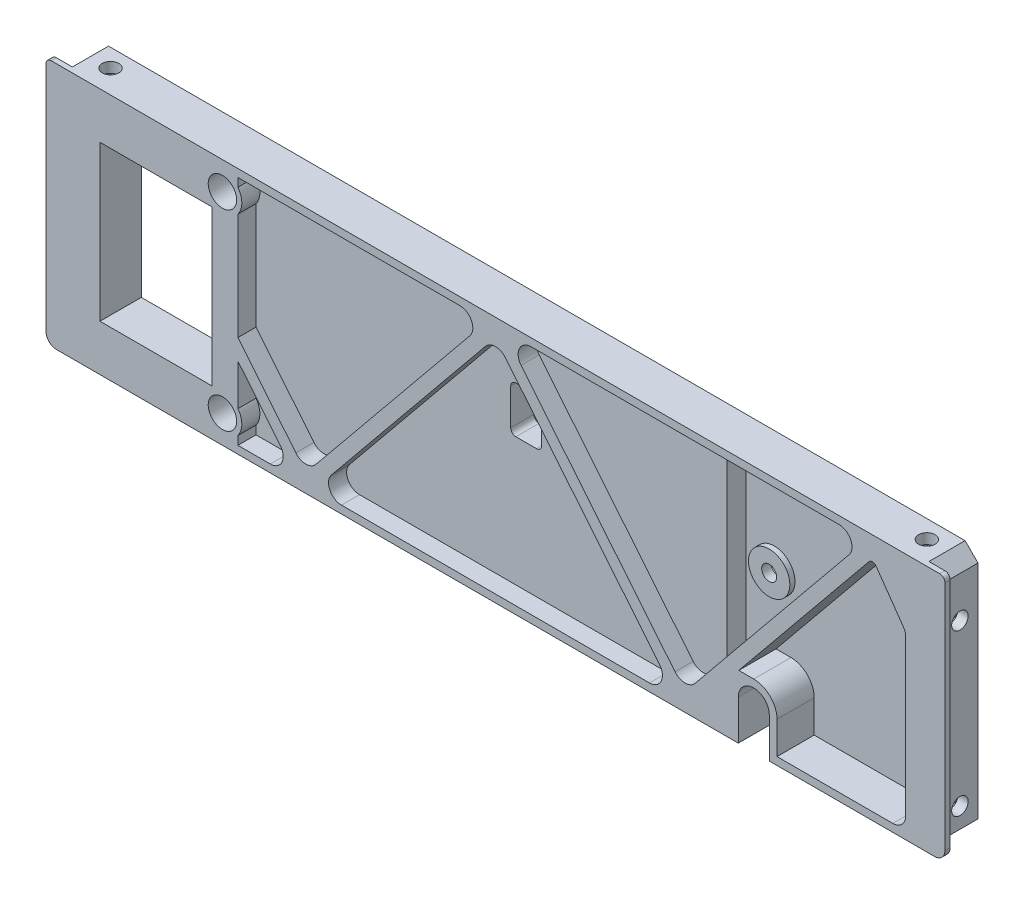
ISO-10303-21;
HEADER;
FILE_DESCRIPTION(('STEP AP214'),'2;1');
FILE_NAME('part.step','',(''),(''),'','','');
FILE_SCHEMA(('AUTOMOTIVE_DESIGN { 1 0 10303 214 1 1 1 1 }'));
ENDSEC;
DATA;
#1=APPLICATION_CONTEXT('core data for automotive mechanical design processes');
#2=APPLICATION_PROTOCOL_DEFINITION('international standard','automotive_design',2000,#1);
#3=PRODUCT_CONTEXT('',#1,'mechanical');
#4=PRODUCT('Part','Part','',(#3));
#5=PRODUCT_RELATED_PRODUCT_CATEGORY('part','',(#4));
#6=PRODUCT_DEFINITION_FORMATION('','',#4);
#7=PRODUCT_DEFINITION_CONTEXT('part definition',#1,'design');
#8=PRODUCT_DEFINITION('design','',#6,#7);
#9=PRODUCT_DEFINITION_SHAPE('','',#8);
#10=(LENGTH_UNIT() NAMED_UNIT(*) SI_UNIT(.MILLI.,.METRE.));
#11=(NAMED_UNIT(*) PLANE_ANGLE_UNIT() SI_UNIT($,.RADIAN.));
#12=(NAMED_UNIT(*) SI_UNIT($,.STERADIAN.) SOLID_ANGLE_UNIT());
#13=UNCERTAINTY_MEASURE_WITH_UNIT(LENGTH_MEASURE(1.E-05),#10,'distance_accuracy_value','');
#14=(GEOMETRIC_REPRESENTATION_CONTEXT(3) GLOBAL_UNCERTAINTY_ASSIGNED_CONTEXT((#13)) GLOBAL_UNIT_ASSIGNED_CONTEXT((#10,
#11,#12)) REPRESENTATION_CONTEXT('',''));
#15=CARTESIAN_POINT('',(0.,0.,0.));
#16=DIRECTION('',(0.,0.,1.));
#17=DIRECTION('',(1.,0.,0.));
#18=AXIS2_PLACEMENT_3D('',#15,#16,#17);
#19=CARTESIAN_POINT('',(79.4,-22.45,-173.025604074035));
#20=DIRECTION('',(0.,-1.,0.));
#21=DIRECTION('',(0.,0.,-1.));
#22=AXIS2_PLACEMENT_3D('',#19,#20,#21);
#23=PLANE('',#22);
#24=DIRECTION('',(-1.,0.,0.));
#25=VECTOR('',#24,1.);
#26=CARTESIAN_POINT('',(79.4,-22.45,-7.20000000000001));
#27=LINE('',#26,#25);
#28=CARTESIAN_POINT('',(76.9,-22.45,-7.20000000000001));
#29=VERTEX_POINT('',#28);
#30=CARTESIAN_POINT('',(54.5,-22.45,-7.2));
#31=VERTEX_POINT('',#30);
#32=EDGE_CURVE('E1922',#29,#31,#27,.T.);
#33=ORIENTED_EDGE('',*,*,#32,.T.);
#34=DIRECTION('',(0.,0.,1.));
#35=VECTOR('',#34,1.);
#36=CARTESIAN_POINT('',(54.5,-22.45,-24.3894780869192));
#37=LINE('',#36,#35);
#38=CARTESIAN_POINT('',(54.5,-22.45,0.));
#39=VERTEX_POINT('',#38);
#40=EDGE_CURVE('E927',#31,#39,#37,.T.);
#41=ORIENTED_EDGE('',*,*,#40,.T.);
#42=DIRECTION('',(1.,0.,0.));
#43=VECTOR('',#42,1.);
#44=CARTESIAN_POINT('',(79.4,-22.45,0.));
#45=LINE('',#44,#43);
#46=CARTESIAN_POINT('',(76.9,-22.45,0.));
#47=VERTEX_POINT('',#46);
#48=EDGE_CURVE('E1913',#39,#47,#45,.T.);
#49=ORIENTED_EDGE('',*,*,#48,.T.);
#50=DIRECTION('',(0.,0.,1.));
#51=VECTOR('',#50,1.);
#52=CARTESIAN_POINT('',(76.9,-22.45,-7.20000000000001));
#53=LINE('',#52,#51);
#54=EDGE_CURVE('E2083',#47,#29,#53,.F.);
#55=ORIENTED_EDGE('',*,*,#54,.T.);
#56=EDGE_LOOP('',(#33,#41,#49,#55));
#57=FACE_BOUND('',#56,.T.);
#58=ADVANCED_FACE('F48',(#57),#23,.F.);
#59=CARTESIAN_POINT('',(85.4,-23.95,183.161794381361));
#60=DIRECTION('',(0.,-1.,0.));
#61=DIRECTION('',(0.,0.,-1.));
#62=AXIS2_PLACEMENT_3D('',#59,#60,#61);
#63=PLANE('',#62);
#64=DIRECTION('',(0.,0.,1.));
#65=VECTOR('',#64,1.);
#66=CARTESIAN_POINT('',(53.,-23.95,-8.));
#67=LINE('',#66,#65);
#68=CARTESIAN_POINT('',(53.,-23.95,-8.));
#69=VERTEX_POINT('',#68);
#70=CARTESIAN_POINT('',(53.,-23.95,0.));
#71=VERTEX_POINT('',#70);
#72=EDGE_CURVE('E962',#69,#71,#67,.T.);
#73=ORIENTED_EDGE('',*,*,#72,.F.);
#74=DIRECTION('',(-1.,0.,0.));
#75=VECTOR('',#74,1.);
#76=CARTESIAN_POINT('',(85.4,-23.95,-8.));
#77=LINE('',#76,#75);
#78=CARTESIAN_POINT('',(82.9,-23.95,-8.));
#79=VERTEX_POINT('',#78);
#80=EDGE_CURVE('E1944',#79,#69,#77,.T.);
#81=ORIENTED_EDGE('',*,*,#80,.F.);
#82=DIRECTION('',(0.,0.,1.));
#83=VECTOR('',#82,1.);
#84=CARTESIAN_POINT('',(82.9,-23.95,183.161794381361));
#85=LINE('',#84,#83);
#86=CARTESIAN_POINT('',(82.9,-23.95,-1.));
#87=VERTEX_POINT('',#86);
#88=EDGE_CURVE('E2000',#79,#87,#85,.T.);
#89=ORIENTED_EDGE('',*,*,#88,.T.);
#90=DIRECTION('',(-1.,0.,0.));
#91=VECTOR('',#90,1.);
#92=CARTESIAN_POINT('',(0.,-23.95,-1.));
#93=LINE('',#92,#91);
#94=CARTESIAN_POINT('',(85.,-23.95,-1.));
#95=VERTEX_POINT('',#94);
#96=EDGE_CURVE('E2033',#95,#87,#93,.T.);
#97=ORIENTED_EDGE('',*,*,#96,.F.);
#98=DIRECTION('',(0.,0.,-1.));
#99=VECTOR('',#98,1.);
#100=CARTESIAN_POINT('',(85.,-23.95,183.161794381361));
#101=LINE('',#100,#99);
#102=CARTESIAN_POINT('',(85.,-23.95,0.));
#103=VERTEX_POINT('',#102);
#104=EDGE_CURVE('E2220',#95,#103,#101,.F.);
#105=ORIENTED_EDGE('',*,*,#104,.T.);
#106=DIRECTION('',(1.,0.,0.));
#107=VECTOR('',#106,1.);
#108=CARTESIAN_POINT('',(87.,-23.95,0.));
#109=LINE('',#108,#107);
#110=EDGE_CURVE('E1545',#71,#103,#109,.T.);
#111=ORIENTED_EDGE('',*,*,#110,.F.);
#112=EDGE_LOOP('',(#73,#81,#89,#97,#105,#111));
#113=FACE_BOUND('',#112,.T.);
#114=ADVANCED_FACE('F2347',(#113),#63,.T.);
#115=CARTESIAN_POINT('',(-49.85,22.45,-60.9513953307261));
#116=DIRECTION('',(1.,0.,0.));
#117=DIRECTION('',(0.,1.,0.));
#118=AXIS2_PLACEMENT_3D('',#115,#116,#117);
#119=PLANE('',#118);
#120=DIRECTION('',(0.,0.,1.));
#121=VECTOR('',#120,1.);
#122=CARTESIAN_POINT('',(-49.85,-16.3,-8.06207189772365));
#123=LINE('',#122,#121);
#124=CARTESIAN_POINT('',(-49.85,-16.3,-3.5));
#125=VERTEX_POINT('',#124);
#126=CARTESIAN_POINT('',(-49.85,-16.3,0.));
#127=VERTEX_POINT('',#126);
#128=EDGE_CURVE('E972',#125,#127,#123,.T.);
#129=ORIENTED_EDGE('',*,*,#128,.F.);
#130=DIRECTION('',(0.,-1.,0.));
#131=VECTOR('',#130,1.);
#132=CARTESIAN_POINT('',(-49.85,22.45,-3.5));
#133=LINE('',#132,#131);
#134=CARTESIAN_POINT('',(-49.85,-8.33700669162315,-3.5));
#135=VERTEX_POINT('',#134);
#136=EDGE_CURVE('E1397',#135,#125,#133,.T.);
#137=ORIENTED_EDGE('',*,*,#136,.F.);
#138=DIRECTION('',(0.,0.,-1.));
#139=VECTOR('',#138,1.);
#140=CARTESIAN_POINT('',(-49.85,-8.33700669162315,156.731719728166));
#141=LINE('',#140,#139);
#142=CARTESIAN_POINT('',(-49.85,-8.33700669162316,0.));
#143=VERTEX_POINT('',#142);
#144=EDGE_CURVE('E2251',#143,#135,#141,.T.);
#145=ORIENTED_EDGE('',*,*,#144,.F.);
#146=DIRECTION('',(0.,1.,0.));
#147=VECTOR('',#146,1.);
#148=CARTESIAN_POINT('',(-49.85,22.45,0.));
#149=LINE('',#148,#147);
#150=EDGE_CURVE('E1520',#127,#143,#149,.T.);
#151=ORIENTED_EDGE('',*,*,#150,.F.);
#152=EDGE_LOOP('',(#129,#137,#145,#151));
#153=FACE_BOUND('',#152,.T.);
#154=ADVANCED_FACE('F2355',(#153),#119,.T.);
#155=DIRECTION('',(0.,0.,1.));
#156=VECTOR('',#155,1.);
#157=CARTESIAN_POINT('',(-49.85,20.8,-8.06207189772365));
#158=LINE('',#157,#156);
#159=CARTESIAN_POINT('',(-49.85,20.8,-3.5));
#160=VERTEX_POINT('',#159);
#161=CARTESIAN_POINT('',(-49.85,20.8,0.));
#162=VERTEX_POINT('',#161);
#163=EDGE_CURVE('E994',#160,#162,#158,.T.);
#164=ORIENTED_EDGE('',*,*,#163,.F.);
#165=CARTESIAN_POINT('',(-49.85,22.45,-3.50000000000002));
#166=VERTEX_POINT('',#165);
#167=EDGE_CURVE('E1391',#166,#160,#133,.T.);
#168=ORIENTED_EDGE('',*,*,#167,.F.);
#169=DIRECTION('',(0.,0.,1.));
#170=VECTOR('',#169,1.);
#171=CARTESIAN_POINT('',(-49.85,22.45,-60.9513953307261));
#172=LINE('',#171,#170);
#173=CARTESIAN_POINT('',(-49.85,22.45,0.));
#174=VERTEX_POINT('',#173);
#175=EDGE_CURVE('E1522',#166,#174,#172,.T.);
#176=ORIENTED_EDGE('',*,*,#175,.T.);
#177=EDGE_CURVE('E1514',#162,#174,#149,.T.);
#178=ORIENTED_EDGE('',*,*,#177,.F.);
#179=EDGE_LOOP('',(#164,#168,#176,#178));
#180=FACE_BOUND('',#179,.T.);
#181=ADVANCED_FACE('F2416',(#180),#119,.T.);
#182=CARTESIAN_POINT('',(0.,0.,-7.2));
#183=DIRECTION('',(0.,0.,1.));
#184=DIRECTION('',(1.,0.,0.));
#185=AXIS2_PLACEMENT_3D('',#182,#183,#184);
#186=PLANE('',#185);
#187=DIRECTION('',(1.,0.,0.));
#188=VECTOR('',#187,1.);
#189=CARTESIAN_POINT('',(79.4,22.45,-7.20000000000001));
#190=LINE('',#189,#188);
#191=CARTESIAN_POINT('',(41.28,22.45,-7.2));
#192=VERTEX_POINT('',#191);
#193=CARTESIAN_POINT('',(66.513264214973,22.45,-7.20000000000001));
#194=VERTEX_POINT('',#193);
#195=EDGE_CURVE('E1918',#192,#194,#190,.T.);
#196=ORIENTED_EDGE('',*,*,#195,.F.);
#197=DIRECTION('',(0.,1.,0.));
#198=VECTOR('',#197,1.);
#199=CARTESIAN_POINT('',(41.28,22.45,-7.2));
#200=LINE('',#199,#198);
#201=CARTESIAN_POINT('',(41.28,-14.8715219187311,-7.20000000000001));
#202=VERTEX_POINT('',#201);
#203=EDGE_CURVE('E1381',#202,#192,#200,.T.);
#204=ORIENTED_EDGE('',*,*,#203,.F.);
#205=DIRECTION('',(-0.632862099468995,-0.774264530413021,0.));
#206=VECTOR('',#205,1.);
#207=CARTESIAN_POINT('',(36.7,-20.4748461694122,-7.2));
#208=LINE('',#207,#206);
#209=CARTESIAN_POINT('',(68.4489255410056,18.3678447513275,-7.2));
#210=VERTEX_POINT('',#209);
#211=EDGE_CURVE('E1549',#210,#202,#208,.T.);
#212=ORIENTED_EDGE('',*,*,#211,.F.);
#213=CARTESIAN_POINT('',(66.513264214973,19.95,-7.20000000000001));
#214=DIRECTION('',(0.,0.,1.));
#215=DIRECTION('',(1.,0.,0.));
#216=AXIS2_PLACEMENT_3D('',#213,#214,#215);
#217=CIRCLE('',#216,2.5);
#218=EDGE_CURVE('E2104',#210,#194,#217,.T.);
#219=ORIENTED_EDGE('',*,*,#218,.T.);
#220=EDGE_LOOP('',(#196,#204,#212,#219));
#221=FACE_BOUND('',#220,.T.);
#222=CARTESIAN_POINT('',(46.78,1.39,-7.2));
#223=DIRECTION('',(0.,0.,1.));
#224=DIRECTION('',(1.,0.,0.));
#225=AXIS2_PLACEMENT_3D('',#222,#223,#224);
#226=CIRCLE('',#225,4.);
#227=CARTESIAN_POINT('',(50.78,1.39,-7.2));
#228=VERTEX_POINT('',#227);
#229=EDGE_CURVE('E1003',#228,#228,#226,.T.);
#230=ORIENTED_EDGE('',*,*,#229,.F.);
#231=EDGE_LOOP('',(#230));
#232=FACE_BOUND('',#231,.T.);
#233=ADVANCED_FACE('F2847',(#221,#232),#186,.T.);
#234=CARTESIAN_POINT('',(-52.8500000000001,18.55,-8.));
#235=DIRECTION('',(0.,0.,1.));
#236=DIRECTION('',(1.,0.,0.));
#237=AXIS2_PLACEMENT_3D('',#234,#235,#236);
#238=CYLINDRICAL_SURFACE('',#237,1.45000000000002);
#239=CARTESIAN_POINT('',(-52.8500000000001,18.55,-8.));
#240=DIRECTION('',(0.,0.,1.));
#241=DIRECTION('',(1.,0.,0.));
#242=AXIS2_PLACEMENT_3D('',#239,#240,#241);
#243=CIRCLE('',#242,1.45000000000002);
#244=CARTESIAN_POINT('',(-51.4,18.55,-8.));
#245=VERTEX_POINT('',#244);
#246=EDGE_CURVE('E1037',#245,#245,#243,.T.);
#247=ORIENTED_EDGE('',*,*,#246,.F.);
#248=EDGE_LOOP('',(#247));
#249=FACE_BOUND('',#248,.T.);
#250=CARTESIAN_POINT('',(-52.8500000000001,18.55,-6.));
#251=DIRECTION('',(0.,0.,1.));
#252=DIRECTION('',(1.,0.,0.));
#253=AXIS2_PLACEMENT_3D('',#250,#251,#252);
#254=CIRCLE('',#253,1.45000000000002);
#255=CARTESIAN_POINT('',(-51.4,18.55,-6.));
#256=VERTEX_POINT('',#255);
#257=EDGE_CURVE('E1041',#256,#256,#254,.F.);
#258=ORIENTED_EDGE('',*,*,#257,.F.);
#259=EDGE_LOOP('',(#258));
#260=FACE_BOUND('',#259,.T.);
#261=ADVANCED_FACE('F3571',(#249,#260),#238,.F.);
#262=CARTESIAN_POINT('',(-52.8500000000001,-18.55,-8.));
#263=DIRECTION('',(0.,0.,1.));
#264=DIRECTION('',(1.,0.,0.));
#265=AXIS2_PLACEMENT_3D('',#262,#263,#264);
#266=CYLINDRICAL_SURFACE('',#265,1.45000000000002);
#267=CARTESIAN_POINT('',(-52.8500000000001,-18.55,-8.));
#268=DIRECTION('',(0.,0.,1.));
#269=DIRECTION('',(1.,0.,0.));
#270=AXIS2_PLACEMENT_3D('',#267,#268,#269);
#271=CIRCLE('',#270,1.45000000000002);
#272=CARTESIAN_POINT('',(-51.4,-18.55,-8.));
#273=VERTEX_POINT('',#272);
#274=EDGE_CURVE('E1033',#273,#273,#271,.T.);
#275=ORIENTED_EDGE('',*,*,#274,.F.);
#276=EDGE_LOOP('',(#275));
#277=FACE_BOUND('',#276,.T.);
#278=CARTESIAN_POINT('',(-52.8500000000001,-18.55,-6.));
#279=DIRECTION('',(0.,0.,1.));
#280=DIRECTION('',(1.,0.,0.));
#281=AXIS2_PLACEMENT_3D('',#278,#279,#280);
#282=CIRCLE('',#281,1.45000000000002);
#283=CARTESIAN_POINT('',(-51.4,-18.55,-6.));
#284=VERTEX_POINT('',#283);
#285=EDGE_CURVE('E1021',#284,#284,#282,.F.);
#286=ORIENTED_EDGE('',*,*,#285,.F.);
#287=EDGE_LOOP('',(#286));
#288=FACE_BOUND('',#287,.T.);
#289=ADVANCED_FACE('F2561',(#277,#288),#266,.F.);
#290=CARTESIAN_POINT('',(0.,0.,-6.4));
#291=DIRECTION('',(0.,0.,1.));
#292=DIRECTION('',(1.,0.,0.));
#293=AXIS2_PLACEMENT_3D('',#290,#291,#292);
#294=PLANE('',#293);
#295=DIRECTION('',(-1.,0.,0.));
#296=VECTOR('',#295,1.);
#297=CARTESIAN_POINT('',(40.78,-11.7,-6.4));
#298=LINE('',#297,#296);
#299=CARTESIAN_POINT('',(40.78,-11.7,-6.4));
#300=VERTEX_POINT('',#299);
#301=CARTESIAN_POINT('',(26.78,-11.7,-6.4));
#302=VERTEX_POINT('',#301);
#303=EDGE_CURVE('E1047',#300,#302,#298,.T.);
#304=ORIENTED_EDGE('',*,*,#303,.F.);
#305=DIRECTION('',(0.,-1.,0.));
#306=VECTOR('',#305,1.);
#307=CARTESIAN_POINT('',(40.78,-0.949999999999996,-6.4));
#308=LINE('',#307,#306);
#309=CARTESIAN_POINT('',(40.78,-22.45,-6.4));
#310=VERTEX_POINT('',#309);
#311=EDGE_CURVE('E1265',#300,#310,#308,.T.);
#312=ORIENTED_EDGE('',*,*,#311,.T.);
#313=DIRECTION('',(-1.,0.,0.));
#314=VECTOR('',#313,1.);
#315=CARTESIAN_POINT('',(40.78,-22.45,-6.4));
#316=LINE('',#315,#314);
#317=CARTESIAN_POINT('',(2.77999999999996,-22.45,-6.4));
#318=VERTEX_POINT('',#317);
#319=EDGE_CURVE('E1261',#310,#318,#316,.T.);
#320=ORIENTED_EDGE('',*,*,#319,.T.);
#321=DIRECTION('',(0.,-1.,0.));
#322=VECTOR('',#321,1.);
#323=CARTESIAN_POINT('',(2.77999999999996,-0.949999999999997,-6.4));
#324=LINE('',#323,#322);
#325=CARTESIAN_POINT('',(2.77999999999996,-0.949999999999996,-6.4));
#326=VERTEX_POINT('',#325);
#327=EDGE_CURVE('E1184',#326,#318,#324,.T.);
#328=ORIENTED_EDGE('',*,*,#327,.F.);
#329=DIRECTION('',(1.,0.,0.));
#330=VECTOR('',#329,1.);
#331=CARTESIAN_POINT('',(40.78,-0.949999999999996,-6.4));
#332=LINE('',#331,#330);
#333=CARTESIAN_POINT('',(26.78,-0.949999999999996,-6.4));
#334=VERTEX_POINT('',#333);
#335=EDGE_CURVE('E1268',#326,#334,#332,.T.);
#336=ORIENTED_EDGE('',*,*,#335,.T.);
#337=DIRECTION('',(0.,1.,0.));
#338=VECTOR('',#337,1.);
#339=CARTESIAN_POINT('',(26.78,-0.949999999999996,-6.4));
#340=LINE('',#339,#338);
#341=EDGE_CURVE('E1042',#302,#334,#340,.T.);
#342=ORIENTED_EDGE('',*,*,#341,.F.);
#343=EDGE_LOOP('',(#304,#312,#320,#328,#336,#342));
#344=FACE_BOUND('',#343,.T.);
#345=ADVANCED_FACE('F2557',(#344),#294,.F.);
#346=DIRECTION('',(0.,1.,0.));
#347=VECTOR('',#346,1.);
#348=CARTESIAN_POINT('',(-4.02000000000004,-0.949999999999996,-6.4));
#349=LINE('',#348,#347);
#350=CARTESIAN_POINT('',(-4.02000000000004,-22.45,-6.4));
#351=VERTEX_POINT('',#350);
#352=CARTESIAN_POINT('',(-4.02000000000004,-0.949999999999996,-6.4));
#353=VERTEX_POINT('',#352);
#354=EDGE_CURVE('E1050',#351,#353,#349,.T.);
#355=ORIENTED_EDGE('',*,*,#354,.F.);
#356=CARTESIAN_POINT('',(-5.22000000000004,-22.45,-6.4));
#357=VERTEX_POINT('',#356);
#358=EDGE_CURVE('E1260',#351,#357,#316,.T.);
#359=ORIENTED_EDGE('',*,*,#358,.T.);
#360=DIRECTION('',(0.,1.,0.));
#361=VECTOR('',#360,1.);
#362=CARTESIAN_POINT('',(-5.22000000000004,-0.949999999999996,-6.4));
#363=LINE('',#362,#361);
#364=CARTESIAN_POINT('',(-5.22000000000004,-0.949999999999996,-6.4));
#365=VERTEX_POINT('',#364);
#366=EDGE_CURVE('E1229',#357,#365,#363,.T.);
#367=ORIENTED_EDGE('',*,*,#366,.T.);
#368=EDGE_CURVE('E1245',#365,#353,#332,.T.);
#369=ORIENTED_EDGE('',*,*,#368,.T.);
#370=EDGE_LOOP('',(#355,#359,#367,#369));
#371=FACE_BOUND('',#370,.T.);
#372=ADVANCED_FACE('F2560',(#371),#294,.F.);
#373=CARTESIAN_POINT('',(0.,0.,-6.4));
#374=DIRECTION('',(0.,0.,1.));
#375=DIRECTION('',(1.,0.,0.));
#376=AXIS2_PLACEMENT_3D('',#373,#374,#375);
#377=PLANE('',#376);
#378=DIRECTION('',(0.,-1.,0.));
#379=VECTOR('',#378,1.);
#380=CARTESIAN_POINT('',(-39.85,-1.45,-6.4));
#381=LINE('',#380,#379);
#382=CARTESIAN_POINT('',(-39.85,-1.45,-6.4));
#383=VERTEX_POINT('',#382);
#384=CARTESIAN_POINT('',(-39.85,-22.45,-6.4));
#385=VERTEX_POINT('',#384);
#386=EDGE_CURVE('E1098',#383,#385,#381,.T.);
#387=ORIENTED_EDGE('',*,*,#386,.F.);
#388=DIRECTION('',(1.,0.,0.));
#389=VECTOR('',#388,1.);
#390=CARTESIAN_POINT('',(-18.22,-1.45,-6.4));
#391=LINE('',#390,#389);
#392=CARTESIAN_POINT('',(-22.22,-1.45,-6.4));
#393=VERTEX_POINT('',#392);
#394=EDGE_CURVE('E1292',#383,#393,#391,.T.);
#395=ORIENTED_EDGE('',*,*,#394,.T.);
#396=DIRECTION('',(0.,1.,0.));
#397=VECTOR('',#396,1.);
#398=CARTESIAN_POINT('',(-22.22,-1.45,-6.4));
#399=LINE('',#398,#397);
#400=CARTESIAN_POINT('',(-22.22,-22.45,-6.4));
#401=VERTEX_POINT('',#400);
#402=EDGE_CURVE('E1122',#401,#393,#399,.T.);
#403=ORIENTED_EDGE('',*,*,#402,.F.);
#404=DIRECTION('',(-1.,0.,0.));
#405=VECTOR('',#404,1.);
#406=CARTESIAN_POINT('',(-18.22,-22.45,-6.4));
#407=LINE('',#406,#405);
#408=EDGE_CURVE('E1276',#401,#385,#407,.T.);
#409=ORIENTED_EDGE('',*,*,#408,.T.);
#410=EDGE_LOOP('',(#387,#395,#403,#409));
#411=FACE_BOUND('',#410,.T.);
#412=ADVANCED_FACE('F2578',(#411),#377,.F.);
#413=CARTESIAN_POINT('',(0.,0.,-6.4));
#414=DIRECTION('',(0.,0.,-1.));
#415=DIRECTION('',(-1.,0.,0.));
#416=AXIS2_PLACEMENT_3D('',#413,#414,#415);
#417=PLANE('',#416);
#418=DIRECTION('',(0.,-1.,0.));
#419=VECTOR('',#418,1.);
#420=CARTESIAN_POINT('',(-5.25000000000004,22.45,-6.4));
#421=LINE('',#420,#419);
#422=CARTESIAN_POINT('',(-5.25000000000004,22.45,-6.4));
#423=VERTEX_POINT('',#422);
#424=CARTESIAN_POINT('',(-5.25000000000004,4.15,-6.4));
#425=VERTEX_POINT('',#424);
#426=EDGE_CURVE('E1159',#423,#425,#421,.T.);
#427=ORIENTED_EDGE('',*,*,#426,.F.);
#428=DIRECTION('',(1.,0.,0.));
#429=VECTOR('',#428,1.);
#430=CARTESIAN_POINT('',(-2.25000000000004,22.45,-6.4));
#431=LINE('',#430,#429);
#432=CARTESIAN_POINT('',(-2.25000000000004,22.45,-6.4));
#433=VERTEX_POINT('',#432);
#434=EDGE_CURVE('E1312',#423,#433,#431,.T.);
#435=ORIENTED_EDGE('',*,*,#434,.T.);
#436=DIRECTION('',(0.,-1.,0.));
#437=VECTOR('',#436,1.);
#438=CARTESIAN_POINT('',(-2.25000000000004,22.45,-6.4));
#439=LINE('',#438,#437);
#440=CARTESIAN_POINT('',(-2.25000000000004,4.15,-6.4));
#441=VERTEX_POINT('',#440);
#442=EDGE_CURVE('E1326',#433,#441,#439,.T.);
#443=ORIENTED_EDGE('',*,*,#442,.T.);
#444=DIRECTION('',(-1.,0.,0.));
#445=VECTOR('',#444,1.);
#446=CARTESIAN_POINT('',(-2.25000000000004,4.15,-6.4));
#447=LINE('',#446,#445);
#448=EDGE_CURVE('E1339',#441,#425,#447,.T.);
#449=ORIENTED_EDGE('',*,*,#448,.T.);
#450=EDGE_LOOP('',(#427,#435,#443,#449));
#451=FACE_BOUND('',#450,.T.);
#452=ADVANCED_FACE('F2484',(#451),#417,.T.);
#453=CARTESIAN_POINT('',(79.4,22.45,-173.025604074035));
#454=DIRECTION('',(0.,1.,0.));
#455=DIRECTION('',(0.,0.,1.));
#456=AXIS2_PLACEMENT_3D('',#453,#454,#455);
#457=PLANE('',#456);
#458=DIRECTION('',(0.,0.,-1.));
#459=VECTOR('',#458,1.);
#460=CARTESIAN_POINT('',(41.28,22.45,-3.5));
#461=LINE('',#460,#459);
#462=CARTESIAN_POINT('',(41.28,22.45,-3.5));
#463=VERTEX_POINT('',#462);
#464=EDGE_CURVE('E1409',#463,#192,#461,.T.);
#465=ORIENTED_EDGE('',*,*,#464,.T.);
#466=ORIENTED_EDGE('',*,*,#195,.T.);
#467=DIRECTION('',(0.,0.,-1.));
#468=VECTOR('',#467,1.);
#469=CARTESIAN_POINT('',(66.513264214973,22.45,0.));
#470=LINE('',#469,#468);
#471=CARTESIAN_POINT('',(66.513264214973,22.45,0.));
#472=VERTEX_POINT('',#471);
#473=EDGE_CURVE('E2112',#194,#472,#470,.F.);
#474=ORIENTED_EDGE('',*,*,#473,.T.);
#475=DIRECTION('',(-1.,0.,0.));
#476=VECTOR('',#475,1.);
#477=CARTESIAN_POINT('',(79.4,22.45,0.));
#478=LINE('',#477,#476);
#479=CARTESIAN_POINT('',(6.88673578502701,22.45,0.));
#480=VERTEX_POINT('',#479);
#481=EDGE_CURVE('E1919',#472,#480,#478,.T.);
#482=ORIENTED_EDGE('',*,*,#481,.T.);
#483=DIRECTION('',(0.,0.,1.));
#484=VECTOR('',#483,1.);
#485=CARTESIAN_POINT('',(6.88673578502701,22.45,-7.20000000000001));
#486=LINE('',#485,#484);
#487=CARTESIAN_POINT('',(6.88673578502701,22.45,-3.5));
#488=VERTEX_POINT('',#487);
#489=EDGE_CURVE('E2108',#480,#488,#486,.F.);
#490=ORIENTED_EDGE('',*,*,#489,.T.);
#491=DIRECTION('',(-1.,0.,0.));
#492=VECTOR('',#491,1.);
#493=CARTESIAN_POINT('',(-49.85,22.45,-3.5));
#494=LINE('',#493,#492);
#495=EDGE_CURVE('E1406',#463,#488,#494,.T.);
#496=ORIENTED_EDGE('',*,*,#495,.F.);
#497=EDGE_LOOP('',(#465,#466,#474,#482,#490,#496));
#498=FACE_BOUND('',#497,.T.);
#499=ADVANCED_FACE('F2372',(#498),#457,.F.);
#500=DIRECTION('',(1.,0.,0.));
#501=VECTOR('',#500,1.);
#502=CARTESIAN_POINT('',(50.,-11.7,-7.2));
#503=LINE('',#502,#501);
#504=CARTESIAN_POINT('',(47.1011836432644,-11.7,-7.2));
#505=VERTEX_POINT('',#504);
#506=CARTESIAN_POINT('',(50.,-11.7,-7.2));
#507=VERTEX_POINT('',#506);
#508=EDGE_CURVE('E907',#505,#507,#503,.T.);
#509=ORIENTED_EDGE('',*,*,#508,.T.);
#510=CARTESIAN_POINT('',(50.,-16.2,-7.2));
#511=DIRECTION('',(0.,0.,1.));
#512=DIRECTION('',(1.,0.,0.));
#513=AXIS2_PLACEMENT_3D('',#510,#511,#512);
#514=CIRCLE('',#513,4.50000000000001);
#515=CARTESIAN_POINT('',(54.5,-16.2,-7.2));
#516=VERTEX_POINT('',#515);
#517=EDGE_CURVE('E902',#507,#516,#514,.F.);
#518=ORIENTED_EDGE('',*,*,#517,.T.);
#519=DIRECTION('',(0.,-1.,0.));
#520=VECTOR('',#519,1.);
#521=CARTESIAN_POINT('',(54.5,-22.45,-7.2));
#522=LINE('',#521,#520);
#523=EDGE_CURVE('E898',#516,#31,#522,.T.);
#524=ORIENTED_EDGE('',*,*,#523,.T.);
#525=ORIENTED_EDGE('',*,*,#32,.F.);
#526=CARTESIAN_POINT('',(76.9,-19.95,-7.20000000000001));
#527=DIRECTION('',(0.,0.,1.));
#528=DIRECTION('',(1.,0.,0.));
#529=AXIS2_PLACEMENT_3D('',#526,#527,#528);
#530=CIRCLE('',#529,2.5);
#531=CARTESIAN_POINT('',(79.4,-19.95,-7.20000000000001));
#532=VERTEX_POINT('',#531);
#533=EDGE_CURVE('E2090',#29,#532,#530,.T.);
#534=ORIENTED_EDGE('',*,*,#533,.T.);
#535=DIRECTION('',(0.,-1.,0.));
#536=VECTOR('',#535,1.);
#537=CARTESIAN_POINT('',(79.4,-22.45,-7.20000000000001));
#538=LINE('',#537,#536);
#539=CARTESIAN_POINT('',(79.4,10.0928649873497,-7.20000000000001));
#540=VERTEX_POINT('',#539);
#541=EDGE_CURVE('E1914',#540,#532,#538,.T.);
#542=ORIENTED_EDGE('',*,*,#541,.F.);
#543=CARTESIAN_POINT('',(76.9,10.0928649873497,-7.2));
#544=DIRECTION('',(0.,0.,1.));
#545=DIRECTION('',(1.,0.,0.));
#546=AXIS2_PLACEMENT_3D('',#543,#544,#545);
#547=CIRCLE('',#546,2.5);
#548=CARTESIAN_POINT('',(78.9478801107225,11.5268060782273,-7.2));
#549=VERTEX_POINT('',#548);
#550=EDGE_CURVE('E2086',#540,#549,#547,.T.);
#551=ORIENTED_EDGE('',*,*,#550,.T.);
#552=DIRECTION('',(0.573576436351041,-0.819152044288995,0.));
#553=VECTOR('',#552,1.);
#554=CARTESIAN_POINT('',(73.4,19.45,-7.2));
#555=LINE('',#554,#553);
#556=CARTESIAN_POINT('',(73.6985849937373,19.023576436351,-7.2));
#557=VERTEX_POINT('',#556);
#558=EDGE_CURVE('E1742',#557,#549,#555,.T.);
#559=ORIENTED_EDGE('',*,*,#558,.F.);
#560=CARTESIAN_POINT('',(72.8794329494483,18.45,-7.2));
#561=DIRECTION('',(0.,0.,1.));
#562=DIRECTION('',(1.,0.,0.));
#563=AXIS2_PLACEMENT_3D('',#560,#561,#562);
#564=CIRCLE('',#563,1.);
#565=CARTESIAN_POINT('',(72.9579643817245,19.4469116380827,-7.20000000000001));
#566=VERTEX_POINT('',#565);
#567=EDGE_CURVE('E2207',#557,#566,#564,.T.);
#568=ORIENTED_EDGE('',*,*,#567,.T.);
#569=CARTESIAN_POINT('',(73.0364958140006,18.45,-7.20000000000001));
#570=DIRECTION('',(0.,0.,1.));
#571=DIRECTION('',(1.,0.,0.));
#572=AXIS2_PLACEMENT_3D('',#569,#570,#571);
#573=CIRCLE('',#572,1.);
#574=CARTESIAN_POINT('',(72.2622312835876,19.082862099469,-7.2));
#575=VERTEX_POINT('',#574);
#576=EDGE_CURVE('E2203',#566,#575,#573,.T.);
#577=ORIENTED_EDGE('',*,*,#576,.T.);
#578=DIRECTION('',(0.632862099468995,0.774264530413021,0.));
#579=VECTOR('',#578,1.);
#580=CARTESIAN_POINT('',(37.474264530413,-23.4778928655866,-7.2));
#581=LINE('',#580,#579);
#582=EDGE_CURVE('E1544',#505,#575,#581,.T.);
#583=ORIENTED_EDGE('',*,*,#582,.F.);
#584=EDGE_LOOP('',(#509,#518,#524,#525,#534,#542,#551,#559,#568,#577,#583));
#585=FACE_BOUND('',#584,.T.);
#586=ADVANCED_FACE('F2651',(#585),#186,.T.);
#587=CARTESIAN_POINT('',(36.7,-20.4748461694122,156.731719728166));
#588=DIRECTION('',(0.774264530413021,-0.632862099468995,0.));
#589=DIRECTION('',(0.632862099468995,0.774264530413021,0.));
#590=AXIS2_PLACEMENT_3D('',#587,#588,#589);
#591=PLANE('',#590);
#592=DIRECTION('',(0.,0.,-1.));
#593=VECTOR('',#592,1.);
#594=CARTESIAN_POINT('',(41.28,-14.8715219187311,156.731719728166));
#595=LINE('',#594,#593);
#596=CARTESIAN_POINT('',(41.28,-14.8715219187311,-3.5));
#597=VERTEX_POINT('',#596);
#598=EDGE_CURVE('E1470',#597,#202,#595,.T.);
#599=ORIENTED_EDGE('',*,*,#598,.F.);
#600=DIRECTION('',(-0.632862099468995,-0.774264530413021,0.));
#601=VECTOR('',#600,1.);
#602=CARTESIAN_POINT('',(36.7,-20.4748461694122,-3.5));
#603=LINE('',#602,#601);
#604=CARTESIAN_POINT('',(38.6356613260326,-18.1066937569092,-3.5));
#605=VERTEX_POINT('',#604);
#606=EDGE_CURVE('E1466',#597,#605,#603,.T.);
#607=ORIENTED_EDGE('',*,*,#606,.T.);
#608=DIRECTION('',(0.,0.,-1.));
#609=VECTOR('',#608,1.);
#610=CARTESIAN_POINT('',(38.6356613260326,-18.1066937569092,0.));
#611=LINE('',#610,#609);
#612=CARTESIAN_POINT('',(38.6356613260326,-18.1066937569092,0.));
#613=VERTEX_POINT('',#612);
#614=EDGE_CURVE('E2097',#605,#613,#611,.F.);
#615=ORIENTED_EDGE('',*,*,#614,.T.);
#616=DIRECTION('',(-0.632862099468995,-0.774264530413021,0.));
#617=VECTOR('',#616,1.);
#618=CARTESIAN_POINT('',(36.7,-20.4748461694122,0.));
#619=LINE('',#618,#617);
#620=CARTESIAN_POINT('',(68.4489255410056,18.3678447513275,0.));
#621=VERTEX_POINT('',#620);
#622=EDGE_CURVE('E1565',#621,#613,#619,.T.);
#623=ORIENTED_EDGE('',*,*,#622,.F.);
#624=DIRECTION('',(0.,0.,-1.));
#625=VECTOR('',#624,1.);
#626=CARTESIAN_POINT('',(68.4489255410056,18.3678447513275,-7.19999999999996));
#627=LINE('',#626,#625);
#628=EDGE_CURVE('E2100',#621,#210,#627,.T.);
#629=ORIENTED_EDGE('',*,*,#628,.T.);
#630=ORIENTED_EDGE('',*,*,#211,.T.);
#631=EDGE_LOOP('',(#599,#607,#615,#623,#629,#630));
#632=FACE_BOUND('',#631,.T.);
#633=ADVANCED_FACE('F2648',(#632),#591,.F.);
#634=CARTESIAN_POINT('',(0.,0.,-1.));
#635=DIRECTION('',(0.,0.,1.));
#636=DIRECTION('',(1.,0.,0.));
#637=AXIS2_PLACEMENT_3D('',#634,#635,#636);
#638=PLANE('',#637);
#639=DIRECTION('',(0.,1.,0.));
#640=VECTOR('',#639,1.);
#641=CARTESIAN_POINT('',(-87.,-25.55,-1.));
#642=LINE('',#641,#640);
#643=CARTESIAN_POINT('',(-87.,-21.95,-1.));
#644=VERTEX_POINT('',#643);
#645=CARTESIAN_POINT('',(-87.,22.95,-1.));
#646=VERTEX_POINT('',#645);
#647=EDGE_CURVE('E1966',#644,#646,#642,.T.);
#648=ORIENTED_EDGE('',*,*,#647,.T.);
#649=CARTESIAN_POINT('',(-86.,22.95,-1.));
#650=DIRECTION('',(0.,0.,1.));
#651=DIRECTION('',(1.,0.,0.));
#652=AXIS2_PLACEMENT_3D('',#649,#650,#651);
#653=CIRCLE('',#652,1.);
#654=CARTESIAN_POINT('',(-86.,23.95,-1.));
#655=VERTEX_POINT('',#654);
#656=EDGE_CURVE('E2278',#646,#655,#653,.F.);
#657=ORIENTED_EDGE('',*,*,#656,.T.);
#658=DIRECTION('',(-1.,0.,0.));
#659=VECTOR('',#658,1.);
#660=CARTESIAN_POINT('',(87.,23.95,-1.));
#661=LINE('',#660,#659);
#662=CARTESIAN_POINT('',(-82.9,23.95,-1.));
#663=VERTEX_POINT('',#662);
#664=EDGE_CURVE('E1531',#663,#655,#661,.T.);
#665=ORIENTED_EDGE('',*,*,#664,.F.);
#666=DIRECTION('',(0.707106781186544,0.707106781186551,0.));
#667=VECTOR('',#666,1.);
#668=CARTESIAN_POINT('',(-53.4250000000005,53.4249999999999,-1.));
#669=LINE('',#668,#667);
#670=CARTESIAN_POINT('',(-85.4,21.45,-1.));
#671=VERTEX_POINT('',#670);
#672=EDGE_CURVE('E2030',#663,#671,#669,.F.);
#673=ORIENTED_EDGE('',*,*,#672,.T.);
#674=DIRECTION('',(0.,1.,0.));
#675=VECTOR('',#674,1.);
#676=CARTESIAN_POINT('',(-85.4,-23.95,-1.));
#677=LINE('',#676,#675);
#678=CARTESIAN_POINT('',(-85.4,-21.45,-1.));
#679=VERTEX_POINT('',#678);
#680=EDGE_CURVE('E1959',#679,#671,#677,.T.);
#681=ORIENTED_EDGE('',*,*,#680,.F.);
#682=DIRECTION('',(-0.707106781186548,0.707106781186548,0.));
#683=VECTOR('',#682,1.);
#684=CARTESIAN_POINT('',(-53.425,-53.425,-1.));
#685=LINE('',#684,#683);
#686=CARTESIAN_POINT('',(-82.8999999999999,-23.95,-1.));
#687=VERTEX_POINT('',#686);
#688=EDGE_CURVE('E2026',#679,#687,#685,.F.);
#689=ORIENTED_EDGE('',*,*,#688,.T.);
#690=DIRECTION('',(1.,0.,0.));
#691=VECTOR('',#690,1.);
#692=CARTESIAN_POINT('',(87.,-23.95,-1.));
#693=LINE('',#692,#691);
#694=CARTESIAN_POINT('',(-85.,-23.95,-1.));
#695=VERTEX_POINT('',#694);
#696=EDGE_CURVE('E1546',#695,#687,#693,.T.);
#697=ORIENTED_EDGE('',*,*,#696,.F.);
#698=CARTESIAN_POINT('',(-85.,-21.95,-1.));
#699=DIRECTION('',(0.,0.,1.));
#700=DIRECTION('',(1.,0.,0.));
#701=AXIS2_PLACEMENT_3D('',#698,#699,#700);
#702=CIRCLE('',#701,2.);
#703=EDGE_CURVE('E2234',#695,#644,#702,.F.);
#704=ORIENTED_EDGE('',*,*,#703,.T.);
#705=EDGE_LOOP('',(#648,#657,#665,#673,#681,#689,#697,#704));
#706=FACE_BOUND('',#705,.T.);
#707=ADVANCED_FACE('F2369',(#706),#638,.F.);
#708=ORIENTED_EDGE('',*,*,#175,.F.);
#709=CARTESIAN_POINT('',(-6.88673578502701,22.45,-3.5));
#710=VERTEX_POINT('',#709);
#711=EDGE_CURVE('E1405',#710,#166,#494,.T.);
#712=ORIENTED_EDGE('',*,*,#711,.F.);
#713=DIRECTION('',(0.,0.,-1.));
#714=VECTOR('',#713,1.);
#715=CARTESIAN_POINT('',(-6.88673578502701,22.45,0.));
#716=LINE('',#715,#714);
#717=CARTESIAN_POINT('',(-6.88673578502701,22.45,0.));
#718=VERTEX_POINT('',#717);
#719=EDGE_CURVE('E2150',#710,#718,#716,.F.);
#720=ORIENTED_EDGE('',*,*,#719,.T.);
#721=EDGE_CURVE('E1931',#718,#174,#478,.T.);
#722=ORIENTED_EDGE('',*,*,#721,.T.);
#723=EDGE_LOOP('',(#708,#712,#720,#722));
#724=FACE_BOUND('',#723,.T.);
#725=ADVANCED_FACE('F2364',(#724),#457,.F.);
#726=DIRECTION('',(0.,0.,1.));
#727=VECTOR('',#726,1.);
#728=CARTESIAN_POINT('',(-43.586735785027,-22.45,-7.20000000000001));
#729=LINE('',#728,#727);
#730=CARTESIAN_POINT('',(-43.586735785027,-22.45,0.));
#731=VERTEX_POINT('',#730);
#732=CARTESIAN_POINT('',(-43.586735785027,-22.45,-3.5));
#733=VERTEX_POINT('',#732);
#734=EDGE_CURVE('E2157',#731,#733,#729,.F.);
#735=ORIENTED_EDGE('',*,*,#734,.T.);
#736=DIRECTION('',(1.,0.,0.));
#737=VECTOR('',#736,1.);
#738=CARTESIAN_POINT('',(-49.85,-22.45,-3.5));
#739=LINE('',#738,#737);
#740=CARTESIAN_POINT('',(-49.85,-22.45,-3.5));
#741=VERTEX_POINT('',#740);
#742=EDGE_CURVE('E1398',#741,#733,#739,.T.);
#743=ORIENTED_EDGE('',*,*,#742,.F.);
#744=DIRECTION('',(0.,0.,1.));
#745=VECTOR('',#744,1.);
#746=CARTESIAN_POINT('',(-49.85,-22.45,-60.9513953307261));
#747=LINE('',#746,#745);
#748=CARTESIAN_POINT('',(-49.85,-22.45,0.));
#749=VERTEX_POINT('',#748);
#750=EDGE_CURVE('E1519',#741,#749,#747,.T.);
#751=ORIENTED_EDGE('',*,*,#750,.T.);
#752=EDGE_CURVE('E1923',#749,#731,#45,.T.);
#753=ORIENTED_EDGE('',*,*,#752,.T.);
#754=EDGE_LOOP('',(#735,#743,#751,#753));
#755=FACE_BOUND('',#754,.T.);
#756=ADVANCED_FACE('F2351',(#755),#23,.F.);
#757=DIRECTION('',(0.,0.,1.));
#758=VECTOR('',#757,1.);
#759=CARTESIAN_POINT('',(29.813264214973,-22.45,-7.20000000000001));
#760=LINE('',#759,#758);
#761=CARTESIAN_POINT('',(29.813264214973,-22.45,0.));
#762=VERTEX_POINT('',#761);
#763=CARTESIAN_POINT('',(29.813264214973,-22.45,-3.5));
#764=VERTEX_POINT('',#763);
#765=EDGE_CURVE('E2132',#762,#764,#760,.F.);
#766=ORIENTED_EDGE('',*,*,#765,.T.);
#767=CARTESIAN_POINT('',(-29.813264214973,-22.45,-3.5));
#768=VERTEX_POINT('',#767);
#769=EDGE_CURVE('E1394',#768,#764,#739,.T.);
#770=ORIENTED_EDGE('',*,*,#769,.F.);
#771=DIRECTION('',(0.,0.,-1.));
#772=VECTOR('',#771,1.);
#773=CARTESIAN_POINT('',(-29.813264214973,-22.45,0.));
#774=LINE('',#773,#772);
#775=CARTESIAN_POINT('',(-29.813264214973,-22.45,0.));
#776=VERTEX_POINT('',#775);
#777=EDGE_CURVE('E2129',#768,#776,#774,.F.);
#778=ORIENTED_EDGE('',*,*,#777,.T.);
#779=EDGE_CURVE('E1927',#776,#762,#45,.T.);
#780=ORIENTED_EDGE('',*,*,#779,.T.);
#781=EDGE_LOOP('',(#766,#770,#778,#780));
#782=FACE_BOUND('',#781,.T.);
#783=ADVANCED_FACE('F2350',(#782),#23,.F.);
#784=CARTESIAN_POINT('',(0.,0.,-8.));
#785=DIRECTION('',(0.,0.,1.));
#786=DIRECTION('',(1.,0.,0.));
#787=AXIS2_PLACEMENT_3D('',#784,#785,#786);
#788=PLANE('',#787);
#789=DIRECTION('',(1.,0.,0.));
#790=VECTOR('',#789,1.);
#791=CARTESIAN_POINT('',(0.449999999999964,11.39,-8.));
#792=LINE('',#791,#790);
#793=CARTESIAN_POINT('',(0.449999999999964,11.39,-8.));
#794=VERTEX_POINT('',#793);
#795=CARTESIAN_POINT('',(4.44999999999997,11.39,-8.));
#796=VERTEX_POINT('',#795);
#797=EDGE_CURVE('E846',#794,#796,#792,.T.);
#798=ORIENTED_EDGE('',*,*,#797,.F.);
#799=CARTESIAN_POINT('',(0.449999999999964,10.39,-8.));
#800=DIRECTION('',(0.,0.,-1.));
#801=DIRECTION('',(-1.,0.,0.));
#802=AXIS2_PLACEMENT_3D('',#799,#800,#801);
#803=CIRCLE('',#802,1.);
#804=CARTESIAN_POINT('',(-0.550000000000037,10.39,-8.));
#805=VERTEX_POINT('',#804);
#806=EDGE_CURVE('E64',#805,#794,#803,.T.);
#807=ORIENTED_EDGE('',*,*,#806,.F.);
#808=DIRECTION('',(0.,1.,0.));
#809=VECTOR('',#808,1.);
#810=CARTESIAN_POINT('',(-0.550000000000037,3.39,-8.));
#811=LINE('',#810,#809);
#812=CARTESIAN_POINT('',(-0.550000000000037,3.39,-8.));
#813=VERTEX_POINT('',#812);
#814=EDGE_CURVE('E874',#813,#805,#811,.T.);
#815=ORIENTED_EDGE('',*,*,#814,.F.);
#816=CARTESIAN_POINT('',(0.449999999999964,3.39,-8.));
#817=DIRECTION('',(0.,0.,-1.));
#818=DIRECTION('',(-1.,0.,0.));
#819=AXIS2_PLACEMENT_3D('',#816,#817,#818);
#820=CIRCLE('',#819,1.);
#821=CARTESIAN_POINT('',(0.449999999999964,2.39,-8.));
#822=VERTEX_POINT('',#821);
#823=EDGE_CURVE('E870',#822,#813,#820,.T.);
#824=ORIENTED_EDGE('',*,*,#823,.F.);
#825=DIRECTION('',(-1.,0.,0.));
#826=VECTOR('',#825,1.);
#827=CARTESIAN_POINT('',(4.44999999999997,2.39,-8.));
#828=LINE('',#827,#826);
#829=CARTESIAN_POINT('',(4.44999999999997,2.39,-8.));
#830=VERTEX_POINT('',#829);
#831=EDGE_CURVE('E866',#830,#822,#828,.T.);
#832=ORIENTED_EDGE('',*,*,#831,.F.);
#833=CARTESIAN_POINT('',(4.44999999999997,3.39,-8.));
#834=DIRECTION('',(0.,0.,-1.));
#835=DIRECTION('',(-1.,0.,0.));
#836=AXIS2_PLACEMENT_3D('',#833,#834,#835);
#837=CIRCLE('',#836,1.);
#838=CARTESIAN_POINT('',(5.44999999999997,3.39,-8.));
#839=VERTEX_POINT('',#838);
#840=EDGE_CURVE('E859',#839,#830,#837,.T.);
#841=ORIENTED_EDGE('',*,*,#840,.F.);
#842=DIRECTION('',(0.,-1.,0.));
#843=VECTOR('',#842,1.);
#844=CARTESIAN_POINT('',(5.44999999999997,10.39,-8.));
#845=LINE('',#844,#843);
#846=CARTESIAN_POINT('',(5.44999999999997,10.39,-8.));
#847=VERTEX_POINT('',#846);
#848=EDGE_CURVE('E855',#847,#839,#845,.T.);
#849=ORIENTED_EDGE('',*,*,#848,.F.);
#850=CARTESIAN_POINT('',(4.44999999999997,10.39,-8.));
#851=DIRECTION('',(0.,0.,-1.));
#852=DIRECTION('',(-1.,0.,0.));
#853=AXIS2_PLACEMENT_3D('',#850,#851,#852);
#854=CIRCLE('',#853,1.);
#855=EDGE_CURVE('E836',#796,#847,#854,.T.);
#856=ORIENTED_EDGE('',*,*,#855,.F.);
#857=EDGE_LOOP('',(#798,#807,#815,#824,#832,#841,#849,#856));
#858=FACE_BOUND('',#857,.T.);
#859=CARTESIAN_POINT('',(46.78,1.39,-8.));
#860=DIRECTION('',(0.,0.,1.));
#861=DIRECTION('',(1.,0.,0.));
#862=AXIS2_PLACEMENT_3D('',#859,#860,#861);
#863=CIRCLE('',#862,1.45000000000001);
#864=CARTESIAN_POINT('',(48.23,1.39,-8.));
#865=VERTEX_POINT('',#864);
#866=EDGE_CURVE('E1028',#865,#865,#863,.T.);
#867=ORIENTED_EDGE('',*,*,#866,.T.);
#868=EDGE_LOOP('',(#867));
#869=FACE_BOUND('',#868,.T.);
#870=ORIENTED_EDGE('',*,*,#274,.T.);
#871=EDGE_LOOP('',(#870));
#872=FACE_BOUND('',#871,.T.);
#873=ORIENTED_EDGE('',*,*,#246,.T.);
#874=EDGE_LOOP('',(#873));
#875=FACE_BOUND('',#874,.T.);
#876=DIRECTION('',(-1.,0.,0.));
#877=VECTOR('',#876,1.);
#878=CARTESIAN_POINT('',(-2.25000000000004,4.15,-8.));
#879=LINE('',#878,#877);
#880=CARTESIAN_POINT('',(-2.25000000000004,4.15,-8.));
#881=VERTEX_POINT('',#880);
#882=CARTESIAN_POINT('',(-46.35,4.15,-8.));
#883=VERTEX_POINT('',#882);
#884=EDGE_CURVE('E1330',#881,#883,#879,.T.);
#885=ORIENTED_EDGE('',*,*,#884,.F.);
#886=DIRECTION('',(0.,-1.,0.));
#887=VECTOR('',#886,1.);
#888=CARTESIAN_POINT('',(-2.25000000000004,22.45,-8.));
#889=LINE('',#888,#887);
#890=CARTESIAN_POINT('',(-2.25000000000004,22.45,-8.));
#891=VERTEX_POINT('',#890);
#892=EDGE_CURVE('E1286',#891,#881,#889,.T.);
#893=ORIENTED_EDGE('',*,*,#892,.F.);
#894=DIRECTION('',(1.,0.,0.));
#895=VECTOR('',#894,1.);
#896=CARTESIAN_POINT('',(-2.25000000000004,22.45,-8.));
#897=LINE('',#896,#895);
#898=CARTESIAN_POINT('',(-46.35,22.45,-8.));
#899=VERTEX_POINT('',#898);
#900=EDGE_CURVE('E1321',#899,#891,#897,.T.);
#901=ORIENTED_EDGE('',*,*,#900,.F.);
#902=DIRECTION('',(0.,1.,0.));
#903=VECTOR('',#902,1.);
#904=CARTESIAN_POINT('',(-46.35,22.45,-8.));
#905=LINE('',#904,#903);
#906=EDGE_CURVE('E1325',#883,#899,#905,.T.);
#907=ORIENTED_EDGE('',*,*,#906,.F.);
#908=EDGE_LOOP('',(#885,#893,#901,#907));
#909=FACE_BOUND('',#908,.T.);
#910=DIRECTION('',(0.,-1.,0.));
#911=VECTOR('',#910,1.);
#912=CARTESIAN_POINT('',(-18.22,-1.45,-8.));
#913=LINE('',#912,#911);
#914=CARTESIAN_POINT('',(-18.22,-1.45,-8.));
#915=VERTEX_POINT('',#914);
#916=CARTESIAN_POINT('',(-18.22,-22.45,-8.));
#917=VERTEX_POINT('',#916);
#918=EDGE_CURVE('E1296',#915,#917,#913,.T.);
#919=ORIENTED_EDGE('',*,*,#918,.F.);
#920=DIRECTION('',(1.,0.,0.));
#921=VECTOR('',#920,1.);
#922=CARTESIAN_POINT('',(-18.22,-1.45,-8.));
#923=LINE('',#922,#921);
#924=CARTESIAN_POINT('',(-46.35,-1.45,-8.));
#925=VERTEX_POINT('',#924);
#926=EDGE_CURVE('E1239',#925,#915,#923,.T.);
#927=ORIENTED_EDGE('',*,*,#926,.F.);
#928=DIRECTION('',(0.,1.,0.));
#929=VECTOR('',#928,1.);
#930=CARTESIAN_POINT('',(-46.35,-1.45,-8.));
#931=LINE('',#930,#929);
#932=CARTESIAN_POINT('',(-46.35,-22.45,-8.));
#933=VERTEX_POINT('',#932);
#934=EDGE_CURVE('E1287',#933,#925,#931,.T.);
#935=ORIENTED_EDGE('',*,*,#934,.F.);
#936=DIRECTION('',(-1.,0.,0.));
#937=VECTOR('',#936,1.);
#938=CARTESIAN_POINT('',(-18.22,-22.45,-8.));
#939=LINE('',#938,#937);
#940=EDGE_CURVE('E1291',#917,#933,#939,.T.);
#941=ORIENTED_EDGE('',*,*,#940,.F.);
#942=EDGE_LOOP('',(#919,#927,#935,#941));
#943=FACE_BOUND('',#942,.T.);
#944=DIRECTION('',(0.,-1.,0.));
#945=VECTOR('',#944,1.);
#946=CARTESIAN_POINT('',(40.78,-0.949999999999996,-8.));
#947=LINE('',#946,#945);
#948=CARTESIAN_POINT('',(40.78,-0.949999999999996,-8.));
#949=VERTEX_POINT('',#948);
#950=CARTESIAN_POINT('',(40.78,-22.45,-8.));
#951=VERTEX_POINT('',#950);
#952=EDGE_CURVE('E1249',#949,#951,#947,.T.);
#953=ORIENTED_EDGE('',*,*,#952,.F.);
#954=DIRECTION('',(1.,0.,0.));
#955=VECTOR('',#954,1.);
#956=CARTESIAN_POINT('',(40.78,-0.949999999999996,-8.));
#957=LINE('',#956,#955);
#958=CARTESIAN_POINT('',(-5.22000000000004,-0.949999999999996,-8.));
#959=VERTEX_POINT('',#958);
#960=EDGE_CURVE('E1253',#959,#949,#957,.T.);
#961=ORIENTED_EDGE('',*,*,#960,.F.);
#962=DIRECTION('',(0.,1.,0.));
#963=VECTOR('',#962,1.);
#964=CARTESIAN_POINT('',(-5.22000000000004,-0.949999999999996,-8.));
#965=LINE('',#964,#963);
#966=CARTESIAN_POINT('',(-5.22000000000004,-22.45,-8.));
#967=VERTEX_POINT('',#966);
#968=EDGE_CURVE('E1240',#967,#959,#965,.T.);
#969=ORIENTED_EDGE('',*,*,#968,.F.);
#970=DIRECTION('',(-1.,0.,0.));
#971=VECTOR('',#970,1.);
#972=CARTESIAN_POINT('',(40.78,-22.45,-8.));
#973=LINE('',#972,#971);
#974=EDGE_CURVE('E1244',#951,#967,#973,.T.);
#975=ORIENTED_EDGE('',*,*,#974,.F.);
#976=EDGE_LOOP('',(#953,#961,#969,#975));
#977=FACE_BOUND('',#976,.T.);
#978=DIRECTION('',(0.,-1.,0.));
#979=VECTOR('',#978,1.);
#980=CARTESIAN_POINT('',(40.95,22.45,-8.));
#981=LINE('',#980,#979);
#982=CARTESIAN_POINT('',(40.95,22.45,-8.));
#983=VERTEX_POINT('',#982);
#984=CARTESIAN_POINT('',(40.95,3.73,-8.));
#985=VERTEX_POINT('',#984);
#986=EDGE_CURVE('E1367',#983,#985,#981,.T.);
#987=ORIENTED_EDGE('',*,*,#986,.F.);
#988=DIRECTION('',(1.,0.,0.));
#989=VECTOR('',#988,1.);
#990=CARTESIAN_POINT('',(40.95,22.45,-8.));
#991=LINE('',#990,#989);
#992=CARTESIAN_POINT('',(7.24999999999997,22.45,-8.));
#993=VERTEX_POINT('',#992);
#994=EDGE_CURVE('E1256',#993,#983,#991,.T.);
#995=ORIENTED_EDGE('',*,*,#994,.F.);
#996=DIRECTION('',(0.,1.,0.));
#997=VECTOR('',#996,1.);
#998=CARTESIAN_POINT('',(7.24999999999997,22.45,-8.));
#999=LINE('',#998,#997);
#1000=CARTESIAN_POINT('',(7.24999999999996,3.73,-8.));
#1001=VERTEX_POINT('',#1000);
#1002=EDGE_CURVE('E1352',#1001,#993,#999,.T.);
#1003=ORIENTED_EDGE('',*,*,#1002,.F.);
#1004=DIRECTION('',(-1.,0.,0.));
#1005=VECTOR('',#1004,1.);
#1006=CARTESIAN_POINT('',(40.95,3.73,-8.));
#1007=LINE('',#1006,#1005);
#1008=EDGE_CURVE('E1371',#985,#1001,#1007,.T.);
#1009=ORIENTED_EDGE('',*,*,#1008,.F.);
#1010=EDGE_LOOP('',(#987,#995,#1003,#1009));
#1011=FACE_BOUND('',#1010,.T.);
#1012=DIRECTION('',(0.,-1.,0.));
#1013=VECTOR('',#1012,1.);
#1014=CARTESIAN_POINT('',(-54.85,15.,-8.));
#1015=LINE('',#1014,#1013);
#1016=CARTESIAN_POINT('',(-54.85,15.,-8.));
#1017=VERTEX_POINT('',#1016);
#1018=CARTESIAN_POINT('',(-54.85,-15.,-8.));
#1019=VERTEX_POINT('',#1018);
#1020=EDGE_CURVE('E1478',#1017,#1019,#1015,.T.);
#1021=ORIENTED_EDGE('',*,*,#1020,.F.);
#1022=DIRECTION('',(1.,0.,0.));
#1023=VECTOR('',#1022,1.);
#1024=CARTESIAN_POINT('',(-54.85,15.,-8.));
#1025=LINE('',#1024,#1023);
#1026=CARTESIAN_POINT('',(-76.55,15.,-8.));
#1027=VERTEX_POINT('',#1026);
#1028=EDGE_CURVE('E1482',#1027,#1017,#1025,.T.);
#1029=ORIENTED_EDGE('',*,*,#1028,.F.);
#1030=DIRECTION('',(0.,1.,0.));
#1031=VECTOR('',#1030,1.);
#1032=CARTESIAN_POINT('',(-76.55,15.,-8.));
#1033=LINE('',#1032,#1031);
#1034=CARTESIAN_POINT('',(-76.5500000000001,-15.,-8.));
#1035=VERTEX_POINT('',#1034);
#1036=EDGE_CURVE('E1485',#1035,#1027,#1033,.T.);
#1037=ORIENTED_EDGE('',*,*,#1036,.F.);
#1038=DIRECTION('',(-1.,0.,0.));
#1039=VECTOR('',#1038,1.);
#1040=CARTESIAN_POINT('',(-54.85,-15.,-8.));
#1041=LINE('',#1040,#1039);
#1042=EDGE_CURVE('E1474',#1019,#1035,#1041,.T.);
#1043=ORIENTED_EDGE('',*,*,#1042,.F.);
#1044=EDGE_LOOP('',(#1021,#1029,#1037,#1043));
#1045=FACE_BOUND('',#1044,.T.);
#1046=DIRECTION('',(0.,-1.,0.));
#1047=VECTOR('',#1046,1.);
#1048=CARTESIAN_POINT('',(81.6,16.2999999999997,-8.));
#1049=LINE('',#1048,#1047);
#1050=CARTESIAN_POINT('',(81.6,16.2999999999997,-8.));
#1051=VERTEX_POINT('',#1050);
#1052=CARTESIAN_POINT('',(81.6,10.7999999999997,-8.));
#1053=VERTEX_POINT('',#1052);
#1054=EDGE_CURVE('E1630',#1051,#1053,#1049,.T.);
#1055=ORIENTED_EDGE('',*,*,#1054,.T.);
#1056=DIRECTION('',(1.,0.,0.));
#1057=VECTOR('',#1056,1.);
#1058=CARTESIAN_POINT('',(81.6,10.7999999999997,-8.));
#1059=LINE('',#1058,#1057);
#1060=CARTESIAN_POINT('',(83.4,10.7999999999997,-8.));
#1061=VERTEX_POINT('',#1060);
#1062=EDGE_CURVE('E1659',#1053,#1061,#1059,.T.);
#1063=ORIENTED_EDGE('',*,*,#1062,.T.);
#1064=DIRECTION('',(0.,-1.,0.));
#1065=VECTOR('',#1064,1.);
#1066=CARTESIAN_POINT('',(83.4,16.2999999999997,-8.));
#1067=LINE('',#1066,#1065);
#1068=CARTESIAN_POINT('',(83.4,16.2999999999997,-8.));
#1069=VERTEX_POINT('',#1068);
#1070=EDGE_CURVE('E1645',#1069,#1061,#1067,.T.);
#1071=ORIENTED_EDGE('',*,*,#1070,.F.);
#1072=DIRECTION('',(1.,0.,0.));
#1073=VECTOR('',#1072,1.);
#1074=CARTESIAN_POINT('',(81.6,16.2999999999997,-8.));
#1075=LINE('',#1074,#1073);
#1076=EDGE_CURVE('E1644',#1051,#1069,#1075,.T.);
#1077=ORIENTED_EDGE('',*,*,#1076,.F.);
#1078=EDGE_LOOP('',(#1055,#1063,#1071,#1077));
#1079=FACE_BOUND('',#1078,.T.);
#1080=DIRECTION('',(-1.,0.,0.));
#1081=VECTOR('',#1080,1.);
#1082=CARTESIAN_POINT('',(-81.7500000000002,20.15,-8.));
#1083=LINE('',#1082,#1081);
#1084=CARTESIAN_POINT('',(-76.2500000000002,20.15,-8.));
#1085=VERTEX_POINT('',#1084);
#1086=CARTESIAN_POINT('',(-81.7500000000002,20.15,-8.));
#1087=VERTEX_POINT('',#1086);
#1088=EDGE_CURVE('E1762',#1085,#1087,#1083,.T.);
#1089=ORIENTED_EDGE('',*,*,#1088,.F.);
#1090=DIRECTION('',(0.,1.,0.));
#1091=VECTOR('',#1090,1.);
#1092=CARTESIAN_POINT('',(-76.2500000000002,20.15,-8.));
#1093=LINE('',#1092,#1091);
#1094=CARTESIAN_POINT('',(-76.2500000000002,21.95,-8.));
#1095=VERTEX_POINT('',#1094);
#1096=EDGE_CURVE('E1785',#1085,#1095,#1093,.T.);
#1097=ORIENTED_EDGE('',*,*,#1096,.T.);
#1098=DIRECTION('',(-1.,0.,0.));
#1099=VECTOR('',#1098,1.);
#1100=CARTESIAN_POINT('',(-81.7500000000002,21.95,-8.));
#1101=LINE('',#1100,#1099);
#1102=CARTESIAN_POINT('',(-81.7500000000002,21.95,-8.));
#1103=VERTEX_POINT('',#1102);
#1104=EDGE_CURVE('E1754',#1095,#1103,#1101,.T.);
#1105=ORIENTED_EDGE('',*,*,#1104,.T.);
#1106=DIRECTION('',(0.,1.,0.));
#1107=VECTOR('',#1106,1.);
#1108=CARTESIAN_POINT('',(-81.7500000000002,20.15,-8.));
#1109=LINE('',#1108,#1107);
#1110=EDGE_CURVE('E1780',#1087,#1103,#1109,.T.);
#1111=ORIENTED_EDGE('',*,*,#1110,.F.);
#1112=EDGE_LOOP('',(#1089,#1097,#1105,#1111));
#1113=FACE_BOUND('',#1112,.T.);
#1114=DIRECTION('',(0.,-1.,0.));
#1115=VECTOR('',#1114,1.);
#1116=CARTESIAN_POINT('',(-81.6,-14.8000000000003,-8.));
#1117=LINE('',#1116,#1115);
#1118=CARTESIAN_POINT('',(-81.6,-14.8000000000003,-8.));
#1119=VERTEX_POINT('',#1118);
#1120=CARTESIAN_POINT('',(-81.6,-20.3000000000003,-8.));
#1121=VERTEX_POINT('',#1120);
#1122=EDGE_CURVE('E1863',#1119,#1121,#1117,.T.);
#1123=ORIENTED_EDGE('',*,*,#1122,.F.);
#1124=DIRECTION('',(-1.,0.,0.));
#1125=VECTOR('',#1124,1.);
#1126=CARTESIAN_POINT('',(-81.6,-14.8000000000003,-8.));
#1127=LINE('',#1126,#1125);
#1128=CARTESIAN_POINT('',(-83.4,-14.8000000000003,-8.));
#1129=VERTEX_POINT('',#1128);
#1130=EDGE_CURVE('E1853',#1119,#1129,#1127,.T.);
#1131=ORIENTED_EDGE('',*,*,#1130,.T.);
#1132=DIRECTION('',(0.,-1.,0.));
#1133=VECTOR('',#1132,1.);
#1134=CARTESIAN_POINT('',(-83.4,-14.8000000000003,-8.));
#1135=LINE('',#1134,#1133);
#1136=CARTESIAN_POINT('',(-83.4,-20.3000000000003,-8.));
#1137=VERTEX_POINT('',#1136);
#1138=EDGE_CURVE('E1817',#1129,#1137,#1135,.T.);
#1139=ORIENTED_EDGE('',*,*,#1138,.T.);
#1140=DIRECTION('',(-1.,0.,0.));
#1141=VECTOR('',#1140,1.);
#1142=CARTESIAN_POINT('',(-81.6,-20.3000000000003,-8.));
#1143=LINE('',#1142,#1141);
#1144=EDGE_CURVE('E1842',#1121,#1137,#1143,.T.);
#1145=ORIENTED_EDGE('',*,*,#1144,.F.);
#1146=EDGE_LOOP('',(#1123,#1131,#1139,#1145));
#1147=FACE_BOUND('',#1146,.T.);
#1148=ORIENTED_EDGE('',*,*,#80,.T.);
#1149=DIRECTION('',(0.,1.,0.));
#1150=VECTOR('',#1149,1.);
#1151=CARTESIAN_POINT('',(53.,-16.2,-8.));
#1152=LINE('',#1151,#1150);
#1153=CARTESIAN_POINT('',(53.,-16.2,-8.));
#1154=VERTEX_POINT('',#1153);
#1155=EDGE_CURVE('E952',#69,#1154,#1152,.T.);
#1156=ORIENTED_EDGE('',*,*,#1155,.T.);
#1157=CARTESIAN_POINT('',(50.,-16.2,-8.));
#1158=DIRECTION('',(0.,0.,1.));
#1159=DIRECTION('',(-1.,0.,0.));
#1160=AXIS2_PLACEMENT_3D('',#1157,#1158,#1159);
#1161=CIRCLE('',#1160,3.);
#1162=CARTESIAN_POINT('',(47.,-16.2,-8.));
#1163=VERTEX_POINT('',#1162);
#1164=EDGE_CURVE('E944',#1154,#1163,#1161,.T.);
#1165=ORIENTED_EDGE('',*,*,#1164,.T.);
#1166=DIRECTION('',(0.,-1.,0.));
#1167=VECTOR('',#1166,1.);
#1168=CARTESIAN_POINT('',(47.,-16.2,-8.));
#1169=LINE('',#1168,#1167);
#1170=CARTESIAN_POINT('',(47.,-23.95,-8.));
#1171=VERTEX_POINT('',#1170);
#1172=EDGE_CURVE('E948',#1163,#1171,#1169,.T.);
#1173=ORIENTED_EDGE('',*,*,#1172,.T.);
#1174=CARTESIAN_POINT('',(-82.8999999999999,-23.95,-8.));
#1175=VERTEX_POINT('',#1174);
#1176=EDGE_CURVE('E1938',#1171,#1175,#77,.T.);
#1177=ORIENTED_EDGE('',*,*,#1176,.T.);
#1178=DIRECTION('',(0.707106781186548,-0.707106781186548,0.));
#1179=VECTOR('',#1178,1.);
#1180=CARTESIAN_POINT('',(-82.9,-23.95,-8.00000000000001));
#1181=LINE('',#1180,#1179);
#1182=CARTESIAN_POINT('',(-85.4,-21.45,-8.));
#1183=VERTEX_POINT('',#1182);
#1184=EDGE_CURVE('E1987',#1175,#1183,#1181,.F.);
#1185=ORIENTED_EDGE('',*,*,#1184,.T.);
#1186=DIRECTION('',(0.,1.,0.));
#1187=VECTOR('',#1186,1.);
#1188=CARTESIAN_POINT('',(-85.4,-23.95,-8.));
#1189=LINE('',#1188,#1187);
#1190=CARTESIAN_POINT('',(-85.4,21.45,-8.));
#1191=VERTEX_POINT('',#1190);
#1192=EDGE_CURVE('E1948',#1183,#1191,#1189,.T.);
#1193=ORIENTED_EDGE('',*,*,#1192,.T.);
#1194=DIRECTION('',(-0.707106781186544,-0.707106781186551,0.));
#1195=VECTOR('',#1194,1.);
#1196=CARTESIAN_POINT('',(-85.4,21.45,-8.00000000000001));
#1197=LINE('',#1196,#1195);
#1198=CARTESIAN_POINT('',(-82.9,23.95,-8.));
#1199=VERTEX_POINT('',#1198);
#1200=EDGE_CURVE('E1984',#1191,#1199,#1197,.F.);
#1201=ORIENTED_EDGE('',*,*,#1200,.T.);
#1202=DIRECTION('',(1.,0.,0.));
#1203=VECTOR('',#1202,1.);
#1204=CARTESIAN_POINT('',(-85.4,23.95,-8.));
#1205=LINE('',#1204,#1203);
#1206=CARTESIAN_POINT('',(82.8999999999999,23.95,-8.));
#1207=VERTEX_POINT('',#1206);
#1208=EDGE_CURVE('E1943',#1199,#1207,#1205,.T.);
#1209=ORIENTED_EDGE('',*,*,#1208,.T.);
#1210=DIRECTION('',(-0.707106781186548,0.707106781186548,0.));
#1211=VECTOR('',#1210,1.);
#1212=CARTESIAN_POINT('',(82.9,23.95,-8.00000000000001));
#1213=LINE('',#1212,#1211);
#1214=CARTESIAN_POINT('',(85.4,21.45,-8.));
#1215=VERTEX_POINT('',#1214);
#1216=EDGE_CURVE('E1990',#1207,#1215,#1213,.F.);
#1217=ORIENTED_EDGE('',*,*,#1216,.T.);
#1218=DIRECTION('',(0.,-1.,0.));
#1219=VECTOR('',#1218,1.);
#1220=CARTESIAN_POINT('',(85.4,23.95,-8.));
#1221=LINE('',#1220,#1219);
#1222=CARTESIAN_POINT('',(85.4,-21.45,-8.));
#1223=VERTEX_POINT('',#1222);
#1224=EDGE_CURVE('E1939',#1215,#1223,#1221,.T.);
#1225=ORIENTED_EDGE('',*,*,#1224,.T.);
#1226=DIRECTION('',(0.707106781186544,0.707106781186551,0.));
#1227=VECTOR('',#1226,1.);
#1228=CARTESIAN_POINT('',(85.4,-21.45,-8.00000000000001));
#1229=LINE('',#1228,#1227);
#1230=EDGE_CURVE('E1993',#1223,#79,#1229,.F.);
#1231=ORIENTED_EDGE('',*,*,#1230,.T.);
#1232=EDGE_LOOP('',(#1148,#1156,#1165,#1173,#1177,#1185,#1193,#1201,#1209,#1217,#1225,#1231));
#1233=FACE_BOUND('',#1232,.T.);
#1234=DIRECTION('',(0.,-1.,0.));
#1235=VECTOR('',#1234,1.);
#1236=CARTESIAN_POINT('',(-81.6,16.2999999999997,-8.));
#1237=LINE('',#1236,#1235);
#1238=CARTESIAN_POINT('',(-81.6,16.2999999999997,-8.));
#1239=VERTEX_POINT('',#1238);
#1240=CARTESIAN_POINT('',(-81.6,10.7999999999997,-8.));
#1241=VERTEX_POINT('',#1240);
#1242=EDGE_CURVE('E1794',#1239,#1241,#1237,.T.);
#1243=ORIENTED_EDGE('',*,*,#1242,.F.);
#1244=DIRECTION('',(-1.,0.,0.));
#1245=VECTOR('',#1244,1.);
#1246=CARTESIAN_POINT('',(-81.6,16.2999999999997,-8.));
#1247=LINE('',#1246,#1245);
#1248=CARTESIAN_POINT('',(-83.4,16.2999999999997,-8.));
#1249=VERTEX_POINT('',#1248);
#1250=EDGE_CURVE('E1828',#1239,#1249,#1247,.T.);
#1251=ORIENTED_EDGE('',*,*,#1250,.T.);
#1252=DIRECTION('',(0.,-1.,0.));
#1253=VECTOR('',#1252,1.);
#1254=CARTESIAN_POINT('',(-83.4,16.2999999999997,-8.));
#1255=LINE('',#1254,#1253);
#1256=CARTESIAN_POINT('',(-83.4,10.7999999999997,-8.));
#1257=VERTEX_POINT('',#1256);
#1258=EDGE_CURVE('E1812',#1249,#1257,#1255,.T.);
#1259=ORIENTED_EDGE('',*,*,#1258,.T.);
#1260=DIRECTION('',(-1.,0.,0.));
#1261=VECTOR('',#1260,1.);
#1262=CARTESIAN_POINT('',(-81.6,10.7999999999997,-8.));
#1263=LINE('',#1262,#1261);
#1264=EDGE_CURVE('E1811',#1241,#1257,#1263,.T.);
#1265=ORIENTED_EDGE('',*,*,#1264,.F.);
#1266=EDGE_LOOP('',(#1243,#1251,#1259,#1265));
#1267=FACE_BOUND('',#1266,.T.);
#1268=DIRECTION('',(0.,-1.,0.));
#1269=VECTOR('',#1268,1.);
#1270=CARTESIAN_POINT('',(81.6,-14.8000000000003,-8.));
#1271=LINE('',#1270,#1269);
#1272=CARTESIAN_POINT('',(81.6,-14.8000000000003,-8.));
#1273=VERTEX_POINT('',#1272);
#1274=CARTESIAN_POINT('',(81.6,-20.3000000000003,-8.));
#1275=VERTEX_POINT('',#1274);
#1276=EDGE_CURVE('E1674',#1273,#1275,#1271,.T.);
#1277=ORIENTED_EDGE('',*,*,#1276,.T.);
#1278=DIRECTION('',(1.,0.,0.));
#1279=VECTOR('',#1278,1.);
#1280=CARTESIAN_POINT('',(81.6,-20.3000000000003,-8.));
#1281=LINE('',#1280,#1279);
#1282=CARTESIAN_POINT('',(83.4,-20.3000000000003,-8.));
#1283=VERTEX_POINT('',#1282);
#1284=EDGE_CURVE('E1650',#1275,#1283,#1281,.T.);
#1285=ORIENTED_EDGE('',*,*,#1284,.T.);
#1286=DIRECTION('',(0.,-1.,0.));
#1287=VECTOR('',#1286,1.);
#1288=CARTESIAN_POINT('',(83.4,-14.8000000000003,-8.));
#1289=LINE('',#1288,#1287);
#1290=CARTESIAN_POINT('',(83.4,-14.8000000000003,-8.));
#1291=VERTEX_POINT('',#1290);
#1292=EDGE_CURVE('E1689',#1291,#1283,#1289,.T.);
#1293=ORIENTED_EDGE('',*,*,#1292,.F.);
#1294=DIRECTION('',(1.,0.,0.));
#1295=VECTOR('',#1294,1.);
#1296=CARTESIAN_POINT('',(81.6,-14.8000000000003,-8.));
#1297=LINE('',#1296,#1295);
#1298=EDGE_CURVE('E1688',#1273,#1291,#1297,.T.);
#1299=ORIENTED_EDGE('',*,*,#1298,.F.);
#1300=EDGE_LOOP('',(#1277,#1285,#1293,#1299));
#1301=FACE_BOUND('',#1300,.T.);
#1302=DIRECTION('',(1.,0.,0.));
#1303=VECTOR('',#1302,1.);
#1304=CARTESIAN_POINT('',(81.7500000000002,20.15,-8.));
#1305=LINE('',#1304,#1303);
#1306=CARTESIAN_POINT('',(76.2500000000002,20.15,-8.));
#1307=VERTEX_POINT('',#1306);
#1308=CARTESIAN_POINT('',(81.7500000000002,20.15,-8.));
#1309=VERTEX_POINT('',#1308);
#1310=EDGE_CURVE('E1591',#1307,#1309,#1305,.T.);
#1311=ORIENTED_EDGE('',*,*,#1310,.T.);
#1312=DIRECTION('',(0.,1.,0.));
#1313=VECTOR('',#1312,1.);
#1314=CARTESIAN_POINT('',(81.7500000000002,20.15,-8.));
#1315=LINE('',#1314,#1313);
#1316=CARTESIAN_POINT('',(81.7500000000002,21.95,-8.));
#1317=VERTEX_POINT('',#1316);
#1318=EDGE_CURVE('E1602',#1309,#1317,#1315,.T.);
#1319=ORIENTED_EDGE('',*,*,#1318,.T.);
#1320=DIRECTION('',(1.,0.,0.));
#1321=VECTOR('',#1320,1.);
#1322=CARTESIAN_POINT('',(81.7500000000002,21.95,-8.));
#1323=LINE('',#1322,#1321);
#1324=CARTESIAN_POINT('',(76.2500000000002,21.95,-8.));
#1325=VERTEX_POINT('',#1324);
#1326=EDGE_CURVE('E1606',#1325,#1317,#1323,.T.);
#1327=ORIENTED_EDGE('',*,*,#1326,.F.);
#1328=DIRECTION('',(0.,1.,0.));
#1329=VECTOR('',#1328,1.);
#1330=CARTESIAN_POINT('',(76.2500000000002,20.15,-8.));
#1331=LINE('',#1330,#1329);
#1332=EDGE_CURVE('E1624',#1307,#1325,#1331,.T.);
#1333=ORIENTED_EDGE('',*,*,#1332,.F.);
#1334=EDGE_LOOP('',(#1311,#1319,#1327,#1333));
#1335=FACE_BOUND('',#1334,.T.);
#1336=ADVANCED_FACE('F851',(#858,#869,#872,#875,#909,#943,#977,#1011,#1045,#1079,#1113,#1147,
#1233,#1267,#1301,#1335),#788,.F.);
#1337=CARTESIAN_POINT('',(79.4,-22.45,-173.025604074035));
#1338=DIRECTION('',(1.,0.,0.));
#1339=DIRECTION('',(0.,0.,-1.));
#1340=AXIS2_PLACEMENT_3D('',#1337,#1338,#1339);
#1341=PLANE('',#1340);
#1342=ORIENTED_EDGE('',*,*,#541,.T.);
#1343=DIRECTION('',(0.,0.,1.));
#1344=VECTOR('',#1343,1.);
#1345=CARTESIAN_POINT('',(79.4,-19.95,0.));
#1346=LINE('',#1345,#1344);
#1347=CARTESIAN_POINT('',(79.4,-19.95,0.));
#1348=VERTEX_POINT('',#1347);
#1349=EDGE_CURVE('E2079',#532,#1348,#1346,.T.);
#1350=ORIENTED_EDGE('',*,*,#1349,.T.);
#1351=DIRECTION('',(0.,1.,0.));
#1352=VECTOR('',#1351,1.);
#1353=CARTESIAN_POINT('',(79.4,-22.45,0.));
#1354=LINE('',#1353,#1352);
#1355=CARTESIAN_POINT('',(79.4,10.0928649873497,0.));
#1356=VERTEX_POINT('',#1355);
#1357=EDGE_CURVE('E1926',#1348,#1356,#1354,.T.);
#1358=ORIENTED_EDGE('',*,*,#1357,.T.);
#1359=DIRECTION('',(0.,0.,1.));
#1360=VECTOR('',#1359,1.);
#1361=CARTESIAN_POINT('',(79.4,10.0928649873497,-7.2));
#1362=LINE('',#1361,#1360);
#1363=EDGE_CURVE('E2076',#1356,#540,#1362,.F.);
#1364=ORIENTED_EDGE('',*,*,#1363,.T.);
#1365=EDGE_LOOP('',(#1342,#1350,#1358,#1364));
#1366=FACE_BOUND('',#1365,.T.);
#1367=ADVANCED_FACE('F2850',(#1366),#1341,.F.);
#1368=CARTESIAN_POINT('',(-87.,-25.55,-8.));
#1369=DIRECTION('',(-1.,0.,0.));
#1370=DIRECTION('',(0.,0.,1.));
#1371=AXIS2_PLACEMENT_3D('',#1368,#1369,#1370);
#1372=PLANE('',#1371);
#1373=DIRECTION('',(0.,-1.,0.));
#1374=VECTOR('',#1373,1.);
#1375=CARTESIAN_POINT('',(-87.,-25.55,0.));
#1376=LINE('',#1375,#1374);
#1377=CARTESIAN_POINT('',(-87.,22.95,0.));
#1378=VERTEX_POINT('',#1377);
#1379=CARTESIAN_POINT('',(-87.,-21.95,0.));
#1380=VERTEX_POINT('',#1379);
#1381=EDGE_CURVE('E1970',#1378,#1380,#1376,.T.);
#1382=ORIENTED_EDGE('',*,*,#1381,.F.);
#1383=DIRECTION('',(0.,0.,-1.));
#1384=VECTOR('',#1383,1.);
#1385=CARTESIAN_POINT('',(-87.,22.95,-8.));
#1386=LINE('',#1385,#1384);
#1387=EDGE_CURVE('E2274',#1378,#646,#1386,.T.);
#1388=ORIENTED_EDGE('',*,*,#1387,.T.);
#1389=ORIENTED_EDGE('',*,*,#647,.F.);
#1390=DIRECTION('',(0.,0.,-1.));
#1391=VECTOR('',#1390,1.);
#1392=CARTESIAN_POINT('',(-87.,-21.95,-8.));
#1393=LINE('',#1392,#1391);
#1394=EDGE_CURVE('E2237',#644,#1380,#1393,.F.);
#1395=ORIENTED_EDGE('',*,*,#1394,.T.);
#1396=EDGE_LOOP('',(#1382,#1388,#1389,#1395));
#1397=FACE_BOUND('',#1396,.T.);
#1398=ADVANCED_FACE('F2852',(#1397),#1372,.T.);
#1399=CARTESIAN_POINT('',(87.,-25.55,-8.));
#1400=DIRECTION('',(1.,0.,0.));
#1401=DIRECTION('',(0.,0.,-1.));
#1402=AXIS2_PLACEMENT_3D('',#1399,#1400,#1401);
#1403=PLANE('',#1402);
#1404=DIRECTION('',(0.,-1.,0.));
#1405=VECTOR('',#1404,1.);
#1406=CARTESIAN_POINT('',(87.,-25.55,-1.));
#1407=LINE('',#1406,#1405);
#1408=CARTESIAN_POINT('',(87.,22.95,-1.));
#1409=VERTEX_POINT('',#1408);
#1410=CARTESIAN_POINT('',(87.,-21.95,-1.));
#1411=VERTEX_POINT('',#1410);
#1412=EDGE_CURVE('E1963',#1409,#1411,#1407,.T.);
#1413=ORIENTED_EDGE('',*,*,#1412,.F.);
#1414=DIRECTION('',(0.,0.,-1.));
#1415=VECTOR('',#1414,1.);
#1416=CARTESIAN_POINT('',(87.,22.95,-8.));
#1417=LINE('',#1416,#1415);
#1418=CARTESIAN_POINT('',(87.,22.95,0.));
#1419=VERTEX_POINT('',#1418);
#1420=EDGE_CURVE('E2265',#1409,#1419,#1417,.F.);
#1421=ORIENTED_EDGE('',*,*,#1420,.T.);
#1422=DIRECTION('',(0.,1.,0.));
#1423=VECTOR('',#1422,1.);
#1424=CARTESIAN_POINT('',(87.,-25.55,0.));
#1425=LINE('',#1424,#1423);
#1426=CARTESIAN_POINT('',(87.,-21.95,0.));
#1427=VERTEX_POINT('',#1426);
#1428=EDGE_CURVE('E1973',#1427,#1419,#1425,.T.);
#1429=ORIENTED_EDGE('',*,*,#1428,.F.);
#1430=DIRECTION('',(0.,0.,-1.));
#1431=VECTOR('',#1430,1.);
#1432=CARTESIAN_POINT('',(87.,-21.95,-8.));
#1433=LINE('',#1432,#1431);
#1434=EDGE_CURVE('E2247',#1427,#1411,#1433,.T.);
#1435=ORIENTED_EDGE('',*,*,#1434,.T.);
#1436=EDGE_LOOP('',(#1413,#1421,#1429,#1435));
#1437=FACE_BOUND('',#1436,.T.);
#1438=ADVANCED_FACE('F2858',(#1437),#1403,.T.);
#1439=CARTESIAN_POINT('',(0.,0.,0.));
#1440=DIRECTION('',(0.,0.,1.));
#1441=DIRECTION('',(1.,0.,0.));
#1442=AXIS2_PLACEMENT_3D('',#1439,#1440,#1441);
#1443=PLANE('',#1442);
#1444=DIRECTION('',(0.,-1.,0.));
#1445=VECTOR('',#1444,1.);
#1446=CARTESIAN_POINT('',(47.,-16.2,0.));
#1447=LINE('',#1446,#1445);
#1448=CARTESIAN_POINT('',(47.,-16.2,0.));
#1449=VERTEX_POINT('',#1448);
#1450=CARTESIAN_POINT('',(47.,-23.95,0.));
#1451=VERTEX_POINT('',#1450);
#1452=EDGE_CURVE('E911',#1449,#1451,#1447,.T.);
#1453=ORIENTED_EDGE('',*,*,#1452,.F.);
#1454=CARTESIAN_POINT('',(50.,-16.2,0.));
#1455=DIRECTION('',(0.,0.,-1.));
#1456=DIRECTION('',(1.,0.,0.));
#1457=AXIS2_PLACEMENT_3D('',#1454,#1455,#1456);
#1458=CIRCLE('',#1457,3.);
#1459=CARTESIAN_POINT('',(53.,-16.2,0.));
#1460=VERTEX_POINT('',#1459);
#1461=EDGE_CURVE('E881',#1449,#1460,#1458,.T.);
#1462=ORIENTED_EDGE('',*,*,#1461,.T.);
#1463=DIRECTION('',(0.,1.,0.));
#1464=VECTOR('',#1463,1.);
#1465=CARTESIAN_POINT('',(53.,-16.2,0.));
#1466=LINE('',#1465,#1464);
#1467=EDGE_CURVE('E941',#71,#1460,#1466,.T.);
#1468=ORIENTED_EDGE('',*,*,#1467,.F.);
#1469=ORIENTED_EDGE('',*,*,#110,.T.);
#1470=CARTESIAN_POINT('',(85.,-21.95,0.));
#1471=DIRECTION('',(0.,0.,1.));
#1472=DIRECTION('',(1.,0.,0.));
#1473=AXIS2_PLACEMENT_3D('',#1470,#1471,#1472);
#1474=CIRCLE('',#1473,2.);
#1475=EDGE_CURVE('E2241',#103,#1427,#1474,.T.);
#1476=ORIENTED_EDGE('',*,*,#1475,.T.);
#1477=ORIENTED_EDGE('',*,*,#1428,.T.);
#1478=CARTESIAN_POINT('',(86.,22.95,0.));
#1479=DIRECTION('',(0.,0.,1.));
#1480=DIRECTION('',(1.,0.,0.));
#1481=AXIS2_PLACEMENT_3D('',#1478,#1479,#1480);
#1482=CIRCLE('',#1481,1.);
#1483=CARTESIAN_POINT('',(86.,23.95,0.));
#1484=VERTEX_POINT('',#1483);
#1485=EDGE_CURVE('E2271',#1419,#1484,#1482,.T.);
#1486=ORIENTED_EDGE('',*,*,#1485,.T.);
#1487=DIRECTION('',(-1.,0.,0.));
#1488=VECTOR('',#1487,1.);
#1489=CARTESIAN_POINT('',(87.,23.95,0.));
#1490=LINE('',#1489,#1488);
#1491=CARTESIAN_POINT('',(-86.,23.95,0.));
#1492=VERTEX_POINT('',#1491);
#1493=EDGE_CURVE('E1532',#1484,#1492,#1490,.T.);
#1494=ORIENTED_EDGE('',*,*,#1493,.T.);
#1495=CARTESIAN_POINT('',(-86.,22.95,0.));
#1496=DIRECTION('',(0.,0.,1.));
#1497=DIRECTION('',(1.,0.,0.));
#1498=AXIS2_PLACEMENT_3D('',#1495,#1496,#1497);
#1499=CIRCLE('',#1498,1.);
#1500=EDGE_CURVE('E2268',#1492,#1378,#1499,.T.);
#1501=ORIENTED_EDGE('',*,*,#1500,.T.);
#1502=ORIENTED_EDGE('',*,*,#1381,.T.);
#1503=CARTESIAN_POINT('',(-85.,-21.95,0.));
#1504=DIRECTION('',(0.,0.,1.));
#1505=DIRECTION('',(1.,0.,0.));
#1506=AXIS2_PLACEMENT_3D('',#1503,#1504,#1505);
#1507=CIRCLE('',#1506,2.);
#1508=CARTESIAN_POINT('',(-85.,-23.95,0.));
#1509=VERTEX_POINT('',#1508);
#1510=EDGE_CURVE('E2244',#1380,#1509,#1507,.T.);
#1511=ORIENTED_EDGE('',*,*,#1510,.T.);
#1512=EDGE_CURVE('E1540',#1509,#1451,#109,.T.);
#1513=ORIENTED_EDGE('',*,*,#1512,.T.);
#1514=EDGE_LOOP('',(#1453,#1462,#1468,#1469,#1476,#1477,#1486,#1494,#1501,#1502,#1511,#1513));
#1515=FACE_BOUND('',#1514,.T.);
#1516=ORIENTED_EDGE('',*,*,#48,.F.);
#1517=DIRECTION('',(0.,1.,0.));
#1518=VECTOR('',#1517,1.);
#1519=CARTESIAN_POINT('',(54.5,-22.45,0.));
#1520=LINE('',#1519,#1518);
#1521=CARTESIAN_POINT('',(54.5,-16.2,0.));
#1522=VERTEX_POINT('',#1521);
#1523=EDGE_CURVE('E915',#39,#1522,#1520,.T.);
#1524=ORIENTED_EDGE('',*,*,#1523,.T.);
#1525=CARTESIAN_POINT('',(50.,-16.2,0.));
#1526=DIRECTION('',(0.,0.,1.));
#1527=DIRECTION('',(1.,0.,0.));
#1528=AXIS2_PLACEMENT_3D('',#1525,#1526,#1527);
#1529=CIRCLE('',#1528,4.50000000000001);
#1530=CARTESIAN_POINT('',(50.,-11.7,0.));
#1531=VERTEX_POINT('',#1530);
#1532=EDGE_CURVE('E919',#1522,#1531,#1529,.T.);
#1533=ORIENTED_EDGE('',*,*,#1532,.T.);
#1534=DIRECTION('',(-1.,0.,0.));
#1535=VECTOR('',#1534,1.);
#1536=CARTESIAN_POINT('',(50.,-11.7,0.));
#1537=LINE('',#1536,#1535);
#1538=CARTESIAN_POINT('',(47.1011836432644,-11.7,0.));
#1539=VERTEX_POINT('',#1538);
#1540=EDGE_CURVE('E923',#1531,#1539,#1537,.T.);
#1541=ORIENTED_EDGE('',*,*,#1540,.T.);
#1542=DIRECTION('',(0.632862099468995,0.774264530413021,0.));
#1543=VECTOR('',#1542,1.);
#1544=CARTESIAN_POINT('',(37.474264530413,-23.4778928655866,0.));
#1545=LINE('',#1544,#1543);
#1546=CARTESIAN_POINT('',(72.2622312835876,19.082862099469,0.));
#1547=VERTEX_POINT('',#1546);
#1548=EDGE_CURVE('E1569',#1539,#1547,#1545,.T.);
#1549=ORIENTED_EDGE('',*,*,#1548,.T.);
#1550=CARTESIAN_POINT('',(73.0364958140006,18.45,0.));
#1551=DIRECTION('',(0.,0.,1.));
#1552=DIRECTION('',(1.,0.,0.));
#1553=AXIS2_PLACEMENT_3D('',#1550,#1551,#1552);
#1554=CIRCLE('',#1553,1.);
#1555=CARTESIAN_POINT('',(72.9579643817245,19.4469116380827,0.));
#1556=VERTEX_POINT('',#1555);
#1557=EDGE_CURVE('E2217',#1547,#1556,#1554,.F.);
#1558=ORIENTED_EDGE('',*,*,#1557,.T.);
#1559=CARTESIAN_POINT('',(72.8794329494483,18.45,0.));
#1560=DIRECTION('',(0.,0.,1.));
#1561=DIRECTION('',(1.,0.,0.));
#1562=AXIS2_PLACEMENT_3D('',#1559,#1560,#1561);
#1563=CIRCLE('',#1562,1.);
#1564=CARTESIAN_POINT('',(73.6985849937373,19.023576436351,0.));
#1565=VERTEX_POINT('',#1564);
#1566=EDGE_CURVE('E2214',#1556,#1565,#1563,.F.);
#1567=ORIENTED_EDGE('',*,*,#1566,.T.);
#1568=DIRECTION('',(-0.573576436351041,0.819152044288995,0.));
#1569=VECTOR('',#1568,1.);
#1570=CARTESIAN_POINT('',(73.4,19.45,0.));
#1571=LINE('',#1570,#1569);
#1572=CARTESIAN_POINT('',(78.9478801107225,11.5268060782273,0.));
#1573=VERTEX_POINT('',#1572);
#1574=EDGE_CURVE('E1741',#1573,#1565,#1571,.T.);
#1575=ORIENTED_EDGE('',*,*,#1574,.F.);
#1576=CARTESIAN_POINT('',(76.9,10.0928649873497,0.));
#1577=DIRECTION('',(0.,0.,1.));
#1578=DIRECTION('',(1.,0.,0.));
#1579=AXIS2_PLACEMENT_3D('',#1576,#1577,#1578);
#1580=CIRCLE('',#1579,2.5);
#1581=EDGE_CURVE('E2168',#1573,#1356,#1580,.F.);
#1582=ORIENTED_EDGE('',*,*,#1581,.T.);
#1583=ORIENTED_EDGE('',*,*,#1357,.F.);
#1584=CARTESIAN_POINT('',(76.9,-19.95,0.));
#1585=DIRECTION('',(0.,0.,1.));
#1586=DIRECTION('',(1.,0.,0.));
#1587=AXIS2_PLACEMENT_3D('',#1584,#1585,#1586);
#1588=CIRCLE('',#1587,2.5);
#1589=EDGE_CURVE('E2164',#1348,#47,#1588,.F.);
#1590=ORIENTED_EDGE('',*,*,#1589,.T.);
#1591=EDGE_LOOP('',(#1516,#1524,#1533,#1541,#1549,#1558,#1567,#1575,#1582,#1583,#1590));
#1592=FACE_BOUND('',#1591,.T.);
#1593=CARTESIAN_POINT('',(-52.8500000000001,18.55,0.));
#1594=DIRECTION('',(0.,0.,1.));
#1595=DIRECTION('',(1.,0.,0.));
#1596=AXIS2_PLACEMENT_3D('',#1593,#1594,#1595);
#1597=CIRCLE('',#1596,2.75);
#1598=CARTESIAN_POINT('',(-50.1,18.55,0.));
#1599=VERTEX_POINT('',#1598);
#1600=EDGE_CURVE('E1012',#1599,#1599,#1597,.T.);
#1601=ORIENTED_EDGE('',*,*,#1600,.F.);
#1602=EDGE_LOOP('',(#1601));
#1603=FACE_BOUND('',#1602,.T.);
#1604=CARTESIAN_POINT('',(-52.8500000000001,-18.55,0.));
#1605=DIRECTION('',(0.,0.,1.));
#1606=DIRECTION('',(1.,0.,0.));
#1607=AXIS2_PLACEMENT_3D('',#1604,#1605,#1606);
#1608=CIRCLE('',#1607,2.75);
#1609=CARTESIAN_POINT('',(-50.1,-18.55,0.));
#1610=VERTEX_POINT('',#1609);
#1611=EDGE_CURVE('E1017',#1610,#1610,#1608,.T.);
#1612=ORIENTED_EDGE('',*,*,#1611,.F.);
#1613=EDGE_LOOP('',(#1612));
#1614=FACE_BOUND('',#1613,.T.);
#1615=DIRECTION('',(-1.,0.,0.));
#1616=VECTOR('',#1615,1.);
#1617=CARTESIAN_POINT('',(-54.85,15.,0.));
#1618=LINE('',#1617,#1616);
#1619=CARTESIAN_POINT('',(-54.85,15.,0.));
#1620=VERTEX_POINT('',#1619);
#1621=CARTESIAN_POINT('',(-76.55,15.,0.));
#1622=VERTEX_POINT('',#1621);
#1623=EDGE_CURVE('E1473',#1620,#1622,#1618,.T.);
#1624=ORIENTED_EDGE('',*,*,#1623,.F.);
#1625=DIRECTION('',(0.,1.,0.));
#1626=VECTOR('',#1625,1.);
#1627=CARTESIAN_POINT('',(-54.85,15.,0.));
#1628=LINE('',#1627,#1626);
#1629=CARTESIAN_POINT('',(-54.85,-15.,0.));
#1630=VERTEX_POINT('',#1629);
#1631=EDGE_CURVE('E1496',#1630,#1620,#1628,.T.);
#1632=ORIENTED_EDGE('',*,*,#1631,.F.);
#1633=DIRECTION('',(1.,0.,0.));
#1634=VECTOR('',#1633,1.);
#1635=CARTESIAN_POINT('',(-54.85,-15.,0.));
#1636=LINE('',#1635,#1634);
#1637=CARTESIAN_POINT('',(-76.55,-15.,0.));
#1638=VERTEX_POINT('',#1637);
#1639=EDGE_CURVE('E1492',#1638,#1630,#1636,.T.);
#1640=ORIENTED_EDGE('',*,*,#1639,.F.);
#1641=DIRECTION('',(0.,-1.,0.));
#1642=VECTOR('',#1641,1.);
#1643=CARTESIAN_POINT('',(-76.55,15.,0.));
#1644=LINE('',#1643,#1642);
#1645=EDGE_CURVE('E1488',#1622,#1638,#1644,.T.);
#1646=ORIENTED_EDGE('',*,*,#1645,.F.);
#1647=EDGE_LOOP('',(#1624,#1632,#1640,#1646));
#1648=FACE_BOUND('',#1647,.T.);
#1649=DIRECTION('',(-0.632862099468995,0.774264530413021,0.));
#1650=VECTOR('',#1649,1.);
#1651=CARTESIAN_POINT('',(-72.4321693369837,23.2410776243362,0.));
#1652=LINE('',#1651,#1650);
#1653=CARTESIAN_POINT('',(-38.6356613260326,-18.1066937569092,0.));
#1654=VERTEX_POINT('',#1653);
#1655=CARTESIAN_POINT('',(-49.85,-4.38669903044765,0.));
#1656=VERTEX_POINT('',#1655);
#1657=EDGE_CURVE('E1553',#1654,#1656,#1652,.T.);
#1658=ORIENTED_EDGE('',*,*,#1657,.T.);
#1659=CARTESIAN_POINT('',(-49.85,16.3,0.));
#1660=VERTEX_POINT('',#1659);
#1661=EDGE_CURVE('E1521',#1656,#1660,#149,.T.);
#1662=ORIENTED_EDGE('',*,*,#1661,.T.);
#1663=CARTESIAN_POINT('',(-52.8500000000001,18.55,0.));
#1664=DIRECTION('',(0.,0.,1.));
#1665=DIRECTION('',(1.,0.,0.));
#1666=AXIS2_PLACEMENT_3D('',#1663,#1664,#1665);
#1667=CIRCLE('',#1666,3.75);
#1668=EDGE_CURVE('E983',#1660,#162,#1667,.T.);
#1669=ORIENTED_EDGE('',*,*,#1668,.T.);
#1670=ORIENTED_EDGE('',*,*,#177,.T.);
#1671=ORIENTED_EDGE('',*,*,#721,.F.);
#1672=CARTESIAN_POINT('',(-6.88673578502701,19.95,0.));
#1673=DIRECTION('',(0.,0.,1.));
#1674=DIRECTION('',(1.,0.,0.));
#1675=AXIS2_PLACEMENT_3D('',#1672,#1673,#1674);
#1676=CIRCLE('',#1675,2.5);
#1677=CARTESIAN_POINT('',(-4.95107445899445,18.3678447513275,0.));
#1678=VERTEX_POINT('',#1677);
#1679=EDGE_CURVE('E2189',#718,#1678,#1676,.F.);
#1680=ORIENTED_EDGE('',*,*,#1679,.T.);
#1681=DIRECTION('',(-0.632862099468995,-0.774264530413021,0.));
#1682=VECTOR('',#1681,1.);
#1683=CARTESIAN_POINT('',(-36.7,-20.4748461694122,0.));
#1684=LINE('',#1683,#1682);
#1685=CARTESIAN_POINT('',(-34.7643386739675,-18.1066937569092,0.));
#1686=VERTEX_POINT('',#1685);
#1687=EDGE_CURVE('E1556',#1678,#1686,#1684,.T.);
#1688=ORIENTED_EDGE('',*,*,#1687,.T.);
#1689=CARTESIAN_POINT('',(-36.7,-16.5245385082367,0.));
#1690=DIRECTION('',(0.,0.,1.));
#1691=DIRECTION('',(1.,0.,0.));
#1692=AXIS2_PLACEMENT_3D('',#1689,#1690,#1691);
#1693=CIRCLE('',#1692,2.5);
#1694=EDGE_CURVE('E2192',#1686,#1654,#1693,.F.);
#1695=ORIENTED_EDGE('',*,*,#1694,.T.);
#1696=EDGE_LOOP('',(#1658,#1662,#1669,#1670,#1671,#1680,#1688,#1695));
#1697=FACE_BOUND('',#1696,.T.);
#1698=ORIENTED_EDGE('',*,*,#752,.F.);
#1699=CARTESIAN_POINT('',(-49.85,-20.8,0.));
#1700=VERTEX_POINT('',#1699);
#1701=EDGE_CURVE('E1515',#749,#1700,#149,.T.);
#1702=ORIENTED_EDGE('',*,*,#1701,.T.);
#1703=CARTESIAN_POINT('',(-52.85,-18.55,0.));
#1704=DIRECTION('',(0.,0.,1.));
#1705=DIRECTION('',(-1.,0.,0.));
#1706=AXIS2_PLACEMENT_3D('',#1703,#1704,#1705);
#1707=CIRCLE('',#1706,3.74999999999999);
#1708=EDGE_CURVE('E976',#1700,#127,#1707,.T.);
#1709=ORIENTED_EDGE('',*,*,#1708,.T.);
#1710=ORIENTED_EDGE('',*,*,#150,.T.);
#1711=DIRECTION('',(0.632862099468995,-0.774264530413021,0.));
#1712=VECTOR('',#1711,1.);
#1713=CARTESIAN_POINT('',(-74.3678306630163,21.6589223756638,0.));
#1714=LINE('',#1713,#1712);
#1715=CARTESIAN_POINT('',(-41.6510744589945,-18.3678447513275,0.));
#1716=VERTEX_POINT('',#1715);
#1717=EDGE_CURVE('E1580',#143,#1716,#1714,.T.);
#1718=ORIENTED_EDGE('',*,*,#1717,.T.);
#1719=CARTESIAN_POINT('',(-43.586735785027,-19.95,0.));
#1720=DIRECTION('',(0.,0.,1.));
#1721=DIRECTION('',(1.,0.,0.));
#1722=AXIS2_PLACEMENT_3D('',#1719,#1720,#1721);
#1723=CIRCLE('',#1722,2.5);
#1724=EDGE_CURVE('E2195',#1716,#731,#1723,.F.);
#1725=ORIENTED_EDGE('',*,*,#1724,.T.);
#1726=EDGE_LOOP('',(#1698,#1702,#1709,#1710,#1718,#1725));
#1727=FACE_BOUND('',#1726,.T.);
#1728=ORIENTED_EDGE('',*,*,#622,.T.);
#1729=CARTESIAN_POINT('',(36.7,-16.5245385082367,0.));
#1730=DIRECTION('',(0.,0.,1.));
#1731=DIRECTION('',(1.,0.,0.));
#1732=AXIS2_PLACEMENT_3D('',#1729,#1730,#1731);
#1733=CIRCLE('',#1732,2.5);
#1734=CARTESIAN_POINT('',(34.7643386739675,-18.1066937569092,0.));
#1735=VERTEX_POINT('',#1734);
#1736=EDGE_CURVE('E2174',#613,#1735,#1733,.F.);
#1737=ORIENTED_EDGE('',*,*,#1736,.T.);
#1738=DIRECTION('',(-0.632862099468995,0.774264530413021,0.));
#1739=VECTOR('',#1738,1.);
#1740=CARTESIAN_POINT('',(0.774264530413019,23.4778928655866,0.));
#1741=LINE('',#1740,#1739);
#1742=CARTESIAN_POINT('',(4.95107445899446,18.3678447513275,0.));
#1743=VERTEX_POINT('',#1742);
#1744=EDGE_CURVE('E1561',#1735,#1743,#1741,.T.);
#1745=ORIENTED_EDGE('',*,*,#1744,.T.);
#1746=CARTESIAN_POINT('',(6.88673578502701,19.95,0.));
#1747=DIRECTION('',(0.,0.,1.));
#1748=DIRECTION('',(1.,0.,0.));
#1749=AXIS2_PLACEMENT_3D('',#1746,#1747,#1748);
#1750=CIRCLE('',#1749,2.5);
#1751=EDGE_CURVE('E2177',#1743,#480,#1750,.F.);
#1752=ORIENTED_EDGE('',*,*,#1751,.T.);
#1753=ORIENTED_EDGE('',*,*,#481,.F.);
#1754=CARTESIAN_POINT('',(66.513264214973,19.95,0.));
#1755=DIRECTION('',(0.,0.,1.));
#1756=DIRECTION('',(1.,0.,0.));
#1757=AXIS2_PLACEMENT_3D('',#1754,#1755,#1756);
#1758=CIRCLE('',#1757,2.5);
#1759=EDGE_CURVE('E2171',#472,#621,#1758,.F.);
#1760=ORIENTED_EDGE('',*,*,#1759,.T.);
#1761=EDGE_LOOP('',(#1728,#1737,#1745,#1752,#1753,#1760));
#1762=FACE_BOUND('',#1761,.T.);
#1763=DIRECTION('',(0.632862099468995,0.774264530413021,0.));
#1764=VECTOR('',#1763,1.);
#1765=CARTESIAN_POINT('',(-35.925735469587,-23.4778928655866,0.));
#1766=LINE('',#1765,#1764);
#1767=CARTESIAN_POINT('',(-31.7489255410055,-18.3678447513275,0.));
#1768=VERTEX_POINT('',#1767);
#1769=CARTESIAN_POINT('',(-1.93566132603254,18.1066937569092,0.));
#1770=VERTEX_POINT('',#1769);
#1771=EDGE_CURVE('E1576',#1768,#1770,#1766,.T.);
#1772=ORIENTED_EDGE('',*,*,#1771,.T.);
#1773=CARTESIAN_POINT('',(0.,16.5245385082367,0.));
#1774=DIRECTION('',(0.,0.,1.));
#1775=DIRECTION('',(1.,0.,0.));
#1776=AXIS2_PLACEMENT_3D('',#1773,#1774,#1775);
#1777=CIRCLE('',#1776,2.5);
#1778=CARTESIAN_POINT('',(1.93566132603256,18.1066937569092,0.));
#1779=VERTEX_POINT('',#1778);
#1780=EDGE_CURVE('E2183',#1770,#1779,#1777,.F.);
#1781=ORIENTED_EDGE('',*,*,#1780,.T.);
#1782=DIRECTION('',(0.632862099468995,-0.774264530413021,0.));
#1783=VECTOR('',#1782,1.);
#1784=CARTESIAN_POINT('',(0.,20.4748461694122,0.));
#1785=LINE('',#1784,#1783);
#1786=CARTESIAN_POINT('',(31.7489255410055,-18.3678447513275,0.));
#1787=VERTEX_POINT('',#1786);
#1788=EDGE_CURVE('E1572',#1779,#1787,#1785,.T.);
#1789=ORIENTED_EDGE('',*,*,#1788,.T.);
#1790=CARTESIAN_POINT('',(29.813264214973,-19.95,0.));
#1791=DIRECTION('',(0.,0.,1.));
#1792=DIRECTION('',(1.,0.,0.));
#1793=AXIS2_PLACEMENT_3D('',#1790,#1791,#1792);
#1794=CIRCLE('',#1793,2.5);
#1795=EDGE_CURVE('E2180',#1787,#762,#1794,.F.);
#1796=ORIENTED_EDGE('',*,*,#1795,.T.);
#1797=ORIENTED_EDGE('',*,*,#779,.F.);
#1798=CARTESIAN_POINT('',(-29.813264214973,-19.95,0.));
#1799=DIRECTION('',(0.,0.,1.));
#1800=DIRECTION('',(1.,0.,0.));
#1801=AXIS2_PLACEMENT_3D('',#1798,#1799,#1800);
#1802=CIRCLE('',#1801,2.5);
#1803=EDGE_CURVE('E2186',#776,#1768,#1802,.F.);
#1804=ORIENTED_EDGE('',*,*,#1803,.T.);
#1805=EDGE_LOOP('',(#1772,#1781,#1789,#1796,#1797,#1804));
#1806=FACE_BOUND('',#1805,.T.);
#1807=ADVANCED_FACE('F2392',(#1515,#1592,#1603,#1614,#1648,#1697,#1727,#1762,#1806),#1443,.T.);
#1808=DIRECTION('',(0.,0.,1.));
#1809=VECTOR('',#1808,1.);
#1810=CARTESIAN_POINT('',(47.,-23.95,-8.));
#1811=LINE('',#1810,#1809);
#1812=EDGE_CURVE('E965',#1171,#1451,#1811,.T.);
#1813=ORIENTED_EDGE('',*,*,#1812,.T.);
#1814=ORIENTED_EDGE('',*,*,#1512,.F.);
#1815=DIRECTION('',(0.,0.,-1.));
#1816=VECTOR('',#1815,1.);
#1817=CARTESIAN_POINT('',(-85.,-23.95,183.161794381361));
#1818=LINE('',#1817,#1816);
#1819=EDGE_CURVE('E2227',#1509,#695,#1818,.T.);
#1820=ORIENTED_EDGE('',*,*,#1819,.T.);
#1821=ORIENTED_EDGE('',*,*,#696,.T.);
#1822=DIRECTION('',(0.,0.,-1.));
#1823=VECTOR('',#1822,1.);
#1824=CARTESIAN_POINT('',(-82.9,-23.95,183.161794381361));
#1825=LINE('',#1824,#1823);
#1826=EDGE_CURVE('E1996',#687,#1175,#1825,.T.);
#1827=ORIENTED_EDGE('',*,*,#1826,.T.);
#1828=ORIENTED_EDGE('',*,*,#1176,.F.);
#1829=EDGE_LOOP('',(#1813,#1814,#1820,#1821,#1827,#1828));
#1830=FACE_BOUND('',#1829,.T.);
#1831=ADVANCED_FACE('F2358',(#1830),#63,.T.);
#1832=CARTESIAN_POINT('',(85.4,23.95,183.161794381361));
#1833=DIRECTION('',(1.,0.,0.));
#1834=DIRECTION('',(0.,0.,-1.));
#1835=AXIS2_PLACEMENT_3D('',#1832,#1833,#1834);
#1836=PLANE('',#1835);
#1837=CARTESIAN_POINT('',(85.4,13.5499999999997,-4.50000000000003));
#1838=DIRECTION('',(1.,0.,0.));
#1839=DIRECTION('',(0.,0.,-1.));
#1840=AXIS2_PLACEMENT_3D('',#1837,#1838,#1839);
#1841=CIRCLE('',#1840,1.6);
#1842=CARTESIAN_POINT('',(85.4,13.5499999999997,-6.10000000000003));
#1843=VERTEX_POINT('',#1842);
#1844=EDGE_CURVE('E1725',#1843,#1843,#1841,.T.);
#1845=ORIENTED_EDGE('',*,*,#1844,.F.);
#1846=EDGE_LOOP('',(#1845));
#1847=FACE_BOUND('',#1846,.T.);
#1848=CARTESIAN_POINT('',(85.4,-17.5500000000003,-4.50000000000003));
#1849=DIRECTION('',(1.,0.,0.));
#1850=DIRECTION('',(0.,0.,-1.));
#1851=AXIS2_PLACEMENT_3D('',#1848,#1849,#1850);
#1852=CIRCLE('',#1851,1.6);
#1853=CARTESIAN_POINT('',(85.4,-17.5500000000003,-6.10000000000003));
#1854=VERTEX_POINT('',#1853);
#1855=EDGE_CURVE('E1733',#1854,#1854,#1852,.T.);
#1856=ORIENTED_EDGE('',*,*,#1855,.F.);
#1857=EDGE_LOOP('',(#1856));
#1858=FACE_BOUND('',#1857,.T.);
#1859=DIRECTION('',(0.,-1.,0.));
#1860=VECTOR('',#1859,1.);
#1861=CARTESIAN_POINT('',(85.4,23.95,-1.));
#1862=LINE('',#1861,#1860);
#1863=CARTESIAN_POINT('',(85.4,21.45,-1.));
#1864=VERTEX_POINT('',#1863);
#1865=CARTESIAN_POINT('',(85.4,-21.45,-1.));
#1866=VERTEX_POINT('',#1865);
#1867=EDGE_CURVE('E1952',#1864,#1866,#1862,.T.);
#1868=ORIENTED_EDGE('',*,*,#1867,.T.);
#1869=DIRECTION('',(0.,0.,-1.));
#1870=VECTOR('',#1869,1.);
#1871=CARTESIAN_POINT('',(85.4,-21.45,183.161794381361));
#1872=LINE('',#1871,#1870);
#1873=EDGE_CURVE('E1980',#1866,#1223,#1872,.T.);
#1874=ORIENTED_EDGE('',*,*,#1873,.T.);
#1875=ORIENTED_EDGE('',*,*,#1224,.F.);
#1876=DIRECTION('',(0.,0.,1.));
#1877=VECTOR('',#1876,1.);
#1878=CARTESIAN_POINT('',(85.4,21.45,183.161794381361));
#1879=LINE('',#1878,#1877);
#1880=EDGE_CURVE('E1977',#1215,#1864,#1879,.T.);
#1881=ORIENTED_EDGE('',*,*,#1880,.T.);
#1882=EDGE_LOOP('',(#1868,#1874,#1875,#1881));
#1883=FACE_BOUND('',#1882,.T.);
#1884=ADVANCED_FACE('F2930',(#1847,#1858,#1883),#1836,.T.);
#1885=CARTESIAN_POINT('',(-85.4,23.95,183.161794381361));
#1886=DIRECTION('',(0.,1.,0.));
#1887=DIRECTION('',(0.,0.,1.));
#1888=AXIS2_PLACEMENT_3D('',#1885,#1886,#1887);
#1889=PLANE('',#1888);
#1890=CARTESIAN_POINT('',(79.0000000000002,23.95,-4.50000000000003));
#1891=DIRECTION('',(0.,1.,0.));
#1892=DIRECTION('',(0.,0.,1.));
#1893=AXIS2_PLACEMENT_3D('',#1890,#1891,#1892);
#1894=CIRCLE('',#1893,1.6);
#1895=CARTESIAN_POINT('',(79.0000000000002,23.95,-2.90000000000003));
#1896=VERTEX_POINT('',#1895);
#1897=EDGE_CURVE('E1716',#1896,#1896,#1894,.T.);
#1898=ORIENTED_EDGE('',*,*,#1897,.F.);
#1899=EDGE_LOOP('',(#1898));
#1900=FACE_BOUND('',#1899,.T.);
#1901=CARTESIAN_POINT('',(-79.0000000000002,23.95,-4.50000000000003));
#1902=DIRECTION('',(0.,1.,0.));
#1903=DIRECTION('',(0.,0.,1.));
#1904=AXIS2_PLACEMENT_3D('',#1901,#1902,#1903);
#1905=CIRCLE('',#1904,1.6);
#1906=CARTESIAN_POINT('',(-79.0000000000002,23.95,-2.90000000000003));
#1907=VERTEX_POINT('',#1906);
#1908=EDGE_CURVE('E1888',#1907,#1907,#1905,.T.);
#1909=ORIENTED_EDGE('',*,*,#1908,.F.);
#1910=EDGE_LOOP('',(#1909));
#1911=FACE_BOUND('',#1910,.T.);
#1912=ORIENTED_EDGE('',*,*,#1493,.F.);
#1913=DIRECTION('',(0.,0.,-1.));
#1914=VECTOR('',#1913,1.);
#1915=CARTESIAN_POINT('',(86.,23.95,183.161794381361));
#1916=LINE('',#1915,#1914);
#1917=CARTESIAN_POINT('',(86.,23.95,-1.));
#1918=VERTEX_POINT('',#1917);
#1919=EDGE_CURVE('E2258',#1484,#1918,#1916,.T.);
#1920=ORIENTED_EDGE('',*,*,#1919,.T.);
#1921=CARTESIAN_POINT('',(82.9,23.95,-1.));
#1922=VERTEX_POINT('',#1921);
#1923=EDGE_CURVE('E1537',#1918,#1922,#661,.T.);
#1924=ORIENTED_EDGE('',*,*,#1923,.T.);
#1925=DIRECTION('',(0.,0.,-1.));
#1926=VECTOR('',#1925,1.);
#1927=CARTESIAN_POINT('',(82.9,23.95,183.161794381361));
#1928=LINE('',#1927,#1926);
#1929=EDGE_CURVE('E2008',#1922,#1207,#1928,.T.);
#1930=ORIENTED_EDGE('',*,*,#1929,.T.);
#1931=ORIENTED_EDGE('',*,*,#1208,.F.);
#1932=DIRECTION('',(0.,0.,1.));
#1933=VECTOR('',#1932,1.);
#1934=CARTESIAN_POINT('',(-82.9,23.95,183.161794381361));
#1935=LINE('',#1934,#1933);
#1936=EDGE_CURVE('E2004',#1199,#663,#1935,.T.);
#1937=ORIENTED_EDGE('',*,*,#1936,.T.);
#1938=ORIENTED_EDGE('',*,*,#664,.T.);
#1939=DIRECTION('',(0.,0.,-1.));
#1940=VECTOR('',#1939,1.);
#1941=CARTESIAN_POINT('',(-86.,23.95,183.161794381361));
#1942=LINE('',#1941,#1940);
#1943=EDGE_CURVE('E2255',#655,#1492,#1942,.F.);
#1944=ORIENTED_EDGE('',*,*,#1943,.T.);
#1945=EDGE_LOOP('',(#1912,#1920,#1924,#1930,#1931,#1937,#1938,#1944));
#1946=FACE_BOUND('',#1945,.T.);
#1947=ADVANCED_FACE('F3016',(#1900,#1911,#1946),#1889,.T.);
#1948=CARTESIAN_POINT('',(-85.4,-23.95,183.161794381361));
#1949=DIRECTION('',(-1.,0.,0.));
#1950=DIRECTION('',(0.,0.,1.));
#1951=AXIS2_PLACEMENT_3D('',#1948,#1949,#1950);
#1952=PLANE('',#1951);
#1953=CARTESIAN_POINT('',(-85.4,13.5499999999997,-4.50000000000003));
#1954=DIRECTION('',(-1.,0.,0.));
#1955=DIRECTION('',(0.,0.,1.));
#1956=AXIS2_PLACEMENT_3D('',#1953,#1954,#1955);
#1957=CIRCLE('',#1956,1.6);
#1958=CARTESIAN_POINT('',(-85.4,13.5499999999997,-2.90000000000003));
#1959=VERTEX_POINT('',#1958);
#1960=EDGE_CURVE('E1897',#1959,#1959,#1957,.T.);
#1961=ORIENTED_EDGE('',*,*,#1960,.F.);
#1962=EDGE_LOOP('',(#1961));
#1963=FACE_BOUND('',#1962,.T.);
#1964=CARTESIAN_POINT('',(-85.4,-17.5500000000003,-4.50000000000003));
#1965=DIRECTION('',(-1.,0.,0.));
#1966=DIRECTION('',(0.,0.,1.));
#1967=AXIS2_PLACEMENT_3D('',#1964,#1965,#1966);
#1968=CIRCLE('',#1967,1.6);
#1969=CARTESIAN_POINT('',(-85.4,-17.5500000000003,-2.90000000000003));
#1970=VERTEX_POINT('',#1969);
#1971=EDGE_CURVE('E1905',#1970,#1970,#1968,.T.);
#1972=ORIENTED_EDGE('',*,*,#1971,.F.);
#1973=EDGE_LOOP('',(#1972));
#1974=FACE_BOUND('',#1973,.T.);
#1975=ORIENTED_EDGE('',*,*,#1192,.F.);
#1976=DIRECTION('',(0.,0.,1.));
#1977=VECTOR('',#1976,1.);
#1978=CARTESIAN_POINT('',(-85.4,-21.45,183.161794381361));
#1979=LINE('',#1978,#1977);
#1980=EDGE_CURVE('E2016',#1183,#679,#1979,.T.);
#1981=ORIENTED_EDGE('',*,*,#1980,.T.);
#1982=ORIENTED_EDGE('',*,*,#680,.T.);
#1983=DIRECTION('',(0.,0.,-1.));
#1984=VECTOR('',#1983,1.);
#1985=CARTESIAN_POINT('',(-85.4,21.45,183.161794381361));
#1986=LINE('',#1985,#1984);
#1987=EDGE_CURVE('E2012',#671,#1191,#1986,.T.);
#1988=ORIENTED_EDGE('',*,*,#1987,.T.);
#1989=EDGE_LOOP('',(#1975,#1981,#1982,#1988));
#1990=FACE_BOUND('',#1989,.T.);
#1991=ADVANCED_FACE('F3071',(#1963,#1974,#1990),#1952,.T.);
#1992=ORIENTED_EDGE('',*,*,#1923,.F.);
#1993=CARTESIAN_POINT('',(86.,22.95,-1.));
#1994=DIRECTION('',(0.,0.,1.));
#1995=DIRECTION('',(1.,0.,0.));
#1996=AXIS2_PLACEMENT_3D('',#1993,#1994,#1995);
#1997=CIRCLE('',#1996,1.);
#1998=EDGE_CURVE('E2262',#1918,#1409,#1997,.F.);
#1999=ORIENTED_EDGE('',*,*,#1998,.T.);
#2000=ORIENTED_EDGE('',*,*,#1412,.T.);
#2001=CARTESIAN_POINT('',(85.,-21.95,-1.));
#2002=DIRECTION('',(0.,0.,1.));
#2003=DIRECTION('',(1.,0.,0.));
#2004=AXIS2_PLACEMENT_3D('',#2001,#2002,#2003);
#2005=CIRCLE('',#2004,2.);
#2006=EDGE_CURVE('E2231',#1411,#95,#2005,.F.);
#2007=ORIENTED_EDGE('',*,*,#2006,.T.);
#2008=ORIENTED_EDGE('',*,*,#96,.T.);
#2009=DIRECTION('',(-0.707106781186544,-0.707106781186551,0.));
#2010=VECTOR('',#2009,1.);
#2011=CARTESIAN_POINT('',(53.4250000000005,-53.4249999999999,-1.));
#2012=LINE('',#2011,#2010);
#2013=EDGE_CURVE('E2019',#87,#1866,#2012,.F.);
#2014=ORIENTED_EDGE('',*,*,#2013,.T.);
#2015=ORIENTED_EDGE('',*,*,#1867,.F.);
#2016=DIRECTION('',(0.707106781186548,-0.707106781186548,0.));
#2017=VECTOR('',#2016,1.);
#2018=CARTESIAN_POINT('',(53.425,53.425,-1.));
#2019=LINE('',#2018,#2017);
#2020=EDGE_CURVE('E2022',#1864,#1922,#2019,.F.);
#2021=ORIENTED_EDGE('',*,*,#2020,.T.);
#2022=EDGE_LOOP('',(#1992,#1999,#2000,#2007,#2008,#2014,#2015,#2021));
#2023=FACE_BOUND('',#2022,.T.);
#2024=ADVANCED_FACE('F2944',(#2023),#638,.F.);
#2025=CARTESIAN_POINT('',(85.4,-21.45,183.161794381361));
#2026=DIRECTION('',(-0.707106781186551,0.707106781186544,0.));
#2027=DIRECTION('',(0.,0.,-1.));
#2028=AXIS2_PLACEMENT_3D('',#2025,#2026,#2027);
#2029=PLANE('',#2028);
#2030=ORIENTED_EDGE('',*,*,#2013,.F.);
#2031=ORIENTED_EDGE('',*,*,#88,.F.);
#2032=ORIENTED_EDGE('',*,*,#1230,.F.);
#2033=ORIENTED_EDGE('',*,*,#1873,.F.);
#2034=EDGE_LOOP('',(#2030,#2031,#2032,#2033));
#2035=FACE_BOUND('',#2034,.T.);
#2036=ADVANCED_FACE('F2937',(#2035),#2029,.F.);
#2037=CARTESIAN_POINT('',(82.9,23.95,183.161794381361));
#2038=DIRECTION('',(-0.707106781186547,-0.707106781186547,0.));
#2039=DIRECTION('',(0.,0.,-1.));
#2040=AXIS2_PLACEMENT_3D('',#2037,#2038,#2039);
#2041=PLANE('',#2040);
#2042=ORIENTED_EDGE('',*,*,#2020,.F.);
#2043=ORIENTED_EDGE('',*,*,#1880,.F.);
#2044=ORIENTED_EDGE('',*,*,#1216,.F.);
#2045=ORIENTED_EDGE('',*,*,#1929,.F.);
#2046=EDGE_LOOP('',(#2042,#2043,#2044,#2045));
#2047=FACE_BOUND('',#2046,.T.);
#2048=ADVANCED_FACE('F2943',(#2047),#2041,.F.);
#2049=CARTESIAN_POINT('',(-82.9,-23.95,183.161794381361));
#2050=DIRECTION('',(0.707106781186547,0.707106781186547,0.));
#2051=DIRECTION('',(0.,0.,-1.));
#2052=AXIS2_PLACEMENT_3D('',#2049,#2050,#2051);
#2053=PLANE('',#2052);
#2054=ORIENTED_EDGE('',*,*,#688,.F.);
#2055=ORIENTED_EDGE('',*,*,#1980,.F.);
#2056=ORIENTED_EDGE('',*,*,#1184,.F.);
#2057=ORIENTED_EDGE('',*,*,#1826,.F.);
#2058=EDGE_LOOP('',(#2054,#2055,#2056,#2057));
#2059=FACE_BOUND('',#2058,.T.);
#2060=ADVANCED_FACE('F2951',(#2059),#2053,.F.);
#2061=CARTESIAN_POINT('',(-85.4,21.45,183.161794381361));
#2062=DIRECTION('',(0.707106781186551,-0.707106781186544,0.));
#2063=DIRECTION('',(0.,0.,-1.));
#2064=AXIS2_PLACEMENT_3D('',#2061,#2062,#2063);
#2065=PLANE('',#2064);
#2066=ORIENTED_EDGE('',*,*,#672,.F.);
#2067=ORIENTED_EDGE('',*,*,#1936,.F.);
#2068=ORIENTED_EDGE('',*,*,#1200,.F.);
#2069=ORIENTED_EDGE('',*,*,#1987,.F.);
#2070=EDGE_LOOP('',(#2066,#2067,#2068,#2069));
#2071=FACE_BOUND('',#2070,.T.);
#2072=ADVANCED_FACE('F2840',(#2071),#2065,.F.);
#2073=CARTESIAN_POINT('',(-85.4,-17.5500000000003,-4.50000000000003));
#2074=DIRECTION('',(-1.,0.,0.));
#2075=DIRECTION('',(0.,0.,1.));
#2076=AXIS2_PLACEMENT_3D('',#2073,#2074,#2075);
#2077=CYLINDRICAL_SURFACE('',#2076,1.6);
#2078=CARTESIAN_POINT('',(-83.4,-17.5500000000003,-4.50000000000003));
#2079=DIRECTION('',(-1.,0.,0.));
#2080=DIRECTION('',(0.,0.,1.));
#2081=AXIS2_PLACEMENT_3D('',#2078,#2079,#2080);
#2082=CIRCLE('',#2081,1.6);
#2083=CARTESIAN_POINT('',(-83.4,-17.5500000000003,-2.90000000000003));
#2084=VERTEX_POINT('',#2083);
#2085=EDGE_CURVE('E2041',#2084,#2084,#2082,.F.);
#2086=ORIENTED_EDGE('',*,*,#2085,.T.);
#2087=EDGE_LOOP('',(#2086));
#2088=FACE_BOUND('',#2087,.T.);
#2089=ORIENTED_EDGE('',*,*,#1971,.T.);
#2090=EDGE_LOOP('',(#2089));
#2091=FACE_BOUND('',#2090,.T.);
#2092=ADVANCED_FACE('F2833',(#2088,#2091),#2077,.F.);
#2093=CARTESIAN_POINT('',(-85.4,13.5499999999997,-4.50000000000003));
#2094=DIRECTION('',(-1.,0.,0.));
#2095=DIRECTION('',(0.,0.,1.));
#2096=AXIS2_PLACEMENT_3D('',#2093,#2094,#2095);
#2097=CYLINDRICAL_SURFACE('',#2096,1.6);
#2098=CARTESIAN_POINT('',(-83.4,13.5499999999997,-4.50000000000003));
#2099=DIRECTION('',(-1.,0.,0.));
#2100=DIRECTION('',(0.,0.,1.));
#2101=AXIS2_PLACEMENT_3D('',#2098,#2099,#2100);
#2102=CIRCLE('',#2101,1.6);
#2103=CARTESIAN_POINT('',(-83.4,13.5499999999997,-2.90000000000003));
#2104=VERTEX_POINT('',#2103);
#2105=EDGE_CURVE('E1832',#2104,#2104,#2102,.F.);
#2106=ORIENTED_EDGE('',*,*,#2105,.T.);
#2107=EDGE_LOOP('',(#2106));
#2108=FACE_BOUND('',#2107,.T.);
#2109=ORIENTED_EDGE('',*,*,#1960,.T.);
#2110=EDGE_LOOP('',(#2109));
#2111=FACE_BOUND('',#2110,.T.);
#2112=ADVANCED_FACE('F2826',(#2108,#2111),#2097,.F.);
#2113=CARTESIAN_POINT('',(-79.0000000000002,23.95,-4.50000000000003));
#2114=DIRECTION('',(0.,1.,0.));
#2115=DIRECTION('',(0.,0.,1.));
#2116=AXIS2_PLACEMENT_3D('',#2113,#2114,#2115);
#2117=CYLINDRICAL_SURFACE('',#2116,1.6);
#2118=CARTESIAN_POINT('',(-79.0000000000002,21.95,-4.50000000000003));
#2119=DIRECTION('',(0.,1.,0.));
#2120=DIRECTION('',(0.,0.,1.));
#2121=AXIS2_PLACEMENT_3D('',#2118,#2119,#2120);
#2122=CIRCLE('',#2121,1.6);
#2123=CARTESIAN_POINT('',(-79.0000000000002,21.95,-2.90000000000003));
#2124=VERTEX_POINT('',#2123);
#2125=EDGE_CURVE('E1784',#2124,#2124,#2122,.F.);
#2126=ORIENTED_EDGE('',*,*,#2125,.T.);
#2127=EDGE_LOOP('',(#2126));
#2128=FACE_BOUND('',#2127,.T.);
#2129=ORIENTED_EDGE('',*,*,#1908,.T.);
#2130=EDGE_LOOP('',(#2129));
#2131=FACE_BOUND('',#2130,.T.);
#2132=ADVANCED_FACE('F2784',(#2128,#2131),#2117,.F.);
#2133=CARTESIAN_POINT('',(-81.6,0.,0.));
#2134=DIRECTION('',(-1.,0.,0.));
#2135=DIRECTION('',(0.,0.,1.));
#2136=AXIS2_PLACEMENT_3D('',#2133,#2134,#2135);
#2137=PLANE('',#2136);
#2138=ORIENTED_EDGE('',*,*,#1242,.T.);
#2139=DIRECTION('',(0.,0.,1.));
#2140=VECTOR('',#2139,1.);
#2141=CARTESIAN_POINT('',(-81.6,10.7999999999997,-8.));
#2142=LINE('',#2141,#2140);
#2143=CARTESIAN_POINT('',(-81.6,10.7999999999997,-1.75000000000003));
#2144=VERTEX_POINT('',#2143);
#2145=EDGE_CURVE('E1798',#1241,#2144,#2142,.T.);
#2146=ORIENTED_EDGE('',*,*,#2145,.T.);
#2147=DIRECTION('',(0.,1.,0.));
#2148=VECTOR('',#2147,1.);
#2149=CARTESIAN_POINT('',(-81.6,16.2999999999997,-1.75000000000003));
#2150=LINE('',#2149,#2148);
#2151=CARTESIAN_POINT('',(-81.6,16.2999999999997,-1.75000000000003));
#2152=VERTEX_POINT('',#2151);
#2153=EDGE_CURVE('E1803',#2144,#2152,#2150,.T.);
#2154=ORIENTED_EDGE('',*,*,#2153,.T.);
#2155=DIRECTION('',(0.,0.,-1.));
#2156=VECTOR('',#2155,1.);
#2157=CARTESIAN_POINT('',(-81.6,16.2999999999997,-8.));
#2158=LINE('',#2157,#2156);
#2159=EDGE_CURVE('E1807',#2152,#1239,#2158,.T.);
#2160=ORIENTED_EDGE('',*,*,#2159,.T.);
#2161=EDGE_LOOP('',(#2138,#2146,#2154,#2160));
#2162=FACE_BOUND('',#2161,.T.);
#2163=CARTESIAN_POINT('',(-81.6,13.5499999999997,-4.50000000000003));
#2164=DIRECTION('',(-1.,0.,0.));
#2165=DIRECTION('',(0.,0.,1.));
#2166=AXIS2_PLACEMENT_3D('',#2163,#2164,#2165);
#2167=CIRCLE('',#2166,1.6);
#2168=CARTESIAN_POINT('',(-81.6,13.5499999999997,-2.90000000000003));
#2169=VERTEX_POINT('',#2168);
#2170=EDGE_CURVE('E2037',#2169,#2169,#2167,.F.);
#2171=ORIENTED_EDGE('',*,*,#2170,.T.);
#2172=EDGE_LOOP('',(#2171));
#2173=FACE_BOUND('',#2172,.T.);
#2174=ADVANCED_FACE('F2780',(#2162,#2173),#2137,.T.);
#2175=CARTESIAN_POINT('',(-83.4,0.,0.));
#2176=DIRECTION('',(-1.,0.,0.));
#2177=DIRECTION('',(0.,0.,1.));
#2178=AXIS2_PLACEMENT_3D('',#2175,#2176,#2177);
#2179=PLANE('',#2178);
#2180=ORIENTED_EDGE('',*,*,#1258,.F.);
#2181=DIRECTION('',(0.,0.,-1.));
#2182=VECTOR('',#2181,1.);
#2183=CARTESIAN_POINT('',(-83.4,16.2999999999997,-8.));
#2184=LINE('',#2183,#2182);
#2185=CARTESIAN_POINT('',(-83.4,16.2999999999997,-1.75000000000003));
#2186=VERTEX_POINT('',#2185);
#2187=EDGE_CURVE('E1799',#2186,#1249,#2184,.T.);
#2188=ORIENTED_EDGE('',*,*,#2187,.F.);
#2189=DIRECTION('',(0.,1.,0.));
#2190=VECTOR('',#2189,1.);
#2191=CARTESIAN_POINT('',(-83.4,16.2999999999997,-1.75000000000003));
#2192=LINE('',#2191,#2190);
#2193=CARTESIAN_POINT('',(-83.4,10.7999999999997,-1.75000000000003));
#2194=VERTEX_POINT('',#2193);
#2195=EDGE_CURVE('E1821',#2194,#2186,#2192,.T.);
#2196=ORIENTED_EDGE('',*,*,#2195,.F.);
#2197=DIRECTION('',(0.,0.,1.));
#2198=VECTOR('',#2197,1.);
#2199=CARTESIAN_POINT('',(-83.4,10.7999999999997,-8.));
#2200=LINE('',#2199,#2198);
#2201=EDGE_CURVE('E1816',#1257,#2194,#2200,.T.);
#2202=ORIENTED_EDGE('',*,*,#2201,.F.);
#2203=EDGE_LOOP('',(#2180,#2188,#2196,#2202));
#2204=FACE_BOUND('',#2203,.T.);
#2205=ORIENTED_EDGE('',*,*,#2105,.F.);
#2206=EDGE_LOOP('',(#2205));
#2207=FACE_BOUND('',#2206,.T.);
#2208=ADVANCED_FACE('F2783',(#2204,#2207),#2179,.F.);
#2209=CARTESIAN_POINT('',(-81.6,16.2999999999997,-8.));
#2210=DIRECTION('',(0.,1.,0.));
#2211=DIRECTION('',(0.,0.,1.));
#2212=AXIS2_PLACEMENT_3D('',#2209,#2210,#2211);
#2213=PLANE('',#2212);
#2214=ORIENTED_EDGE('',*,*,#2187,.T.);
#2215=ORIENTED_EDGE('',*,*,#1250,.F.);
#2216=ORIENTED_EDGE('',*,*,#2159,.F.);
#2217=DIRECTION('',(-1.,0.,0.));
#2218=VECTOR('',#2217,1.);
#2219=CARTESIAN_POINT('',(-81.6,16.2999999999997,-1.75000000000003));
#2220=LINE('',#2219,#2218);
#2221=EDGE_CURVE('E1833',#2152,#2186,#2220,.T.);
#2222=ORIENTED_EDGE('',*,*,#2221,.T.);
#2223=EDGE_LOOP('',(#2214,#2215,#2216,#2222));
#2224=FACE_BOUND('',#2223,.T.);
#2225=ADVANCED_FACE('F2788',(#2224),#2213,.F.);
#2226=CARTESIAN_POINT('',(-81.6,16.2999999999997,-1.75000000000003));
#2227=DIRECTION('',(0.,0.,1.));
#2228=DIRECTION('',(1.,0.,0.));
#2229=AXIS2_PLACEMENT_3D('',#2226,#2227,#2228);
#2230=PLANE('',#2229);
#2231=ORIENTED_EDGE('',*,*,#2195,.T.);
#2232=ORIENTED_EDGE('',*,*,#2221,.F.);
#2233=ORIENTED_EDGE('',*,*,#2153,.F.);
#2234=DIRECTION('',(-1.,0.,0.));
#2235=VECTOR('',#2234,1.);
#2236=CARTESIAN_POINT('',(-81.6,10.7999999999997,-1.75000000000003));
#2237=LINE('',#2236,#2235);
#2238=EDGE_CURVE('E1836',#2144,#2194,#2237,.T.);
#2239=ORIENTED_EDGE('',*,*,#2238,.T.);
#2240=EDGE_LOOP('',(#2231,#2232,#2233,#2239));
#2241=FACE_BOUND('',#2240,.T.);
#2242=ADVANCED_FACE('F2792',(#2241),#2230,.F.);
#2243=CARTESIAN_POINT('',(-81.6,10.7999999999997,-8.));
#2244=DIRECTION('',(0.,-1.,0.));
#2245=DIRECTION('',(0.,0.,-1.));
#2246=AXIS2_PLACEMENT_3D('',#2243,#2244,#2245);
#2247=PLANE('',#2246);
#2248=ORIENTED_EDGE('',*,*,#2201,.T.);
#2249=ORIENTED_EDGE('',*,*,#2238,.F.);
#2250=ORIENTED_EDGE('',*,*,#2145,.F.);
#2251=ORIENTED_EDGE('',*,*,#1264,.T.);
#2252=EDGE_LOOP('',(#2248,#2249,#2250,#2251));
#2253=FACE_BOUND('',#2252,.T.);
#2254=ADVANCED_FACE('F2796',(#2253),#2247,.F.);
#2255=CARTESIAN_POINT('',(-80.4,13.5499999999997,-4.50000000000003));
#2256=DIRECTION('',(1.,0.,0.));
#2257=DIRECTION('',(0.,0.,-1.));
#2258=AXIS2_PLACEMENT_3D('',#2255,#2256,#2257);
#2259=PLANE('',#2258);
#2260=CARTESIAN_POINT('',(-80.4,13.5499999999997,-4.50000000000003));
#2261=DIRECTION('',(-1.,0.,0.));
#2262=DIRECTION('',(0.,0.,1.));
#2263=AXIS2_PLACEMENT_3D('',#2260,#2261,#2262);
#2264=CIRCLE('',#2263,1.6);
#2265=CARTESIAN_POINT('',(-80.4,13.5499999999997,-2.90000000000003));
#2266=VERTEX_POINT('',#2265);
#2267=EDGE_CURVE('E1901',#2266,#2266,#2264,.T.);
#2268=ORIENTED_EDGE('',*,*,#2267,.T.);
#2269=EDGE_LOOP('',(#2268));
#2270=FACE_BOUND('',#2269,.T.);
#2271=ADVANCED_FACE('F2800',(#2270),#2259,.F.);
#2272=ORIENTED_EDGE('',*,*,#2267,.F.);
#2273=EDGE_LOOP('',(#2272));
#2274=FACE_BOUND('',#2273,.T.);
#2275=ORIENTED_EDGE('',*,*,#2170,.F.);
#2276=EDGE_LOOP('',(#2275));
#2277=FACE_BOUND('',#2276,.T.);
#2278=ADVANCED_FACE('F2822',(#2274,#2277),#2097,.F.);
#2279=CARTESIAN_POINT('',(-81.6,0.,0.));
#2280=DIRECTION('',(-1.,0.,0.));
#2281=DIRECTION('',(0.,0.,1.));
#2282=AXIS2_PLACEMENT_3D('',#2279,#2280,#2281);
#2283=PLANE('',#2282);
#2284=ORIENTED_EDGE('',*,*,#1122,.T.);
#2285=DIRECTION('',(0.,0.,1.));
#2286=VECTOR('',#2285,1.);
#2287=CARTESIAN_POINT('',(-81.6,-20.3000000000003,-8.));
#2288=LINE('',#2287,#2286);
#2289=CARTESIAN_POINT('',(-81.6,-20.3000000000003,-1.75000000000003));
#2290=VERTEX_POINT('',#2289);
#2291=EDGE_CURVE('E1881',#1121,#2290,#2288,.T.);
#2292=ORIENTED_EDGE('',*,*,#2291,.T.);
#2293=DIRECTION('',(0.,1.,0.));
#2294=VECTOR('',#2293,1.);
#2295=CARTESIAN_POINT('',(-81.6,-14.8000000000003,-1.75000000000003));
#2296=LINE('',#2295,#2294);
#2297=CARTESIAN_POINT('',(-81.6,-14.8000000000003,-1.75000000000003));
#2298=VERTEX_POINT('',#2297);
#2299=EDGE_CURVE('E1877',#2290,#2298,#2296,.T.);
#2300=ORIENTED_EDGE('',*,*,#2299,.T.);
#2301=DIRECTION('',(0.,0.,-1.));
#2302=VECTOR('',#2301,1.);
#2303=CARTESIAN_POINT('',(-81.6,-14.8000000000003,-8.));
#2304=LINE('',#2303,#2302);
#2305=EDGE_CURVE('E1846',#2298,#1119,#2304,.T.);
#2306=ORIENTED_EDGE('',*,*,#2305,.T.);
#2307=EDGE_LOOP('',(#2284,#2292,#2300,#2306));
#2308=FACE_BOUND('',#2307,.T.);
#2309=CARTESIAN_POINT('',(-81.6,-17.5500000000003,-4.50000000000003));
#2310=DIRECTION('',(-1.,0.,0.));
#2311=DIRECTION('',(0.,0.,1.));
#2312=AXIS2_PLACEMENT_3D('',#2309,#2310,#2311);
#2313=CIRCLE('',#2312,1.6);
#2314=CARTESIAN_POINT('',(-81.6,-17.5500000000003,-2.90000000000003));
#2315=VERTEX_POINT('',#2314);
#2316=EDGE_CURVE('E1893',#2315,#2315,#2313,.F.);
#2317=ORIENTED_EDGE('',*,*,#2316,.T.);
#2318=EDGE_LOOP('',(#2317));
#2319=FACE_BOUND('',#2318,.T.);
#2320=ADVANCED_FACE('F2818',(#2308,#2319),#2283,.T.);
#2321=CARTESIAN_POINT('',(-83.4,0.,0.));
#2322=DIRECTION('',(-1.,0.,0.));
#2323=DIRECTION('',(0.,0.,1.));
#2324=AXIS2_PLACEMENT_3D('',#2321,#2322,#2323);
#2325=PLANE('',#2324);
#2326=ORIENTED_EDGE('',*,*,#1138,.F.);
#2327=DIRECTION('',(0.,0.,-1.));
#2328=VECTOR('',#2327,1.);
#2329=CARTESIAN_POINT('',(-83.4,-14.8000000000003,-8.));
#2330=LINE('',#2329,#2328);
#2331=CARTESIAN_POINT('',(-83.4,-14.8000000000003,-1.75000000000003));
#2332=VERTEX_POINT('',#2331);
#2333=EDGE_CURVE('E1858',#2332,#1129,#2330,.T.);
#2334=ORIENTED_EDGE('',*,*,#2333,.F.);
#2335=DIRECTION('',(0.,1.,0.));
#2336=VECTOR('',#2335,1.);
#2337=CARTESIAN_POINT('',(-83.4,-14.8000000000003,-1.75000000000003));
#2338=LINE('',#2337,#2336);
#2339=CARTESIAN_POINT('',(-83.4,-20.3000000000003,-1.75000000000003));
#2340=VERTEX_POINT('',#2339);
#2341=EDGE_CURVE('E1862',#2340,#2332,#2338,.T.);
#2342=ORIENTED_EDGE('',*,*,#2341,.F.);
#2343=DIRECTION('',(0.,0.,1.));
#2344=VECTOR('',#2343,1.);
#2345=CARTESIAN_POINT('',(-83.4,-20.3000000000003,-8.));
#2346=LINE('',#2345,#2344);
#2347=EDGE_CURVE('E1867',#1137,#2340,#2346,.T.);
#2348=ORIENTED_EDGE('',*,*,#2347,.F.);
#2349=EDGE_LOOP('',(#2326,#2334,#2342,#2348));
#2350=FACE_BOUND('',#2349,.T.);
#2351=ORIENTED_EDGE('',*,*,#2085,.F.);
#2352=EDGE_LOOP('',(#2351));
#2353=FACE_BOUND('',#2352,.T.);
#2354=ADVANCED_FACE('F2814',(#2350,#2353),#2325,.F.);
#2355=CARTESIAN_POINT('',(-81.6,-14.8000000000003,-8.));
#2356=DIRECTION('',(0.,1.,0.));
#2357=DIRECTION('',(0.,0.,1.));
#2358=AXIS2_PLACEMENT_3D('',#2355,#2356,#2357);
#2359=PLANE('',#2358);
#2360=ORIENTED_EDGE('',*,*,#2333,.T.);
#2361=ORIENTED_EDGE('',*,*,#1130,.F.);
#2362=ORIENTED_EDGE('',*,*,#2305,.F.);
#2363=DIRECTION('',(-1.,0.,0.));
#2364=VECTOR('',#2363,1.);
#2365=CARTESIAN_POINT('',(-81.6,-14.8000000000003,-1.75000000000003));
#2366=LINE('',#2365,#2364);
#2367=EDGE_CURVE('E1850',#2298,#2332,#2366,.T.);
#2368=ORIENTED_EDGE('',*,*,#2367,.T.);
#2369=EDGE_LOOP('',(#2360,#2361,#2362,#2368));
#2370=FACE_BOUND('',#2369,.T.);
#2371=ADVANCED_FACE('F2810',(#2370),#2359,.F.);
#2372=CARTESIAN_POINT('',(-81.6,-14.8000000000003,-1.75000000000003));
#2373=DIRECTION('',(0.,0.,1.));
#2374=DIRECTION('',(1.,0.,0.));
#2375=AXIS2_PLACEMENT_3D('',#2372,#2373,#2374);
#2376=PLANE('',#2375);
#2377=ORIENTED_EDGE('',*,*,#2341,.T.);
#2378=ORIENTED_EDGE('',*,*,#2367,.F.);
#2379=ORIENTED_EDGE('',*,*,#2299,.F.);
#2380=DIRECTION('',(-1.,0.,0.));
#2381=VECTOR('',#2380,1.);
#2382=CARTESIAN_POINT('',(-81.6,-20.3000000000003,-1.75000000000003));
#2383=LINE('',#2382,#2381);
#2384=EDGE_CURVE('E1847',#2290,#2340,#2383,.T.);
#2385=ORIENTED_EDGE('',*,*,#2384,.T.);
#2386=EDGE_LOOP('',(#2377,#2378,#2379,#2385));
#2387=FACE_BOUND('',#2386,.T.);
#2388=ADVANCED_FACE('F2806',(#2387),#2376,.F.);
#2389=CARTESIAN_POINT('',(-81.6,-20.3000000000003,-8.));
#2390=DIRECTION('',(0.,-1.,0.));
#2391=DIRECTION('',(0.,0.,-1.));
#2392=AXIS2_PLACEMENT_3D('',#2389,#2390,#2391);
#2393=PLANE('',#2392);
#2394=ORIENTED_EDGE('',*,*,#2347,.T.);
#2395=ORIENTED_EDGE('',*,*,#2384,.F.);
#2396=ORIENTED_EDGE('',*,*,#2291,.F.);
#2397=ORIENTED_EDGE('',*,*,#1144,.T.);
#2398=EDGE_LOOP('',(#2394,#2395,#2396,#2397));
#2399=FACE_BOUND('',#2398,.T.);
#2400=ADVANCED_FACE('F2802',(#2399),#2393,.F.);
#2401=CARTESIAN_POINT('',(-80.4,-17.5500000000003,-4.50000000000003));
#2402=DIRECTION('',(1.,0.,0.));
#2403=DIRECTION('',(0.,0.,-1.));
#2404=AXIS2_PLACEMENT_3D('',#2401,#2402,#2403);
#2405=PLANE('',#2404);
#2406=CARTESIAN_POINT('',(-80.4,-17.5500000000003,-4.50000000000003));
#2407=DIRECTION('',(-1.,0.,0.));
#2408=DIRECTION('',(0.,0.,1.));
#2409=AXIS2_PLACEMENT_3D('',#2406,#2407,#2408);
#2410=CIRCLE('',#2409,1.6);
#2411=CARTESIAN_POINT('',(-80.4,-17.5500000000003,-2.90000000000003));
#2412=VERTEX_POINT('',#2411);
#2413=EDGE_CURVE('E1909',#2412,#2412,#2410,.T.);
#2414=ORIENTED_EDGE('',*,*,#2413,.T.);
#2415=EDGE_LOOP('',(#2414));
#2416=FACE_BOUND('',#2415,.T.);
#2417=ADVANCED_FACE('F2805',(#2416),#2405,.F.);
#2418=ORIENTED_EDGE('',*,*,#2413,.F.);
#2419=EDGE_LOOP('',(#2418));
#2420=FACE_BOUND('',#2419,.T.);
#2421=ORIENTED_EDGE('',*,*,#2316,.F.);
#2422=EDGE_LOOP('',(#2421));
#2423=FACE_BOUND('',#2422,.T.);
#2424=ADVANCED_FACE('F2762',(#2420,#2423),#2077,.F.);
#2425=CARTESIAN_POINT('',(0.,20.15,0.));
#2426=DIRECTION('',(0.,1.,0.));
#2427=DIRECTION('',(0.,0.,1.));
#2428=AXIS2_PLACEMENT_3D('',#2425,#2426,#2427);
#2429=PLANE('',#2428);
#2430=DIRECTION('',(0.,0.,1.));
#2431=VECTOR('',#2430,1.);
#2432=CARTESIAN_POINT('',(-81.7500000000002,20.15,-8.));
#2433=LINE('',#2432,#2431);
#2434=CARTESIAN_POINT('',(-81.7500000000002,20.15,-1.75000000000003));
#2435=VERTEX_POINT('',#2434);
#2436=EDGE_CURVE('E1749',#1087,#2435,#2433,.T.);
#2437=ORIENTED_EDGE('',*,*,#2436,.T.);
#2438=DIRECTION('',(1.,0.,0.));
#2439=VECTOR('',#2438,1.);
#2440=CARTESIAN_POINT('',(-81.7500000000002,20.15,-1.75000000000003));
#2441=LINE('',#2440,#2439);
#2442=CARTESIAN_POINT('',(-76.2500000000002,20.15,-1.75000000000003));
#2443=VERTEX_POINT('',#2442);
#2444=EDGE_CURVE('E1753',#2435,#2443,#2441,.T.);
#2445=ORIENTED_EDGE('',*,*,#2444,.T.);
#2446=DIRECTION('',(0.,0.,-1.));
#2447=VECTOR('',#2446,1.);
#2448=CARTESIAN_POINT('',(-76.2500000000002,20.15,-8.));
#2449=LINE('',#2448,#2447);
#2450=EDGE_CURVE('E1758',#2443,#1085,#2449,.T.);
#2451=ORIENTED_EDGE('',*,*,#2450,.T.);
#2452=ORIENTED_EDGE('',*,*,#1088,.T.);
#2453=EDGE_LOOP('',(#2437,#2445,#2451,#2452));
#2454=FACE_BOUND('',#2453,.T.);
#2455=CARTESIAN_POINT('',(-79.0000000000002,20.15,-4.50000000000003));
#2456=DIRECTION('',(0.,1.,0.));
#2457=DIRECTION('',(0.,0.,1.));
#2458=AXIS2_PLACEMENT_3D('',#2455,#2456,#2457);
#2459=CIRCLE('',#2458,1.6);
#2460=CARTESIAN_POINT('',(-79.0000000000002,20.15,-2.90000000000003));
#2461=VERTEX_POINT('',#2460);
#2462=EDGE_CURVE('E1857',#2461,#2461,#2459,.F.);
#2463=ORIENTED_EDGE('',*,*,#2462,.T.);
#2464=EDGE_LOOP('',(#2463));
#2465=FACE_BOUND('',#2464,.T.);
#2466=ADVANCED_FACE('F2758',(#2454,#2465),#2429,.T.);
#2467=CARTESIAN_POINT('',(0.,21.95,0.));
#2468=DIRECTION('',(0.,1.,0.));
#2469=DIRECTION('',(0.,0.,1.));
#2470=AXIS2_PLACEMENT_3D('',#2467,#2468,#2469);
#2471=PLANE('',#2470);
#2472=DIRECTION('',(0.,0.,1.));
#2473=VECTOR('',#2472,1.);
#2474=CARTESIAN_POINT('',(-81.7500000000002,21.95,-8.));
#2475=LINE('',#2474,#2473);
#2476=CARTESIAN_POINT('',(-81.7500000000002,21.95,-1.75000000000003));
#2477=VERTEX_POINT('',#2476);
#2478=EDGE_CURVE('E1745',#1103,#2477,#2475,.T.);
#2479=ORIENTED_EDGE('',*,*,#2478,.F.);
#2480=ORIENTED_EDGE('',*,*,#1104,.F.);
#2481=DIRECTION('',(0.,0.,-1.));
#2482=VECTOR('',#2481,1.);
#2483=CARTESIAN_POINT('',(-76.2500000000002,21.95,-8.));
#2484=LINE('',#2483,#2482);
#2485=CARTESIAN_POINT('',(-76.2500000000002,21.95,-1.75000000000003));
#2486=VERTEX_POINT('',#2485);
#2487=EDGE_CURVE('E1774',#2486,#1095,#2484,.T.);
#2488=ORIENTED_EDGE('',*,*,#2487,.F.);
#2489=DIRECTION('',(1.,0.,0.));
#2490=VECTOR('',#2489,1.);
#2491=CARTESIAN_POINT('',(-81.7500000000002,21.95,-1.75000000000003));
#2492=LINE('',#2491,#2490);
#2493=EDGE_CURVE('E1770',#2477,#2486,#2492,.T.);
#2494=ORIENTED_EDGE('',*,*,#2493,.F.);
#2495=EDGE_LOOP('',(#2479,#2480,#2488,#2494));
#2496=FACE_BOUND('',#2495,.T.);
#2497=ORIENTED_EDGE('',*,*,#2125,.F.);
#2498=EDGE_LOOP('',(#2497));
#2499=FACE_BOUND('',#2498,.T.);
#2500=ADVANCED_FACE('F2761',(#2496,#2499),#2471,.F.);
#2501=CARTESIAN_POINT('',(-81.7500000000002,20.15,-8.));
#2502=DIRECTION('',(-1.,0.,0.));
#2503=DIRECTION('',(0.,0.,1.));
#2504=AXIS2_PLACEMENT_3D('',#2501,#2502,#2503);
#2505=PLANE('',#2504);
#2506=ORIENTED_EDGE('',*,*,#2478,.T.);
#2507=DIRECTION('',(0.,1.,0.));
#2508=VECTOR('',#2507,1.);
#2509=CARTESIAN_POINT('',(-81.7500000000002,20.15,-1.75000000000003));
#2510=LINE('',#2509,#2508);
#2511=EDGE_CURVE('E1766',#2435,#2477,#2510,.T.);
#2512=ORIENTED_EDGE('',*,*,#2511,.F.);
#2513=ORIENTED_EDGE('',*,*,#2436,.F.);
#2514=ORIENTED_EDGE('',*,*,#1110,.T.);
#2515=EDGE_LOOP('',(#2506,#2512,#2513,#2514));
#2516=FACE_BOUND('',#2515,.T.);
#2517=ADVANCED_FACE('F2766',(#2516),#2505,.F.);
#2518=CARTESIAN_POINT('',(-76.2500000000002,20.15,-8.));
#2519=DIRECTION('',(1.,0.,0.));
#2520=DIRECTION('',(0.,0.,-1.));
#2521=AXIS2_PLACEMENT_3D('',#2518,#2519,#2520);
#2522=PLANE('',#2521);
#2523=ORIENTED_EDGE('',*,*,#2487,.T.);
#2524=ORIENTED_EDGE('',*,*,#1096,.F.);
#2525=ORIENTED_EDGE('',*,*,#2450,.F.);
#2526=DIRECTION('',(0.,1.,0.));
#2527=VECTOR('',#2526,1.);
#2528=CARTESIAN_POINT('',(-76.2500000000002,20.15,-1.75000000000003));
#2529=LINE('',#2528,#2527);
#2530=EDGE_CURVE('E1789',#2443,#2486,#2529,.T.);
#2531=ORIENTED_EDGE('',*,*,#2530,.T.);
#2532=EDGE_LOOP('',(#2523,#2524,#2525,#2531));
#2533=FACE_BOUND('',#2532,.T.);
#2534=ADVANCED_FACE('F2768',(#2533),#2522,.F.);
#2535=CARTESIAN_POINT('',(-81.7500000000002,20.15,-1.75000000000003));
#2536=DIRECTION('',(0.,0.,1.));
#2537=DIRECTION('',(1.,0.,0.));
#2538=AXIS2_PLACEMENT_3D('',#2535,#2536,#2537);
#2539=PLANE('',#2538);
#2540=ORIENTED_EDGE('',*,*,#2493,.T.);
#2541=ORIENTED_EDGE('',*,*,#2530,.F.);
#2542=ORIENTED_EDGE('',*,*,#2444,.F.);
#2543=ORIENTED_EDGE('',*,*,#2511,.T.);
#2544=EDGE_LOOP('',(#2540,#2541,#2542,#2543));
#2545=FACE_BOUND('',#2544,.T.);
#2546=ADVANCED_FACE('F2771',(#2545),#2539,.F.);
#2547=CARTESIAN_POINT('',(-79.0000000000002,18.95,-4.50000000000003));
#2548=DIRECTION('',(0.,-1.,0.));
#2549=DIRECTION('',(0.,0.,-1.));
#2550=AXIS2_PLACEMENT_3D('',#2547,#2548,#2549);
#2551=PLANE('',#2550);
#2552=CARTESIAN_POINT('',(-79.0000000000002,18.95,-4.50000000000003));
#2553=DIRECTION('',(0.,1.,0.));
#2554=DIRECTION('',(0.,0.,1.));
#2555=AXIS2_PLACEMENT_3D('',#2552,#2553,#2554);
#2556=CIRCLE('',#2555,1.6);
#2557=CARTESIAN_POINT('',(-79.0000000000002,18.95,-2.90000000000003));
#2558=VERTEX_POINT('',#2557);
#2559=EDGE_CURVE('E1892',#2558,#2558,#2556,.T.);
#2560=ORIENTED_EDGE('',*,*,#2559,.T.);
#2561=EDGE_LOOP('',(#2560));
#2562=FACE_BOUND('',#2561,.T.);
#2563=ADVANCED_FACE('F2775',(#2562),#2551,.F.);
#2564=ORIENTED_EDGE('',*,*,#2559,.F.);
#2565=EDGE_LOOP('',(#2564));
#2566=FACE_BOUND('',#2565,.T.);
#2567=ORIENTED_EDGE('',*,*,#2462,.F.);
#2568=EDGE_LOOP('',(#2567));
#2569=FACE_BOUND('',#2568,.T.);
#2570=ADVANCED_FACE('F2756',(#2566,#2569),#2117,.F.);
#2571=CARTESIAN_POINT('',(73.4,19.45,-20.2322358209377));
#2572=DIRECTION('',(0.819152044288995,0.573576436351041,0.));
#2573=DIRECTION('',(-0.573576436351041,0.819152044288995,0.));
#2574=AXIS2_PLACEMENT_3D('',#2571,#2572,#2573);
#2575=PLANE('',#2574);
#2576=ORIENTED_EDGE('',*,*,#1574,.T.);
#2577=DIRECTION('',(0.,0.,1.));
#2578=VECTOR('',#2577,1.);
#2579=CARTESIAN_POINT('',(73.6985849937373,19.023576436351,-20.2322358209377));
#2580=LINE('',#2579,#2578);
#2581=EDGE_CURVE('E2199',#1565,#557,#2580,.F.);
#2582=ORIENTED_EDGE('',*,*,#2581,.T.);
#2583=ORIENTED_EDGE('',*,*,#558,.T.);
#2584=DIRECTION('',(0.,0.,1.));
#2585=VECTOR('',#2584,1.);
#2586=CARTESIAN_POINT('',(78.9478801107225,11.5268060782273,0.));
#2587=LINE('',#2586,#2585);
#2588=EDGE_CURVE('E2093',#549,#1573,#2587,.T.);
#2589=ORIENTED_EDGE('',*,*,#2588,.T.);
#2590=EDGE_LOOP('',(#2576,#2582,#2583,#2589));
#2591=FACE_BOUND('',#2590,.T.);
#2592=ADVANCED_FACE('F2749',(#2591),#2575,.F.);
#2593=CARTESIAN_POINT('',(85.4,-17.5500000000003,-4.50000000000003));
#2594=DIRECTION('',(1.,0.,0.));
#2595=DIRECTION('',(0.,0.,-1.));
#2596=AXIS2_PLACEMENT_3D('',#2593,#2594,#2595);
#2597=CYLINDRICAL_SURFACE('',#2596,1.6);
#2598=CARTESIAN_POINT('',(83.4,-17.5500000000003,-4.50000000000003));
#2599=DIRECTION('',(1.,0.,0.));
#2600=DIRECTION('',(0.,0.,-1.));
#2601=AXIS2_PLACEMENT_3D('',#2598,#2599,#2600);
#2602=CIRCLE('',#2601,1.6);
#2603=CARTESIAN_POINT('',(83.4,-17.5500000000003,-6.10000000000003));
#2604=VERTEX_POINT('',#2603);
#2605=EDGE_CURVE('E2061',#2604,#2604,#2602,.F.);
#2606=ORIENTED_EDGE('',*,*,#2605,.T.);
#2607=EDGE_LOOP('',(#2606));
#2608=FACE_BOUND('',#2607,.T.);
#2609=ORIENTED_EDGE('',*,*,#1855,.T.);
#2610=EDGE_LOOP('',(#2609));
#2611=FACE_BOUND('',#2610,.T.);
#2612=ADVANCED_FACE('F2742',(#2608,#2611),#2597,.F.);
#2613=CARTESIAN_POINT('',(85.4,13.5499999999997,-4.50000000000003));
#2614=DIRECTION('',(1.,0.,0.));
#2615=DIRECTION('',(0.,0.,-1.));
#2616=AXIS2_PLACEMENT_3D('',#2613,#2614,#2615);
#2617=CYLINDRICAL_SURFACE('',#2616,1.6);
#2618=CARTESIAN_POINT('',(83.4,13.5499999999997,-4.50000000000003));
#2619=DIRECTION('',(1.,0.,0.));
#2620=DIRECTION('',(0.,0.,-1.));
#2621=AXIS2_PLACEMENT_3D('',#2618,#2619,#2620);
#2622=CIRCLE('',#2621,1.6);
#2623=CARTESIAN_POINT('',(83.4,13.5499999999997,-6.10000000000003));
#2624=VERTEX_POINT('',#2623);
#2625=EDGE_CURVE('E1663',#2624,#2624,#2622,.F.);
#2626=ORIENTED_EDGE('',*,*,#2625,.T.);
#2627=EDGE_LOOP('',(#2626));
#2628=FACE_BOUND('',#2627,.T.);
#2629=ORIENTED_EDGE('',*,*,#1844,.T.);
#2630=EDGE_LOOP('',(#2629));
#2631=FACE_BOUND('',#2630,.T.);
#2632=ADVANCED_FACE('F2735',(#2628,#2631),#2617,.F.);
#2633=CARTESIAN_POINT('',(79.0000000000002,23.95,-4.50000000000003));
#2634=DIRECTION('',(0.,1.,0.));
#2635=DIRECTION('',(0.,0.,1.));
#2636=AXIS2_PLACEMENT_3D('',#2633,#2634,#2635);
#2637=CYLINDRICAL_SURFACE('',#2636,1.6);
#2638=CARTESIAN_POINT('',(79.0000000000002,21.95,-4.50000000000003));
#2639=DIRECTION('',(0.,1.,0.));
#2640=DIRECTION('',(0.,0.,1.));
#2641=AXIS2_PLACEMENT_3D('',#2638,#2639,#2640);
#2642=CIRCLE('',#2641,1.6);
#2643=CARTESIAN_POINT('',(79.0000000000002,21.95,-2.90000000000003));
#2644=VERTEX_POINT('',#2643);
#2645=EDGE_CURVE('E1619',#2644,#2644,#2642,.F.);
#2646=ORIENTED_EDGE('',*,*,#2645,.T.);
#2647=EDGE_LOOP('',(#2646));
#2648=FACE_BOUND('',#2647,.T.);
#2649=ORIENTED_EDGE('',*,*,#1897,.T.);
#2650=EDGE_LOOP('',(#2649));
#2651=FACE_BOUND('',#2650,.T.);
#2652=ADVANCED_FACE('F2693',(#2648,#2651),#2637,.F.);
#2653=CARTESIAN_POINT('',(81.6,0.,0.));
#2654=DIRECTION('',(1.,0.,0.));
#2655=DIRECTION('',(0.,0.,1.));
#2656=AXIS2_PLACEMENT_3D('',#2653,#2654,#2655);
#2657=PLANE('',#2656);
#2658=ORIENTED_EDGE('',*,*,#1054,.F.);
#2659=DIRECTION('',(0.,0.,-1.));
#2660=VECTOR('',#2659,1.);
#2661=CARTESIAN_POINT('',(81.6,16.2999999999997,-8.));
#2662=LINE('',#2661,#2660);
#2663=CARTESIAN_POINT('',(81.6,16.2999999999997,-1.75000000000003));
#2664=VERTEX_POINT('',#2663);
#2665=EDGE_CURVE('E1634',#2664,#1051,#2662,.T.);
#2666=ORIENTED_EDGE('',*,*,#2665,.F.);
#2667=DIRECTION('',(0.,1.,0.));
#2668=VECTOR('',#2667,1.);
#2669=CARTESIAN_POINT('',(81.6,16.2999999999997,-1.75000000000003));
#2670=LINE('',#2669,#2668);
#2671=CARTESIAN_POINT('',(81.6,10.7999999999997,-1.75000000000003));
#2672=VERTEX_POINT('',#2671);
#2673=EDGE_CURVE('E1638',#2672,#2664,#2670,.T.);
#2674=ORIENTED_EDGE('',*,*,#2673,.F.);
#2675=DIRECTION('',(0.,0.,1.));
#2676=VECTOR('',#2675,1.);
#2677=CARTESIAN_POINT('',(81.6,10.7999999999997,-8.));
#2678=LINE('',#2677,#2676);
#2679=EDGE_CURVE('E1641',#1053,#2672,#2678,.T.);
#2680=ORIENTED_EDGE('',*,*,#2679,.F.);
#2681=EDGE_LOOP('',(#2658,#2666,#2674,#2680));
#2682=FACE_BOUND('',#2681,.T.);
#2683=CARTESIAN_POINT('',(81.6,13.5499999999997,-4.50000000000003));
#2684=DIRECTION('',(1.,0.,0.));
#2685=DIRECTION('',(0.,0.,-1.));
#2686=AXIS2_PLACEMENT_3D('',#2683,#2684,#2685);
#2687=CIRCLE('',#2686,1.6);
#2688=CARTESIAN_POINT('',(81.6,13.5499999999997,-6.10000000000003));
#2689=VERTEX_POINT('',#2688);
#2690=EDGE_CURVE('E2057',#2689,#2689,#2687,.F.);
#2691=ORIENTED_EDGE('',*,*,#2690,.T.);
#2692=EDGE_LOOP('',(#2691));
#2693=FACE_BOUND('',#2692,.T.);
#2694=ADVANCED_FACE('F2689',(#2682,#2693),#2657,.T.);
#2695=CARTESIAN_POINT('',(83.4,0.,0.));
#2696=DIRECTION('',(1.,0.,0.));
#2697=DIRECTION('',(0.,0.,1.));
#2698=AXIS2_PLACEMENT_3D('',#2695,#2696,#2697);
#2699=PLANE('',#2698);
#2700=ORIENTED_EDGE('',*,*,#1070,.T.);
#2701=DIRECTION('',(0.,0.,1.));
#2702=VECTOR('',#2701,1.);
#2703=CARTESIAN_POINT('',(83.4,10.7999999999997,-8.));
#2704=LINE('',#2703,#2702);
#2705=CARTESIAN_POINT('',(83.4,10.7999999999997,-1.75000000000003));
#2706=VERTEX_POINT('',#2705);
#2707=EDGE_CURVE('E1635',#1061,#2706,#2704,.T.);
#2708=ORIENTED_EDGE('',*,*,#2707,.T.);
#2709=DIRECTION('',(0.,1.,0.));
#2710=VECTOR('',#2709,1.);
#2711=CARTESIAN_POINT('',(83.4,16.2999999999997,-1.75000000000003));
#2712=LINE('',#2711,#2710);
#2713=CARTESIAN_POINT('',(83.4,16.2999999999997,-1.75000000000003));
#2714=VERTEX_POINT('',#2713);
#2715=EDGE_CURVE('E1654',#2706,#2714,#2712,.T.);
#2716=ORIENTED_EDGE('',*,*,#2715,.T.);
#2717=DIRECTION('',(0.,0.,-1.));
#2718=VECTOR('',#2717,1.);
#2719=CARTESIAN_POINT('',(83.4,16.2999999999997,-8.));
#2720=LINE('',#2719,#2718);
#2721=EDGE_CURVE('E1649',#2714,#1069,#2720,.T.);
#2722=ORIENTED_EDGE('',*,*,#2721,.T.);
#2723=EDGE_LOOP('',(#2700,#2708,#2716,#2722));
#2724=FACE_BOUND('',#2723,.T.);
#2725=ORIENTED_EDGE('',*,*,#2625,.F.);
#2726=EDGE_LOOP('',(#2725));
#2727=FACE_BOUND('',#2726,.T.);
#2728=ADVANCED_FACE('F2692',(#2724,#2727),#2699,.F.);
#2729=CARTESIAN_POINT('',(81.6,10.7999999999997,-8.));
#2730=DIRECTION('',(0.,1.,0.));
#2731=DIRECTION('',(0.,0.,1.));
#2732=AXIS2_PLACEMENT_3D('',#2729,#2730,#2731);
#2733=PLANE('',#2732);
#2734=ORIENTED_EDGE('',*,*,#2707,.F.);
#2735=ORIENTED_EDGE('',*,*,#1062,.F.);
#2736=ORIENTED_EDGE('',*,*,#2679,.T.);
#2737=DIRECTION('',(1.,0.,0.));
#2738=VECTOR('',#2737,1.);
#2739=CARTESIAN_POINT('',(81.6,10.7999999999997,-1.75000000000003));
#2740=LINE('',#2739,#2738);
#2741=EDGE_CURVE('E1664',#2672,#2706,#2740,.T.);
#2742=ORIENTED_EDGE('',*,*,#2741,.T.);
#2743=EDGE_LOOP('',(#2734,#2735,#2736,#2742));
#2744=FACE_BOUND('',#2743,.T.);
#2745=ADVANCED_FACE('F2697',(#2744),#2733,.T.);
#2746=CARTESIAN_POINT('',(81.6,16.2999999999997,-1.75000000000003));
#2747=DIRECTION('',(0.,0.,-1.));
#2748=DIRECTION('',(-1.,0.,0.));
#2749=AXIS2_PLACEMENT_3D('',#2746,#2747,#2748);
#2750=PLANE('',#2749);
#2751=ORIENTED_EDGE('',*,*,#2715,.F.);
#2752=ORIENTED_EDGE('',*,*,#2741,.F.);
#2753=ORIENTED_EDGE('',*,*,#2673,.T.);
#2754=DIRECTION('',(1.,0.,0.));
#2755=VECTOR('',#2754,1.);
#2756=CARTESIAN_POINT('',(81.6,16.2999999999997,-1.75000000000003));
#2757=LINE('',#2756,#2755);
#2758=EDGE_CURVE('E1668',#2664,#2714,#2757,.T.);
#2759=ORIENTED_EDGE('',*,*,#2758,.T.);
#2760=EDGE_LOOP('',(#2751,#2752,#2753,#2759));
#2761=FACE_BOUND('',#2760,.T.);
#2762=ADVANCED_FACE('F2701',(#2761),#2750,.T.);
#2763=CARTESIAN_POINT('',(81.6,16.2999999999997,-8.));
#2764=DIRECTION('',(0.,-1.,0.));
#2765=DIRECTION('',(0.,0.,-1.));
#2766=AXIS2_PLACEMENT_3D('',#2763,#2764,#2765);
#2767=PLANE('',#2766);
#2768=ORIENTED_EDGE('',*,*,#2721,.F.);
#2769=ORIENTED_EDGE('',*,*,#2758,.F.);
#2770=ORIENTED_EDGE('',*,*,#2665,.T.);
#2771=ORIENTED_EDGE('',*,*,#1076,.T.);
#2772=EDGE_LOOP('',(#2768,#2769,#2770,#2771));
#2773=FACE_BOUND('',#2772,.T.);
#2774=ADVANCED_FACE('F2705',(#2773),#2767,.T.);
#2775=CARTESIAN_POINT('',(80.4,13.5499999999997,-4.50000000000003));
#2776=DIRECTION('',(-1.,0.,0.));
#2777=DIRECTION('',(0.,0.,1.));
#2778=AXIS2_PLACEMENT_3D('',#2775,#2776,#2777);
#2779=PLANE('',#2778);
#2780=CARTESIAN_POINT('',(80.4,13.5499999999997,-4.50000000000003));
#2781=DIRECTION('',(1.,0.,0.));
#2782=DIRECTION('',(0.,0.,-1.));
#2783=AXIS2_PLACEMENT_3D('',#2780,#2781,#2782);
#2784=CIRCLE('',#2783,1.6);
#2785=CARTESIAN_POINT('',(80.4,13.5499999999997,-6.10000000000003));
#2786=VERTEX_POINT('',#2785);
#2787=EDGE_CURVE('E1729',#2786,#2786,#2784,.T.);
#2788=ORIENTED_EDGE('',*,*,#2787,.T.);
#2789=EDGE_LOOP('',(#2788));
#2790=FACE_BOUND('',#2789,.T.);
#2791=ADVANCED_FACE('F2709',(#2790),#2779,.F.);
#2792=ORIENTED_EDGE('',*,*,#2787,.F.);
#2793=EDGE_LOOP('',(#2792));
#2794=FACE_BOUND('',#2793,.T.);
#2795=ORIENTED_EDGE('',*,*,#2690,.F.);
#2796=EDGE_LOOP('',(#2795));
#2797=FACE_BOUND('',#2796,.T.);
#2798=ADVANCED_FACE('F2715',(#2794,#2797),#2617,.F.);
#2799=CARTESIAN_POINT('',(81.6,0.,0.));
#2800=DIRECTION('',(1.,0.,0.));
#2801=DIRECTION('',(0.,0.,1.));
#2802=AXIS2_PLACEMENT_3D('',#2799,#2800,#2801);
#2803=PLANE('',#2802);
#2804=ORIENTED_EDGE('',*,*,#1276,.F.);
#2805=DIRECTION('',(0.,0.,-1.));
#2806=VECTOR('',#2805,1.);
#2807=CARTESIAN_POINT('',(81.6,-14.8000000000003,-8.));
#2808=LINE('',#2807,#2806);
#2809=CARTESIAN_POINT('',(81.6,-14.8000000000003,-1.75000000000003));
#2810=VERTEX_POINT('',#2809);
#2811=EDGE_CURVE('E1678',#2810,#1273,#2808,.T.);
#2812=ORIENTED_EDGE('',*,*,#2811,.F.);
#2813=DIRECTION('',(0.,1.,0.));
#2814=VECTOR('',#2813,1.);
#2815=CARTESIAN_POINT('',(81.6,-14.8000000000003,-1.75000000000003));
#2816=LINE('',#2815,#2814);
#2817=CARTESIAN_POINT('',(81.6,-20.3000000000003,-1.75000000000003));
#2818=VERTEX_POINT('',#2817);
#2819=EDGE_CURVE('E1682',#2818,#2810,#2816,.T.);
#2820=ORIENTED_EDGE('',*,*,#2819,.F.);
#2821=DIRECTION('',(0.,0.,1.));
#2822=VECTOR('',#2821,1.);
#2823=CARTESIAN_POINT('',(81.6,-20.3000000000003,-8.));
#2824=LINE('',#2823,#2822);
#2825=EDGE_CURVE('E1685',#1275,#2818,#2824,.T.);
#2826=ORIENTED_EDGE('',*,*,#2825,.F.);
#2827=EDGE_LOOP('',(#2804,#2812,#2820,#2826));
#2828=FACE_BOUND('',#2827,.T.);
#2829=CARTESIAN_POINT('',(81.6,-17.5500000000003,-4.50000000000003));
#2830=DIRECTION('',(1.,0.,0.));
#2831=DIRECTION('',(0.,0.,-1.));
#2832=AXIS2_PLACEMENT_3D('',#2829,#2830,#2831);
#2833=CIRCLE('',#2832,1.6);
#2834=CARTESIAN_POINT('',(81.6,-17.5500000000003,-6.10000000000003));
#2835=VERTEX_POINT('',#2834);
#2836=EDGE_CURVE('E1721',#2835,#2835,#2833,.F.);
#2837=ORIENTED_EDGE('',*,*,#2836,.T.);
#2838=EDGE_LOOP('',(#2837));
#2839=FACE_BOUND('',#2838,.T.);
#2840=ADVANCED_FACE('F2711',(#2828,#2839),#2803,.T.);
#2841=CARTESIAN_POINT('',(83.4,0.,0.));
#2842=DIRECTION('',(1.,0.,0.));
#2843=DIRECTION('',(0.,0.,1.));
#2844=AXIS2_PLACEMENT_3D('',#2841,#2842,#2843);
#2845=PLANE('',#2844);
#2846=ORIENTED_EDGE('',*,*,#1292,.T.);
#2847=DIRECTION('',(0.,0.,1.));
#2848=VECTOR('',#2847,1.);
#2849=CARTESIAN_POINT('',(83.4,-20.3000000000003,-8.));
#2850=LINE('',#2849,#2848);
#2851=CARTESIAN_POINT('',(83.4,-20.3000000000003,-1.75000000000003));
#2852=VERTEX_POINT('',#2851);
#2853=EDGE_CURVE('E1679',#1283,#2852,#2850,.T.);
#2854=ORIENTED_EDGE('',*,*,#2853,.T.);
#2855=DIRECTION('',(0.,1.,0.));
#2856=VECTOR('',#2855,1.);
#2857=CARTESIAN_POINT('',(83.4,-14.8000000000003,-1.75000000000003));
#2858=LINE('',#2857,#2856);
#2859=CARTESIAN_POINT('',(83.4,-14.8000000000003,-1.75000000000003));
#2860=VERTEX_POINT('',#2859);
#2861=EDGE_CURVE('E1698',#2852,#2860,#2858,.T.);
#2862=ORIENTED_EDGE('',*,*,#2861,.T.);
#2863=DIRECTION('',(0.,0.,-1.));
#2864=VECTOR('',#2863,1.);
#2865=CARTESIAN_POINT('',(83.4,-14.8000000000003,-8.));
#2866=LINE('',#2865,#2864);
#2867=EDGE_CURVE('E1693',#2860,#1291,#2866,.T.);
#2868=ORIENTED_EDGE('',*,*,#2867,.T.);
#2869=EDGE_LOOP('',(#2846,#2854,#2862,#2868));
#2870=FACE_BOUND('',#2869,.T.);
#2871=ORIENTED_EDGE('',*,*,#2605,.F.);
#2872=EDGE_LOOP('',(#2871));
#2873=FACE_BOUND('',#2872,.T.);
#2874=ADVANCED_FACE('F2714',(#2870,#2873),#2845,.F.);
#2875=CARTESIAN_POINT('',(81.6,-20.3000000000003,-8.));
#2876=DIRECTION('',(0.,1.,0.));
#2877=DIRECTION('',(0.,0.,1.));
#2878=AXIS2_PLACEMENT_3D('',#2875,#2876,#2877);
#2879=PLANE('',#2878);
#2880=ORIENTED_EDGE('',*,*,#2853,.F.);
#2881=ORIENTED_EDGE('',*,*,#1284,.F.);
#2882=ORIENTED_EDGE('',*,*,#2825,.T.);
#2883=DIRECTION('',(1.,0.,0.));
#2884=VECTOR('',#2883,1.);
#2885=CARTESIAN_POINT('',(81.6,-20.3000000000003,-1.75000000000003));
#2886=LINE('',#2885,#2884);
#2887=EDGE_CURVE('E1706',#2818,#2852,#2886,.T.);
#2888=ORIENTED_EDGE('',*,*,#2887,.T.);
#2889=EDGE_LOOP('',(#2880,#2881,#2882,#2888));
#2890=FACE_BOUND('',#2889,.T.);
#2891=ADVANCED_FACE('F2719',(#2890),#2879,.T.);
#2892=CARTESIAN_POINT('',(81.6,-14.8000000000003,-1.75000000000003));
#2893=DIRECTION('',(0.,0.,-1.));
#2894=DIRECTION('',(-1.,0.,0.));
#2895=AXIS2_PLACEMENT_3D('',#2892,#2893,#2894);
#2896=PLANE('',#2895);
#2897=ORIENTED_EDGE('',*,*,#2861,.F.);
#2898=ORIENTED_EDGE('',*,*,#2887,.F.);
#2899=ORIENTED_EDGE('',*,*,#2819,.T.);
#2900=DIRECTION('',(1.,0.,0.));
#2901=VECTOR('',#2900,1.);
#2902=CARTESIAN_POINT('',(81.6,-14.8000000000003,-1.75000000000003));
#2903=LINE('',#2902,#2901);
#2904=EDGE_CURVE('E1710',#2810,#2860,#2903,.T.);
#2905=ORIENTED_EDGE('',*,*,#2904,.T.);
#2906=EDGE_LOOP('',(#2897,#2898,#2899,#2905));
#2907=FACE_BOUND('',#2906,.T.);
#2908=ADVANCED_FACE('F2723',(#2907),#2896,.T.);
#2909=CARTESIAN_POINT('',(81.6,-14.8000000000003,-8.));
#2910=DIRECTION('',(0.,-1.,0.));
#2911=DIRECTION('',(0.,0.,-1.));
#2912=AXIS2_PLACEMENT_3D('',#2909,#2910,#2911);
#2913=PLANE('',#2912);
#2914=ORIENTED_EDGE('',*,*,#2867,.F.);
#2915=ORIENTED_EDGE('',*,*,#2904,.F.);
#2916=ORIENTED_EDGE('',*,*,#2811,.T.);
#2917=ORIENTED_EDGE('',*,*,#1298,.T.);
#2918=EDGE_LOOP('',(#2914,#2915,#2916,#2917));
#2919=FACE_BOUND('',#2918,.T.);
#2920=ADVANCED_FACE('F2727',(#2919),#2913,.T.);
#2921=CARTESIAN_POINT('',(80.4,-17.5500000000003,-4.50000000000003));
#2922=DIRECTION('',(-1.,0.,0.));
#2923=DIRECTION('',(0.,0.,1.));
#2924=AXIS2_PLACEMENT_3D('',#2921,#2922,#2923);
#2925=PLANE('',#2924);
#2926=CARTESIAN_POINT('',(80.4,-17.5500000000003,-4.50000000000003));
#2927=DIRECTION('',(1.,0.,0.));
#2928=DIRECTION('',(0.,0.,-1.));
#2929=AXIS2_PLACEMENT_3D('',#2926,#2927,#2928);
#2930=CIRCLE('',#2929,1.6);
#2931=CARTESIAN_POINT('',(80.4,-17.5500000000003,-6.10000000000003));
#2932=VERTEX_POINT('',#2931);
#2933=EDGE_CURVE('E1737',#2932,#2932,#2930,.T.);
#2934=ORIENTED_EDGE('',*,*,#2933,.T.);
#2935=EDGE_LOOP('',(#2934));
#2936=FACE_BOUND('',#2935,.T.);
#2937=ADVANCED_FACE('F2731',(#2936),#2925,.F.);
#2938=ORIENTED_EDGE('',*,*,#2933,.F.);
#2939=EDGE_LOOP('',(#2938));
#2940=FACE_BOUND('',#2939,.T.);
#2941=ORIENTED_EDGE('',*,*,#2836,.F.);
#2942=EDGE_LOOP('',(#2941));
#2943=FACE_BOUND('',#2942,.T.);
#2944=ADVANCED_FACE('F2671',(#2940,#2943),#2597,.F.);
#2945=CARTESIAN_POINT('',(0.,20.15,0.));
#2946=DIRECTION('',(0.,1.,0.));
#2947=DIRECTION('',(0.,0.,1.));
#2948=AXIS2_PLACEMENT_3D('',#2945,#2946,#2947);
#2949=PLANE('',#2948);
#2950=DIRECTION('',(0.,0.,1.));
#2951=VECTOR('',#2950,1.);
#2952=CARTESIAN_POINT('',(81.7500000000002,20.15,-8.));
#2953=LINE('',#2952,#2951);
#2954=CARTESIAN_POINT('',(81.7500000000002,20.15,-1.75000000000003));
#2955=VERTEX_POINT('',#2954);
#2956=EDGE_CURVE('E1587',#1309,#2955,#2953,.T.);
#2957=ORIENTED_EDGE('',*,*,#2956,.F.);
#2958=ORIENTED_EDGE('',*,*,#1310,.F.);
#2959=DIRECTION('',(0.,0.,-1.));
#2960=VECTOR('',#2959,1.);
#2961=CARTESIAN_POINT('',(76.2500000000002,20.15,-8.));
#2962=LINE('',#2961,#2960);
#2963=CARTESIAN_POINT('',(76.2500000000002,20.15,-1.75000000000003));
#2964=VERTEX_POINT('',#2963);
#2965=EDGE_CURVE('E1596',#2964,#1307,#2962,.T.);
#2966=ORIENTED_EDGE('',*,*,#2965,.F.);
#2967=DIRECTION('',(-1.,0.,0.));
#2968=VECTOR('',#2967,1.);
#2969=CARTESIAN_POINT('',(81.7500000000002,20.15,-1.75000000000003));
#2970=LINE('',#2969,#2968);
#2971=EDGE_CURVE('E1599',#2955,#2964,#2970,.T.);
#2972=ORIENTED_EDGE('',*,*,#2971,.F.);
#2973=EDGE_LOOP('',(#2957,#2958,#2966,#2972));
#2974=FACE_BOUND('',#2973,.T.);
#2975=CARTESIAN_POINT('',(79.0000000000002,20.15,-4.50000000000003));
#2976=DIRECTION('',(0.,1.,0.));
#2977=DIRECTION('',(0.,0.,1.));
#2978=AXIS2_PLACEMENT_3D('',#2975,#2976,#2977);
#2979=CIRCLE('',#2978,1.6);
#2980=CARTESIAN_POINT('',(79.0000000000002,20.15,-2.90000000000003));
#2981=VERTEX_POINT('',#2980);
#2982=EDGE_CURVE('E1694',#2981,#2981,#2979,.F.);
#2983=ORIENTED_EDGE('',*,*,#2982,.T.);
#2984=EDGE_LOOP('',(#2983));
#2985=FACE_BOUND('',#2984,.T.);
#2986=ADVANCED_FACE('F2667',(#2974,#2985),#2949,.T.);
#2987=CARTESIAN_POINT('',(0.,21.95,0.));
#2988=DIRECTION('',(0.,1.,0.));
#2989=DIRECTION('',(0.,0.,1.));
#2990=AXIS2_PLACEMENT_3D('',#2987,#2988,#2989);
#2991=PLANE('',#2990);
#2992=DIRECTION('',(0.,0.,1.));
#2993=VECTOR('',#2992,1.);
#2994=CARTESIAN_POINT('',(81.7500000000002,21.95,-8.));
#2995=LINE('',#2994,#2993);
#2996=CARTESIAN_POINT('',(81.7500000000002,21.95,-1.75000000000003));
#2997=VERTEX_POINT('',#2996);
#2998=EDGE_CURVE('E1560',#1317,#2997,#2995,.T.);
#2999=ORIENTED_EDGE('',*,*,#2998,.T.);
#3000=DIRECTION('',(-1.,0.,0.));
#3001=VECTOR('',#3000,1.);
#3002=CARTESIAN_POINT('',(81.7500000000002,21.95,-1.75000000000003));
#3003=LINE('',#3002,#3001);
#3004=CARTESIAN_POINT('',(76.2500000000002,21.95,-1.75000000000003));
#3005=VERTEX_POINT('',#3004);
#3006=EDGE_CURVE('E1592',#2997,#3005,#3003,.T.);
#3007=ORIENTED_EDGE('',*,*,#3006,.T.);
#3008=DIRECTION('',(0.,0.,-1.));
#3009=VECTOR('',#3008,1.);
#3010=CARTESIAN_POINT('',(76.2500000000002,21.95,-8.));
#3011=LINE('',#3010,#3009);
#3012=EDGE_CURVE('E1609',#3005,#1325,#3011,.T.);
#3013=ORIENTED_EDGE('',*,*,#3012,.T.);
#3014=ORIENTED_EDGE('',*,*,#1326,.T.);
#3015=EDGE_LOOP('',(#2999,#3007,#3013,#3014));
#3016=FACE_BOUND('',#3015,.T.);
#3017=ORIENTED_EDGE('',*,*,#2645,.F.);
#3018=EDGE_LOOP('',(#3017));
#3019=FACE_BOUND('',#3018,.T.);
#3020=ADVANCED_FACE('F2670',(#3016,#3019),#2991,.F.);
#3021=CARTESIAN_POINT('',(81.7500000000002,20.15,-8.));
#3022=DIRECTION('',(-1.,0.,0.));
#3023=DIRECTION('',(0.,0.,1.));
#3024=AXIS2_PLACEMENT_3D('',#3021,#3022,#3023);
#3025=PLANE('',#3024);
#3026=ORIENTED_EDGE('',*,*,#2998,.F.);
#3027=ORIENTED_EDGE('',*,*,#1318,.F.);
#3028=ORIENTED_EDGE('',*,*,#2956,.T.);
#3029=DIRECTION('',(0.,1.,0.));
#3030=VECTOR('',#3029,1.);
#3031=CARTESIAN_POINT('',(81.7500000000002,20.15,-1.75000000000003));
#3032=LINE('',#3031,#3030);
#3033=EDGE_CURVE('E1615',#2955,#2997,#3032,.T.);
#3034=ORIENTED_EDGE('',*,*,#3033,.T.);
#3035=EDGE_LOOP('',(#3026,#3027,#3028,#3034));
#3036=FACE_BOUND('',#3035,.T.);
#3037=ADVANCED_FACE('F2675',(#3036),#3025,.T.);
#3038=CARTESIAN_POINT('',(81.7500000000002,20.15,-1.75000000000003));
#3039=DIRECTION('',(0.,0.,-1.));
#3040=DIRECTION('',(-1.,0.,0.));
#3041=AXIS2_PLACEMENT_3D('',#3038,#3039,#3040);
#3042=PLANE('',#3041);
#3043=ORIENTED_EDGE('',*,*,#3006,.F.);
#3044=ORIENTED_EDGE('',*,*,#3033,.F.);
#3045=ORIENTED_EDGE('',*,*,#2971,.T.);
#3046=DIRECTION('',(0.,1.,0.));
#3047=VECTOR('',#3046,1.);
#3048=CARTESIAN_POINT('',(76.2500000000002,20.15,-1.75000000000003));
#3049=LINE('',#3048,#3047);
#3050=EDGE_CURVE('E1620',#2964,#3005,#3049,.T.);
#3051=ORIENTED_EDGE('',*,*,#3050,.T.);
#3052=EDGE_LOOP('',(#3043,#3044,#3045,#3051));
#3053=FACE_BOUND('',#3052,.T.);
#3054=ADVANCED_FACE('F2677',(#3053),#3042,.T.);
#3055=CARTESIAN_POINT('',(76.2500000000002,20.15,-8.));
#3056=DIRECTION('',(1.,0.,0.));
#3057=DIRECTION('',(0.,0.,-1.));
#3058=AXIS2_PLACEMENT_3D('',#3055,#3056,#3057);
#3059=PLANE('',#3058);
#3060=ORIENTED_EDGE('',*,*,#3012,.F.);
#3061=ORIENTED_EDGE('',*,*,#3050,.F.);
#3062=ORIENTED_EDGE('',*,*,#2965,.T.);
#3063=ORIENTED_EDGE('',*,*,#1332,.T.);
#3064=EDGE_LOOP('',(#3060,#3061,#3062,#3063));
#3065=FACE_BOUND('',#3064,.T.);
#3066=ADVANCED_FACE('F2680',(#3065),#3059,.T.);
#3067=CARTESIAN_POINT('',(79.0000000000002,18.95,-4.50000000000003));
#3068=DIRECTION('',(0.,-1.,0.));
#3069=DIRECTION('',(0.,0.,-1.));
#3070=AXIS2_PLACEMENT_3D('',#3067,#3068,#3069);
#3071=PLANE('',#3070);
#3072=CARTESIAN_POINT('',(79.0000000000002,18.95,-4.50000000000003));
#3073=DIRECTION('',(0.,1.,0.));
#3074=DIRECTION('',(0.,0.,1.));
#3075=AXIS2_PLACEMENT_3D('',#3072,#3073,#3074);
#3076=CIRCLE('',#3075,1.6);
#3077=CARTESIAN_POINT('',(79.0000000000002,18.95,-2.90000000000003));
#3078=VERTEX_POINT('',#3077);
#3079=EDGE_CURVE('E1720',#3078,#3078,#3076,.T.);
#3080=ORIENTED_EDGE('',*,*,#3079,.T.);
#3081=EDGE_LOOP('',(#3080));
#3082=FACE_BOUND('',#3081,.T.);
#3083=ADVANCED_FACE('F2684',(#3082),#3071,.F.);
#3084=ORIENTED_EDGE('',*,*,#3079,.F.);
#3085=EDGE_LOOP('',(#3084));
#3086=FACE_BOUND('',#3085,.T.);
#3087=ORIENTED_EDGE('',*,*,#2982,.F.);
#3088=EDGE_LOOP('',(#3087));
#3089=FACE_BOUND('',#3088,.T.);
#3090=ADVANCED_FACE('F2646',(#3086,#3089),#2637,.F.);
#3091=CARTESIAN_POINT('',(0.774264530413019,23.4778928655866,156.731719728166));
#3092=DIRECTION('',(-0.774264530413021,-0.632862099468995,0.));
#3093=DIRECTION('',(0.632862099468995,-0.774264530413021,0.));
#3094=AXIS2_PLACEMENT_3D('',#3091,#3092,#3093);
#3095=PLANE('',#3094);
#3096=DIRECTION('',(0.,0.,-1.));
#3097=VECTOR('',#3096,1.);
#3098=CARTESIAN_POINT('',(34.7643386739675,-18.1066937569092,-7.19999999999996));
#3099=LINE('',#3098,#3097);
#3100=CARTESIAN_POINT('',(34.7643386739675,-18.1066937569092,-3.5));
#3101=VERTEX_POINT('',#3100);
#3102=EDGE_CURVE('E2118',#1735,#3101,#3099,.T.);
#3103=ORIENTED_EDGE('',*,*,#3102,.T.);
#3104=DIRECTION('',(-0.632862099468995,0.774264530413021,0.));
#3105=VECTOR('',#3104,1.);
#3106=CARTESIAN_POINT('',(0.774264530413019,23.4778928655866,-3.5));
#3107=LINE('',#3106,#3105);
#3108=CARTESIAN_POINT('',(4.95107445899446,18.3678447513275,-3.5));
#3109=VERTEX_POINT('',#3108);
#3110=EDGE_CURVE('E1458',#3101,#3109,#3107,.T.);
#3111=ORIENTED_EDGE('',*,*,#3110,.T.);
#3112=DIRECTION('',(0.,0.,1.));
#3113=VECTOR('',#3112,1.);
#3114=CARTESIAN_POINT('',(4.95107445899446,18.3678447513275,0.));
#3115=LINE('',#3114,#3113);
#3116=EDGE_CURVE('E2115',#3109,#1743,#3115,.T.);
#3117=ORIENTED_EDGE('',*,*,#3116,.T.);
#3118=ORIENTED_EDGE('',*,*,#1744,.F.);
#3119=EDGE_LOOP('',(#3103,#3111,#3117,#3118));
#3120=FACE_BOUND('',#3119,.T.);
#3121=ADVANCED_FACE('F2643',(#3120),#3095,.F.);
#3122=CARTESIAN_POINT('',(-36.7,-20.4748461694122,156.731719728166));
#3123=DIRECTION('',(0.774264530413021,-0.632862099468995,0.));
#3124=DIRECTION('',(0.632862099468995,0.774264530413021,0.));
#3125=AXIS2_PLACEMENT_3D('',#3122,#3123,#3124);
#3126=PLANE('',#3125);
#3127=DIRECTION('',(0.,0.,-1.));
#3128=VECTOR('',#3127,1.);
#3129=CARTESIAN_POINT('',(-4.95107445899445,18.3678447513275,-7.20000000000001));
#3130=LINE('',#3129,#3128);
#3131=CARTESIAN_POINT('',(-4.95107445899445,18.3678447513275,-3.5));
#3132=VERTEX_POINT('',#3131);
#3133=EDGE_CURVE('E2146',#1678,#3132,#3130,.T.);
#3134=ORIENTED_EDGE('',*,*,#3133,.T.);
#3135=DIRECTION('',(-0.632862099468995,-0.774264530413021,0.));
#3136=VECTOR('',#3135,1.);
#3137=CARTESIAN_POINT('',(-36.7,-20.4748461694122,-3.5));
#3138=LINE('',#3137,#3136);
#3139=CARTESIAN_POINT('',(-34.7643386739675,-18.1066937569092,-3.5));
#3140=VERTEX_POINT('',#3139);
#3141=EDGE_CURVE('E1428',#3132,#3140,#3138,.T.);
#3142=ORIENTED_EDGE('',*,*,#3141,.T.);
#3143=DIRECTION('',(0.,0.,-1.));
#3144=VECTOR('',#3143,1.);
#3145=CARTESIAN_POINT('',(-34.7643386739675,-18.1066937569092,0.));
#3146=LINE('',#3145,#3144);
#3147=EDGE_CURVE('E2143',#3140,#1686,#3146,.F.);
#3148=ORIENTED_EDGE('',*,*,#3147,.T.);
#3149=ORIENTED_EDGE('',*,*,#1687,.F.);
#3150=EDGE_LOOP('',(#3134,#3142,#3148,#3149));
#3151=FACE_BOUND('',#3150,.T.);
#3152=ADVANCED_FACE('F2430',(#3151),#3126,.F.);
#3153=CARTESIAN_POINT('',(-72.4321693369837,23.2410776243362,156.731719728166));
#3154=DIRECTION('',(-0.774264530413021,-0.632862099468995,0.));
#3155=DIRECTION('',(0.632862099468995,-0.774264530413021,0.));
#3156=AXIS2_PLACEMENT_3D('',#3153,#3154,#3155);
#3157=PLANE('',#3156);
#3158=DIRECTION('',(0.,0.,-1.));
#3159=VECTOR('',#3158,1.);
#3160=CARTESIAN_POINT('',(-38.6356613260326,-18.1066937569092,-7.20000000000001));
#3161=LINE('',#3160,#3159);
#3162=CARTESIAN_POINT('',(-38.6356613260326,-18.1066937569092,-3.5));
#3163=VERTEX_POINT('',#3162);
#3164=EDGE_CURVE('E2153',#1654,#3163,#3161,.T.);
#3165=ORIENTED_EDGE('',*,*,#3164,.T.);
#3166=DIRECTION('',(-0.632862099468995,0.774264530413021,0.));
#3167=VECTOR('',#3166,1.);
#3168=CARTESIAN_POINT('',(-72.4321693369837,23.2410776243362,-3.5));
#3169=LINE('',#3168,#3167);
#3170=CARTESIAN_POINT('',(-49.85,-4.38669903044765,-3.5));
#3171=VERTEX_POINT('',#3170);
#3172=EDGE_CURVE('E1424',#3163,#3171,#3169,.T.);
#3173=ORIENTED_EDGE('',*,*,#3172,.T.);
#3174=DIRECTION('',(0.,0.,1.));
#3175=VECTOR('',#3174,1.);
#3176=CARTESIAN_POINT('',(-49.85,-4.38669903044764,156.731719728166));
#3177=LINE('',#3176,#3175);
#3178=EDGE_CURVE('E1526',#3171,#1656,#3177,.T.);
#3179=ORIENTED_EDGE('',*,*,#3178,.T.);
#3180=ORIENTED_EDGE('',*,*,#1657,.F.);
#3181=EDGE_LOOP('',(#3165,#3173,#3179,#3180));
#3182=FACE_BOUND('',#3181,.T.);
#3183=ADVANCED_FACE('F2438',(#3182),#3157,.F.);
#3184=CARTESIAN_POINT('',(-35.925735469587,-23.4778928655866,156.731719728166));
#3185=DIRECTION('',(-0.774264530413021,0.632862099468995,0.));
#3186=DIRECTION('',(-0.632862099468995,-0.774264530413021,0.));
#3187=AXIS2_PLACEMENT_3D('',#3184,#3185,#3186);
#3188=PLANE('',#3187);
#3189=DIRECTION('',(0.,0.,-1.));
#3190=VECTOR('',#3189,1.);
#3191=CARTESIAN_POINT('',(-31.7489255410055,-18.3678447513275,-7.20000000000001));
#3192=LINE('',#3191,#3190);
#3193=CARTESIAN_POINT('',(-31.7489255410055,-18.3678447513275,-3.5));
#3194=VERTEX_POINT('',#3193);
#3195=EDGE_CURVE('E2136',#1768,#3194,#3192,.T.);
#3196=ORIENTED_EDGE('',*,*,#3195,.T.);
#3197=DIRECTION('',(0.632862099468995,0.774264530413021,0.));
#3198=VECTOR('',#3197,1.);
#3199=CARTESIAN_POINT('',(-35.925735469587,-23.4778928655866,-3.5));
#3200=LINE('',#3199,#3198);
#3201=CARTESIAN_POINT('',(-1.93566132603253,18.1066937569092,-3.5));
#3202=VERTEX_POINT('',#3201);
#3203=EDGE_CURVE('E1438',#3194,#3202,#3200,.T.);
#3204=ORIENTED_EDGE('',*,*,#3203,.T.);
#3205=DIRECTION('',(0.,0.,-1.));
#3206=VECTOR('',#3205,1.);
#3207=CARTESIAN_POINT('',(-1.93566132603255,18.1066937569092,0.));
#3208=LINE('',#3207,#3206);
#3209=EDGE_CURVE('E2140',#3202,#1770,#3208,.F.);
#3210=ORIENTED_EDGE('',*,*,#3209,.T.);
#3211=ORIENTED_EDGE('',*,*,#1771,.F.);
#3212=EDGE_LOOP('',(#3196,#3204,#3210,#3211));
#3213=FACE_BOUND('',#3212,.T.);
#3214=ADVANCED_FACE('F2640',(#3213),#3188,.F.);
#3215=CARTESIAN_POINT('',(0.,20.4748461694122,156.731719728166));
#3216=DIRECTION('',(0.774264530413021,0.632862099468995,0.));
#3217=DIRECTION('',(-0.632862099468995,0.774264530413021,0.));
#3218=AXIS2_PLACEMENT_3D('',#3215,#3216,#3217);
#3219=PLANE('',#3218);
#3220=DIRECTION('',(0.,0.,-1.));
#3221=VECTOR('',#3220,1.);
#3222=CARTESIAN_POINT('',(1.93566132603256,18.1066937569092,-7.19999999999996));
#3223=LINE('',#3222,#3221);
#3224=CARTESIAN_POINT('',(1.93566132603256,18.1066937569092,-3.5));
#3225=VERTEX_POINT('',#3224);
#3226=EDGE_CURVE('E2122',#1779,#3225,#3223,.T.);
#3227=ORIENTED_EDGE('',*,*,#3226,.T.);
#3228=DIRECTION('',(0.632862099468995,-0.774264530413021,0.));
#3229=VECTOR('',#3228,1.);
#3230=CARTESIAN_POINT('',(0.,20.4748461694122,-3.5));
#3231=LINE('',#3230,#3229);
#3232=CARTESIAN_POINT('',(31.7489255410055,-18.3678447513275,-3.5));
#3233=VERTEX_POINT('',#3232);
#3234=EDGE_CURVE('E1446',#3225,#3233,#3231,.T.);
#3235=ORIENTED_EDGE('',*,*,#3234,.T.);
#3236=DIRECTION('',(0.,0.,1.));
#3237=VECTOR('',#3236,1.);
#3238=CARTESIAN_POINT('',(31.7489255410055,-18.3678447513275,0.));
#3239=LINE('',#3238,#3237);
#3240=EDGE_CURVE('E2126',#3233,#1787,#3239,.T.);
#3241=ORIENTED_EDGE('',*,*,#3240,.T.);
#3242=ORIENTED_EDGE('',*,*,#1788,.F.);
#3243=EDGE_LOOP('',(#3227,#3235,#3241,#3242));
#3244=FACE_BOUND('',#3243,.T.);
#3245=ADVANCED_FACE('F2658',(#3244),#3219,.F.);
#3246=CARTESIAN_POINT('',(-74.3678306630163,21.6589223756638,156.731719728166));
#3247=DIRECTION('',(0.774264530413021,0.632862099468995,0.));
#3248=DIRECTION('',(-0.632862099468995,0.774264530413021,0.));
#3249=AXIS2_PLACEMENT_3D('',#3246,#3247,#3248);
#3250=PLANE('',#3249);
#3251=ORIENTED_EDGE('',*,*,#144,.T.);
#3252=DIRECTION('',(0.632862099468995,-0.774264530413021,0.));
#3253=VECTOR('',#3252,1.);
#3254=CARTESIAN_POINT('',(-74.3678306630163,21.6589223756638,-3.5));
#3255=LINE('',#3254,#3253);
#3256=CARTESIAN_POINT('',(-41.6510744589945,-18.3678447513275,-3.5));
#3257=VERTEX_POINT('',#3256);
#3258=EDGE_CURVE('E1418',#135,#3257,#3255,.T.);
#3259=ORIENTED_EDGE('',*,*,#3258,.T.);
#3260=DIRECTION('',(0.,0.,1.));
#3261=VECTOR('',#3260,1.);
#3262=CARTESIAN_POINT('',(-41.6510744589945,-18.3678447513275,0.));
#3263=LINE('',#3262,#3261);
#3264=EDGE_CURVE('E2161',#3257,#1716,#3263,.T.);
#3265=ORIENTED_EDGE('',*,*,#3264,.T.);
#3266=ORIENTED_EDGE('',*,*,#1717,.F.);
#3267=EDGE_LOOP('',(#3251,#3259,#3265,#3266));
#3268=FACE_BOUND('',#3267,.T.);
#3269=ADVANCED_FACE('F2398',(#3268),#3250,.F.);
#3270=CARTESIAN_POINT('',(37.474264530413,-23.4778928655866,156.731719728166));
#3271=DIRECTION('',(-0.774264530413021,0.632862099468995,0.));
#3272=DIRECTION('',(-0.632862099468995,-0.774264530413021,0.));
#3273=AXIS2_PLACEMENT_3D('',#3270,#3271,#3272);
#3274=PLANE('',#3273);
#3275=ORIENTED_EDGE('',*,*,#1548,.F.);
#3276=DIRECTION('',(0.,0.,1.));
#3277=VECTOR('',#3276,1.);
#3278=CARTESIAN_POINT('',(47.1011836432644,-11.7,-24.3894780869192));
#3279=LINE('',#3278,#3277);
#3280=EDGE_CURVE('E903',#505,#1539,#3279,.T.);
#3281=ORIENTED_EDGE('',*,*,#3280,.F.);
#3282=ORIENTED_EDGE('',*,*,#582,.T.);
#3283=DIRECTION('',(0.,0.,1.));
#3284=VECTOR('',#3283,1.);
#3285=CARTESIAN_POINT('',(72.2622312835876,19.082862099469,156.731719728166));
#3286=LINE('',#3285,#3284);
#3287=EDGE_CURVE('E2210',#575,#1547,#3286,.T.);
#3288=ORIENTED_EDGE('',*,*,#3287,.T.);
#3289=EDGE_LOOP('',(#3275,#3281,#3282,#3288));
#3290=FACE_BOUND('',#3289,.T.);
#3291=ADVANCED_FACE('F2653',(#3290),#3274,.F.);
#3292=CARTESIAN_POINT('',(76.9,-19.95,-173.025604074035));
#3293=DIRECTION('',(0.,0.,-1.));
#3294=DIRECTION('',(-1.,0.,0.));
#3295=AXIS2_PLACEMENT_3D('',#3292,#3293,#3294);
#3296=CYLINDRICAL_SURFACE('',#3295,2.5);
#3297=ORIENTED_EDGE('',*,*,#533,.F.);
#3298=ORIENTED_EDGE('',*,*,#54,.F.);
#3299=ORIENTED_EDGE('',*,*,#1589,.F.);
#3300=ORIENTED_EDGE('',*,*,#1349,.F.);
#3301=EDGE_LOOP('',(#3297,#3298,#3299,#3300));
#3302=FACE_BOUND('',#3301,.T.);
#3303=ADVANCED_FACE('F2656',(#3302),#3296,.F.);
#3304=CARTESIAN_POINT('',(76.9,10.0928649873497,-20.2322358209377));
#3305=DIRECTION('',(0.,0.,-1.));
#3306=DIRECTION('',(-1.,0.,0.));
#3307=AXIS2_PLACEMENT_3D('',#3304,#3305,#3306);
#3308=CYLINDRICAL_SURFACE('',#3307,2.5);
#3309=ORIENTED_EDGE('',*,*,#550,.F.);
#3310=ORIENTED_EDGE('',*,*,#1363,.F.);
#3311=ORIENTED_EDGE('',*,*,#1581,.F.);
#3312=ORIENTED_EDGE('',*,*,#2588,.F.);
#3313=EDGE_LOOP('',(#3309,#3310,#3311,#3312));
#3314=FACE_BOUND('',#3313,.T.);
#3315=ADVANCED_FACE('F2875',(#3314),#3308,.F.);
#3316=CARTESIAN_POINT('',(66.513264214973,19.95,156.731719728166));
#3317=DIRECTION('',(0.,0.,1.));
#3318=DIRECTION('',(1.,0.,0.));
#3319=AXIS2_PLACEMENT_3D('',#3316,#3317,#3318);
#3320=CYLINDRICAL_SURFACE('',#3319,2.5);
#3321=ORIENTED_EDGE('',*,*,#1759,.F.);
#3322=ORIENTED_EDGE('',*,*,#473,.F.);
#3323=ORIENTED_EDGE('',*,*,#218,.F.);
#3324=ORIENTED_EDGE('',*,*,#628,.F.);
#3325=EDGE_LOOP('',(#3321,#3322,#3323,#3324));
#3326=FACE_BOUND('',#3325,.T.);
#3327=ADVANCED_FACE('F2968',(#3326),#3320,.F.);
#3328=CARTESIAN_POINT('',(36.7,-16.5245385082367,156.731719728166));
#3329=DIRECTION('',(0.,0.,1.));
#3330=DIRECTION('',(1.,0.,0.));
#3331=AXIS2_PLACEMENT_3D('',#3328,#3329,#3330);
#3332=CYLINDRICAL_SURFACE('',#3331,2.5);
#3333=ORIENTED_EDGE('',*,*,#614,.F.);
#3334=CARTESIAN_POINT('',(36.7,-16.5245385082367,-3.5));
#3335=DIRECTION('',(0.,0.,1.));
#3336=DIRECTION('',(1.,0.,0.));
#3337=AXIS2_PLACEMENT_3D('',#3334,#3335,#3336);
#3338=CIRCLE('',#3337,2.5);
#3339=EDGE_CURVE('E1462',#605,#3101,#3338,.F.);
#3340=ORIENTED_EDGE('',*,*,#3339,.T.);
#3341=ORIENTED_EDGE('',*,*,#3102,.F.);
#3342=ORIENTED_EDGE('',*,*,#1736,.F.);
#3343=EDGE_LOOP('',(#3333,#3340,#3341,#3342));
#3344=FACE_BOUND('',#3343,.T.);
#3345=ADVANCED_FACE('F2971',(#3344),#3332,.F.);
#3346=CARTESIAN_POINT('',(6.88673578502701,19.95,156.731719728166));
#3347=DIRECTION('',(0.,0.,-1.));
#3348=DIRECTION('',(-1.,0.,0.));
#3349=AXIS2_PLACEMENT_3D('',#3346,#3347,#3348);
#3350=CYLINDRICAL_SURFACE('',#3349,2.5);
#3351=ORIENTED_EDGE('',*,*,#3116,.F.);
#3352=CARTESIAN_POINT('',(6.88673578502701,19.95,-3.5));
#3353=DIRECTION('',(0.,0.,1.));
#3354=DIRECTION('',(1.,0.,0.));
#3355=AXIS2_PLACEMENT_3D('',#3352,#3353,#3354);
#3356=CIRCLE('',#3355,2.5);
#3357=EDGE_CURVE('E1454',#3109,#488,#3356,.F.);
#3358=ORIENTED_EDGE('',*,*,#3357,.T.);
#3359=ORIENTED_EDGE('',*,*,#489,.F.);
#3360=ORIENTED_EDGE('',*,*,#1751,.F.);
#3361=EDGE_LOOP('',(#3351,#3358,#3359,#3360));
#3362=FACE_BOUND('',#3361,.T.);
#3363=ADVANCED_FACE('F2975',(#3362),#3350,.F.);
#3364=CARTESIAN_POINT('',(29.813264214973,-19.95,156.731719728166));
#3365=DIRECTION('',(0.,0.,-1.));
#3366=DIRECTION('',(-1.,0.,0.));
#3367=AXIS2_PLACEMENT_3D('',#3364,#3365,#3366);
#3368=CYLINDRICAL_SURFACE('',#3367,2.5);
#3369=ORIENTED_EDGE('',*,*,#3240,.F.);
#3370=CARTESIAN_POINT('',(29.813264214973,-19.95,-3.5));
#3371=DIRECTION('',(0.,0.,1.));
#3372=DIRECTION('',(1.,0.,0.));
#3373=AXIS2_PLACEMENT_3D('',#3370,#3371,#3372);
#3374=CIRCLE('',#3373,2.5);
#3375=EDGE_CURVE('E1450',#3233,#764,#3374,.F.);
#3376=ORIENTED_EDGE('',*,*,#3375,.T.);
#3377=ORIENTED_EDGE('',*,*,#765,.F.);
#3378=ORIENTED_EDGE('',*,*,#1795,.F.);
#3379=EDGE_LOOP('',(#3369,#3376,#3377,#3378));
#3380=FACE_BOUND('',#3379,.T.);
#3381=ADVANCED_FACE('F2911',(#3380),#3368,.F.);
#3382=CARTESIAN_POINT('',(0.,16.5245385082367,156.731719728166));
#3383=DIRECTION('',(0.,0.,1.));
#3384=DIRECTION('',(1.,0.,0.));
#3385=AXIS2_PLACEMENT_3D('',#3382,#3383,#3384);
#3386=CYLINDRICAL_SURFACE('',#3385,2.5);
#3387=ORIENTED_EDGE('',*,*,#3209,.F.);
#3388=CARTESIAN_POINT('',(0.,16.5245385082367,-3.5));
#3389=DIRECTION('',(0.,0.,1.));
#3390=DIRECTION('',(1.,0.,0.));
#3391=AXIS2_PLACEMENT_3D('',#3388,#3389,#3390);
#3392=CIRCLE('',#3391,2.5);
#3393=EDGE_CURVE('E1442',#3202,#3225,#3392,.F.);
#3394=ORIENTED_EDGE('',*,*,#3393,.T.);
#3395=ORIENTED_EDGE('',*,*,#3226,.F.);
#3396=ORIENTED_EDGE('',*,*,#1780,.F.);
#3397=EDGE_LOOP('',(#3387,#3394,#3395,#3396));
#3398=FACE_BOUND('',#3397,.T.);
#3399=ADVANCED_FACE('F2917',(#3398),#3386,.F.);
#3400=CARTESIAN_POINT('',(-29.813264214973,-19.95,156.731719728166));
#3401=DIRECTION('',(0.,0.,1.));
#3402=DIRECTION('',(1.,0.,0.));
#3403=AXIS2_PLACEMENT_3D('',#3400,#3401,#3402);
#3404=CYLINDRICAL_SURFACE('',#3403,2.5);
#3405=ORIENTED_EDGE('',*,*,#777,.F.);
#3406=CARTESIAN_POINT('',(-29.813264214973,-19.95,-3.5));
#3407=DIRECTION('',(0.,0.,1.));
#3408=DIRECTION('',(1.,0.,0.));
#3409=AXIS2_PLACEMENT_3D('',#3406,#3407,#3408);
#3410=CIRCLE('',#3409,2.5);
#3411=EDGE_CURVE('E1434',#768,#3194,#3410,.F.);
#3412=ORIENTED_EDGE('',*,*,#3411,.T.);
#3413=ORIENTED_EDGE('',*,*,#3195,.F.);
#3414=ORIENTED_EDGE('',*,*,#1803,.F.);
#3415=EDGE_LOOP('',(#3405,#3412,#3413,#3414));
#3416=FACE_BOUND('',#3415,.T.);
#3417=ADVANCED_FACE('F2921',(#3416),#3404,.F.);
#3418=CARTESIAN_POINT('',(-6.88673578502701,19.95,156.731719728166));
#3419=DIRECTION('',(0.,0.,1.));
#3420=DIRECTION('',(1.,0.,0.));
#3421=AXIS2_PLACEMENT_3D('',#3418,#3419,#3420);
#3422=CYLINDRICAL_SURFACE('',#3421,2.5);
#3423=ORIENTED_EDGE('',*,*,#719,.F.);
#3424=CARTESIAN_POINT('',(-6.88673578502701,19.95,-3.5));
#3425=DIRECTION('',(0.,0.,1.));
#3426=DIRECTION('',(1.,0.,0.));
#3427=AXIS2_PLACEMENT_3D('',#3424,#3425,#3426);
#3428=CIRCLE('',#3427,2.5);
#3429=EDGE_CURVE('E1431',#710,#3132,#3428,.F.);
#3430=ORIENTED_EDGE('',*,*,#3429,.T.);
#3431=ORIENTED_EDGE('',*,*,#3133,.F.);
#3432=ORIENTED_EDGE('',*,*,#1679,.F.);
#3433=EDGE_LOOP('',(#3423,#3430,#3431,#3432));
#3434=FACE_BOUND('',#3433,.T.);
#3435=ADVANCED_FACE('F2421',(#3434),#3422,.F.);
#3436=CARTESIAN_POINT('',(-36.7,-16.5245385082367,156.731719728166));
#3437=DIRECTION('',(0.,0.,1.));
#3438=DIRECTION('',(1.,0.,0.));
#3439=AXIS2_PLACEMENT_3D('',#3436,#3437,#3438);
#3440=CYLINDRICAL_SURFACE('',#3439,2.5);
#3441=ORIENTED_EDGE('',*,*,#3147,.F.);
#3442=CARTESIAN_POINT('',(-36.7,-16.5245385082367,-3.5));
#3443=DIRECTION('',(0.,0.,1.));
#3444=DIRECTION('',(1.,0.,0.));
#3445=AXIS2_PLACEMENT_3D('',#3442,#3443,#3444);
#3446=CIRCLE('',#3445,2.5);
#3447=EDGE_CURVE('E1421',#3140,#3163,#3446,.F.);
#3448=ORIENTED_EDGE('',*,*,#3447,.T.);
#3449=ORIENTED_EDGE('',*,*,#3164,.F.);
#3450=ORIENTED_EDGE('',*,*,#1694,.F.);
#3451=EDGE_LOOP('',(#3441,#3448,#3449,#3450));
#3452=FACE_BOUND('',#3451,.T.);
#3453=ADVANCED_FACE('F2434',(#3452),#3440,.F.);
#3454=CARTESIAN_POINT('',(-43.586735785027,-19.95,156.731719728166));
#3455=DIRECTION('',(0.,0.,-1.));
#3456=DIRECTION('',(-1.,0.,0.));
#3457=AXIS2_PLACEMENT_3D('',#3454,#3455,#3456);
#3458=CYLINDRICAL_SURFACE('',#3457,2.5);
#3459=ORIENTED_EDGE('',*,*,#3264,.F.);
#3460=CARTESIAN_POINT('',(-43.586735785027,-19.95,-3.5));
#3461=DIRECTION('',(0.,0.,1.));
#3462=DIRECTION('',(1.,0.,0.));
#3463=AXIS2_PLACEMENT_3D('',#3460,#3461,#3462);
#3464=CIRCLE('',#3463,2.5);
#3465=EDGE_CURVE('E1415',#3257,#733,#3464,.F.);
#3466=ORIENTED_EDGE('',*,*,#3465,.T.);
#3467=ORIENTED_EDGE('',*,*,#734,.F.);
#3468=ORIENTED_EDGE('',*,*,#1724,.F.);
#3469=EDGE_LOOP('',(#3459,#3466,#3467,#3468));
#3470=FACE_BOUND('',#3469,.T.);
#3471=ADVANCED_FACE('F2396',(#3470),#3458,.F.);
#3472=CARTESIAN_POINT('',(73.0364958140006,18.45,156.731719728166));
#3473=DIRECTION('',(0.,0.,1.));
#3474=DIRECTION('',(1.,0.,0.));
#3475=AXIS2_PLACEMENT_3D('',#3472,#3473,#3474);
#3476=CYLINDRICAL_SURFACE('',#3475,1.);
#3477=ORIENTED_EDGE('',*,*,#3287,.F.);
#3478=ORIENTED_EDGE('',*,*,#576,.F.);
#3479=DIRECTION('',(0.,0.,1.));
#3480=VECTOR('',#3479,1.);
#3481=CARTESIAN_POINT('',(72.9579643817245,19.4469116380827,-3.6));
#3482=LINE('',#3481,#3480);
#3483=EDGE_CURVE('E1536',#1556,#566,#3482,.F.);
#3484=ORIENTED_EDGE('',*,*,#3483,.F.);
#3485=ORIENTED_EDGE('',*,*,#1557,.F.);
#3486=EDGE_LOOP('',(#3477,#3478,#3484,#3485));
#3487=FACE_BOUND('',#3486,.T.);
#3488=ADVANCED_FACE('F2887',(#3487),#3476,.F.);
#3489=CARTESIAN_POINT('',(72.8794329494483,18.45,-8.52363827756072));
#3490=DIRECTION('',(0.,0.,1.));
#3491=DIRECTION('',(1.,0.,0.));
#3492=AXIS2_PLACEMENT_3D('',#3489,#3490,#3491);
#3493=CYLINDRICAL_SURFACE('',#3492,1.);
#3494=ORIENTED_EDGE('',*,*,#567,.F.);
#3495=ORIENTED_EDGE('',*,*,#2581,.F.);
#3496=ORIENTED_EDGE('',*,*,#1566,.F.);
#3497=ORIENTED_EDGE('',*,*,#3483,.T.);
#3498=EDGE_LOOP('',(#3494,#3495,#3496,#3497));
#3499=FACE_BOUND('',#3498,.T.);
#3500=ADVANCED_FACE('F2882',(#3499),#3493,.F.);
#3501=CARTESIAN_POINT('',(-85.,-21.95,183.161794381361));
#3502=DIRECTION('',(0.,0.,-1.));
#3503=DIRECTION('',(-1.,0.,0.));
#3504=AXIS2_PLACEMENT_3D('',#3501,#3502,#3503);
#3505=CYLINDRICAL_SURFACE('',#3504,2.);
#3506=ORIENTED_EDGE('',*,*,#1510,.F.);
#3507=ORIENTED_EDGE('',*,*,#1394,.F.);
#3508=ORIENTED_EDGE('',*,*,#703,.F.);
#3509=ORIENTED_EDGE('',*,*,#1819,.F.);
#3510=EDGE_LOOP('',(#3506,#3507,#3508,#3509));
#3511=FACE_BOUND('',#3510,.T.);
#3512=ADVANCED_FACE('F2994',(#3511),#3505,.T.);
#3513=CARTESIAN_POINT('',(85.,-21.95,-8.));
#3514=DIRECTION('',(0.,0.,-1.));
#3515=DIRECTION('',(-1.,0.,0.));
#3516=AXIS2_PLACEMENT_3D('',#3513,#3514,#3515);
#3517=CYLINDRICAL_SURFACE('',#3516,2.);
#3518=ORIENTED_EDGE('',*,*,#1475,.F.);
#3519=ORIENTED_EDGE('',*,*,#104,.F.);
#3520=ORIENTED_EDGE('',*,*,#2006,.F.);
#3521=ORIENTED_EDGE('',*,*,#1434,.F.);
#3522=EDGE_LOOP('',(#3518,#3519,#3520,#3521));
#3523=FACE_BOUND('',#3522,.T.);
#3524=ADVANCED_FACE('F2999',(#3523),#3517,.T.);
#3525=DIRECTION('',(0.,0.,1.));
#3526=VECTOR('',#3525,1.);
#3527=CARTESIAN_POINT('',(-49.85,-20.8,-8.06207189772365));
#3528=LINE('',#3527,#3526);
#3529=CARTESIAN_POINT('',(-49.85,-20.8,-3.5));
#3530=VERTEX_POINT('',#3529);
#3531=EDGE_CURVE('E977',#3530,#1700,#3528,.T.);
#3532=ORIENTED_EDGE('',*,*,#3531,.T.);
#3533=ORIENTED_EDGE('',*,*,#1701,.F.);
#3534=ORIENTED_EDGE('',*,*,#750,.F.);
#3535=EDGE_CURVE('E1396',#3530,#741,#133,.T.);
#3536=ORIENTED_EDGE('',*,*,#3535,.F.);
#3537=EDGE_LOOP('',(#3532,#3533,#3534,#3536));
#3538=FACE_BOUND('',#3537,.T.);
#3539=ADVANCED_FACE('F2389',(#3538),#119,.T.);
#3540=DIRECTION('',(0.,0.,1.));
#3541=VECTOR('',#3540,1.);
#3542=CARTESIAN_POINT('',(-49.85,16.3,-8.06207189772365));
#3543=LINE('',#3542,#3541);
#3544=CARTESIAN_POINT('',(-49.85,16.3,-3.5));
#3545=VERTEX_POINT('',#3544);
#3546=EDGE_CURVE('E990',#3545,#1660,#3543,.T.);
#3547=ORIENTED_EDGE('',*,*,#3546,.T.);
#3548=ORIENTED_EDGE('',*,*,#1661,.F.);
#3549=ORIENTED_EDGE('',*,*,#3178,.F.);
#3550=EDGE_CURVE('E1395',#3545,#3171,#133,.T.);
#3551=ORIENTED_EDGE('',*,*,#3550,.F.);
#3552=EDGE_LOOP('',(#3547,#3548,#3549,#3551));
#3553=FACE_BOUND('',#3552,.T.);
#3554=ADVANCED_FACE('F2443',(#3553),#119,.T.);
#3555=CARTESIAN_POINT('',(-54.85,15.,-45.0255317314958));
#3556=DIRECTION('',(0.,1.,0.));
#3557=DIRECTION('',(0.,0.,1.));
#3558=AXIS2_PLACEMENT_3D('',#3555,#3556,#3557);
#3559=PLANE('',#3558);
#3560=ORIENTED_EDGE('',*,*,#1028,.T.);
#3561=DIRECTION('',(0.,0.,1.));
#3562=VECTOR('',#3561,1.);
#3563=CARTESIAN_POINT('',(-54.85,15.,-45.0255317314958));
#3564=LINE('',#3563,#3562);
#3565=EDGE_CURVE('E1479',#1017,#1620,#3564,.T.);
#3566=ORIENTED_EDGE('',*,*,#3565,.T.);
#3567=ORIENTED_EDGE('',*,*,#1623,.T.);
#3568=DIRECTION('',(0.,0.,1.));
#3569=VECTOR('',#3568,1.);
#3570=CARTESIAN_POINT('',(-76.55,15.,-45.0255317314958));
#3571=LINE('',#3570,#3569);
#3572=EDGE_CURVE('E1500',#1027,#1622,#3571,.T.);
#3573=ORIENTED_EDGE('',*,*,#3572,.F.);
#3574=EDGE_LOOP('',(#3560,#3566,#3567,#3573));
#3575=FACE_BOUND('',#3574,.T.);
#3576=ADVANCED_FACE('F2623',(#3575),#3559,.F.);
#3577=CARTESIAN_POINT('',(-54.85,15.,-45.0255317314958));
#3578=DIRECTION('',(1.,0.,0.));
#3579=DIRECTION('',(0.,0.,-1.));
#3580=AXIS2_PLACEMENT_3D('',#3577,#3578,#3579);
#3581=PLANE('',#3580);
#3582=ORIENTED_EDGE('',*,*,#1020,.T.);
#3583=DIRECTION('',(0.,0.,1.));
#3584=VECTOR('',#3583,1.);
#3585=CARTESIAN_POINT('',(-54.85,-15.,-45.0255317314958));
#3586=LINE('',#3585,#3584);
#3587=EDGE_CURVE('E1503',#1019,#1630,#3586,.T.);
#3588=ORIENTED_EDGE('',*,*,#3587,.T.);
#3589=ORIENTED_EDGE('',*,*,#1631,.T.);
#3590=ORIENTED_EDGE('',*,*,#3565,.F.);
#3591=EDGE_LOOP('',(#3582,#3588,#3589,#3590));
#3592=FACE_BOUND('',#3591,.T.);
#3593=ADVANCED_FACE('F2619',(#3592),#3581,.F.);
#3594=CARTESIAN_POINT('',(-54.85,-15.,-45.0255317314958));
#3595=DIRECTION('',(0.,-1.,0.));
#3596=DIRECTION('',(0.,0.,-1.));
#3597=AXIS2_PLACEMENT_3D('',#3594,#3595,#3596);
#3598=PLANE('',#3597);
#3599=ORIENTED_EDGE('',*,*,#1042,.T.);
#3600=DIRECTION('',(0.,0.,1.));
#3601=VECTOR('',#3600,1.);
#3602=CARTESIAN_POINT('',(-76.55,-15.,-45.0255317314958));
#3603=LINE('',#3602,#3601);
#3604=EDGE_CURVE('E1506',#1035,#1638,#3603,.T.);
#3605=ORIENTED_EDGE('',*,*,#3604,.T.);
#3606=ORIENTED_EDGE('',*,*,#1639,.T.);
#3607=ORIENTED_EDGE('',*,*,#3587,.F.);
#3608=EDGE_LOOP('',(#3599,#3605,#3606,#3607));
#3609=FACE_BOUND('',#3608,.T.);
#3610=ADVANCED_FACE('F2622',(#3609),#3598,.F.);
#3611=CARTESIAN_POINT('',(-76.55,15.,-45.0255317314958));
#3612=DIRECTION('',(-1.,0.,0.));
#3613=DIRECTION('',(0.,-1.,0.));
#3614=AXIS2_PLACEMENT_3D('',#3611,#3612,#3613);
#3615=PLANE('',#3614);
#3616=ORIENTED_EDGE('',*,*,#1036,.T.);
#3617=ORIENTED_EDGE('',*,*,#3572,.T.);
#3618=ORIENTED_EDGE('',*,*,#1645,.T.);
#3619=ORIENTED_EDGE('',*,*,#3604,.F.);
#3620=EDGE_LOOP('',(#3616,#3617,#3618,#3619));
#3621=FACE_BOUND('',#3620,.T.);
#3622=ADVANCED_FACE('F2627',(#3621),#3615,.F.);
#3623=CARTESIAN_POINT('',(86.,22.95,183.161794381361));
#3624=DIRECTION('',(0.,0.,-1.));
#3625=DIRECTION('',(-1.,0.,0.));
#3626=AXIS2_PLACEMENT_3D('',#3623,#3624,#3625);
#3627=CYLINDRICAL_SURFACE('',#3626,1.);
#3628=ORIENTED_EDGE('',*,*,#1485,.F.);
#3629=ORIENTED_EDGE('',*,*,#1420,.F.);
#3630=ORIENTED_EDGE('',*,*,#1998,.F.);
#3631=ORIENTED_EDGE('',*,*,#1919,.F.);
#3632=EDGE_LOOP('',(#3628,#3629,#3630,#3631));
#3633=FACE_BOUND('',#3632,.T.);
#3634=ADVANCED_FACE('F2631',(#3633),#3627,.T.);
#3635=CARTESIAN_POINT('',(-86.,22.95,-8.));
#3636=DIRECTION('',(0.,0.,-1.));
#3637=DIRECTION('',(-1.,0.,0.));
#3638=AXIS2_PLACEMENT_3D('',#3635,#3636,#3637);
#3639=CYLINDRICAL_SURFACE('',#3638,1.);
#3640=ORIENTED_EDGE('',*,*,#1500,.F.);
#3641=ORIENTED_EDGE('',*,*,#1943,.F.);
#3642=ORIENTED_EDGE('',*,*,#656,.F.);
#3643=ORIENTED_EDGE('',*,*,#1387,.F.);
#3644=EDGE_LOOP('',(#3640,#3641,#3642,#3643));
#3645=FACE_BOUND('',#3644,.T.);
#3646=ADVANCED_FACE('F50',(#3645),#3639,.T.);
#3647=CARTESIAN_POINT('',(0.,0.,-3.5));
#3648=DIRECTION('',(0.,0.,1.));
#3649=DIRECTION('',(1.,0.,0.));
#3650=AXIS2_PLACEMENT_3D('',#3647,#3648,#3649);
#3651=PLANE('',#3650);
#3652=CARTESIAN_POINT('',(-52.8500000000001,18.55,-3.5));
#3653=DIRECTION('',(0.,0.,1.));
#3654=DIRECTION('',(1.,0.,0.));
#3655=AXIS2_PLACEMENT_3D('',#3652,#3653,#3654);
#3656=CIRCLE('',#3655,3.75);
#3657=EDGE_CURVE('E986',#160,#3545,#3656,.F.);
#3658=ORIENTED_EDGE('',*,*,#3657,.T.);
#3659=ORIENTED_EDGE('',*,*,#3550,.T.);
#3660=ORIENTED_EDGE('',*,*,#3172,.F.);
#3661=ORIENTED_EDGE('',*,*,#3447,.F.);
#3662=ORIENTED_EDGE('',*,*,#3141,.F.);
#3663=ORIENTED_EDGE('',*,*,#3429,.F.);
#3664=ORIENTED_EDGE('',*,*,#711,.T.);
#3665=ORIENTED_EDGE('',*,*,#167,.T.);
#3666=EDGE_LOOP('',(#3658,#3659,#3660,#3661,#3662,#3663,#3664,#3665));
#3667=FACE_BOUND('',#3666,.T.);
#3668=ADVANCED_FACE('F2425',(#3667),#3651,.T.);
#3669=CARTESIAN_POINT('',(-52.85,-18.55,-3.5));
#3670=DIRECTION('',(0.,0.,1.));
#3671=DIRECTION('',(1.,0.,0.));
#3672=AXIS2_PLACEMENT_3D('',#3669,#3670,#3671);
#3673=CIRCLE('',#3672,3.74999999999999);
#3674=EDGE_CURVE('E961',#125,#3530,#3673,.F.);
#3675=ORIENTED_EDGE('',*,*,#3674,.T.);
#3676=ORIENTED_EDGE('',*,*,#3535,.T.);
#3677=ORIENTED_EDGE('',*,*,#742,.T.);
#3678=ORIENTED_EDGE('',*,*,#3465,.F.);
#3679=ORIENTED_EDGE('',*,*,#3258,.F.);
#3680=ORIENTED_EDGE('',*,*,#136,.T.);
#3681=EDGE_LOOP('',(#3675,#3676,#3677,#3678,#3679,#3680));
#3682=FACE_BOUND('',#3681,.T.);
#3683=ADVANCED_FACE('F2380',(#3682),#3651,.T.);
#3684=CARTESIAN_POINT('',(0.449999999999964,10.39,-3.5));
#3685=DIRECTION('',(0.,0.,1.));
#3686=DIRECTION('',(1.,0.,0.));
#3687=AXIS2_PLACEMENT_3D('',#3684,#3685,#3686);
#3688=CIRCLE('',#3687,1.);
#3689=CARTESIAN_POINT('',(0.449999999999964,11.39,-3.5));
#3690=VERTEX_POINT('',#3689);
#3691=CARTESIAN_POINT('',(-0.550000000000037,10.39,-3.5));
#3692=VERTEX_POINT('',#3691);
#3693=EDGE_CURVE('E13',#3690,#3692,#3688,.T.);
#3694=ORIENTED_EDGE('',*,*,#3693,.F.);
#3695=DIRECTION('',(-1.,0.,0.));
#3696=VECTOR('',#3695,1.);
#3697=CARTESIAN_POINT('',(0.,11.39,-3.5));
#3698=LINE('',#3697,#3696);
#3699=CARTESIAN_POINT('',(4.44999999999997,11.39,-3.5));
#3700=VERTEX_POINT('',#3699);
#3701=EDGE_CURVE('E2281',#3700,#3690,#3698,.T.);
#3702=ORIENTED_EDGE('',*,*,#3701,.F.);
#3703=CARTESIAN_POINT('',(4.44999999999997,10.39,-3.5));
#3704=DIRECTION('',(0.,0.,1.));
#3705=DIRECTION('',(1.,0.,0.));
#3706=AXIS2_PLACEMENT_3D('',#3703,#3704,#3705);
#3707=CIRCLE('',#3706,1.);
#3708=CARTESIAN_POINT('',(5.44999999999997,10.39,-3.5));
#3709=VERTEX_POINT('',#3708);
#3710=EDGE_CURVE('E839',#3709,#3700,#3707,.T.);
#3711=ORIENTED_EDGE('',*,*,#3710,.F.);
#3712=DIRECTION('',(0.,1.,0.));
#3713=VECTOR('',#3712,1.);
#3714=CARTESIAN_POINT('',(5.44999999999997,0.,-3.5));
#3715=LINE('',#3714,#3713);
#3716=CARTESIAN_POINT('',(5.44999999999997,3.39,-3.5));
#3717=VERTEX_POINT('',#3716);
#3718=EDGE_CURVE('E2292',#3717,#3709,#3715,.T.);
#3719=ORIENTED_EDGE('',*,*,#3718,.F.);
#3720=CARTESIAN_POINT('',(4.44999999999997,3.39,-3.5));
#3721=DIRECTION('',(0.,0.,1.));
#3722=DIRECTION('',(1.,0.,0.));
#3723=AXIS2_PLACEMENT_3D('',#3720,#3721,#3722);
#3724=CIRCLE('',#3723,1.);
#3725=CARTESIAN_POINT('',(4.44999999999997,2.39,-3.5));
#3726=VERTEX_POINT('',#3725);
#3727=EDGE_CURVE('E2295',#3726,#3717,#3724,.T.);
#3728=ORIENTED_EDGE('',*,*,#3727,.F.);
#3729=DIRECTION('',(1.,0.,0.));
#3730=VECTOR('',#3729,1.);
#3731=CARTESIAN_POINT('',(0.,2.39,-3.5));
#3732=LINE('',#3731,#3730);
#3733=CARTESIAN_POINT('',(0.449999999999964,2.39,-3.5));
#3734=VERTEX_POINT('',#3733);
#3735=EDGE_CURVE('E2298',#3734,#3726,#3732,.T.);
#3736=ORIENTED_EDGE('',*,*,#3735,.F.);
#3737=CARTESIAN_POINT('',(0.449999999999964,3.39,-3.5));
#3738=DIRECTION('',(0.,0.,1.));
#3739=DIRECTION('',(1.,0.,0.));
#3740=AXIS2_PLACEMENT_3D('',#3737,#3738,#3739);
#3741=CIRCLE('',#3740,1.);
#3742=CARTESIAN_POINT('',(-0.550000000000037,3.39,-3.5));
#3743=VERTEX_POINT('',#3742);
#3744=EDGE_CURVE('E2301',#3743,#3734,#3741,.T.);
#3745=ORIENTED_EDGE('',*,*,#3744,.F.);
#3746=DIRECTION('',(0.,-1.,0.));
#3747=VECTOR('',#3746,1.);
#3748=CARTESIAN_POINT('',(-0.550000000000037,0.,-3.5));
#3749=LINE('',#3748,#3747);
#3750=EDGE_CURVE('E57',#3692,#3743,#3749,.T.);
#3751=ORIENTED_EDGE('',*,*,#3750,.F.);
#3752=EDGE_LOOP('',(#3694,#3702,#3711,#3719,#3728,#3736,#3745,#3751));
#3753=FACE_BOUND('',#3752,.T.);
#3754=ORIENTED_EDGE('',*,*,#3375,.F.);
#3755=ORIENTED_EDGE('',*,*,#3234,.F.);
#3756=ORIENTED_EDGE('',*,*,#3393,.F.);
#3757=ORIENTED_EDGE('',*,*,#3203,.F.);
#3758=ORIENTED_EDGE('',*,*,#3411,.F.);
#3759=ORIENTED_EDGE('',*,*,#769,.T.);
#3760=EDGE_LOOP('',(#3754,#3755,#3756,#3757,#3758,#3759));
#3761=FACE_BOUND('',#3760,.T.);
#3762=ADVANCED_FACE('F2318',(#3753,#3761),#3651,.T.);
#3763=ORIENTED_EDGE('',*,*,#606,.F.);
#3764=DIRECTION('',(0.,1.,0.));
#3765=VECTOR('',#3764,1.);
#3766=CARTESIAN_POINT('',(41.28,22.45,-3.5));
#3767=LINE('',#3766,#3765);
#3768=EDGE_CURVE('E1402',#597,#463,#3767,.T.);
#3769=ORIENTED_EDGE('',*,*,#3768,.T.);
#3770=ORIENTED_EDGE('',*,*,#495,.T.);
#3771=ORIENTED_EDGE('',*,*,#3357,.F.);
#3772=ORIENTED_EDGE('',*,*,#3110,.F.);
#3773=ORIENTED_EDGE('',*,*,#3339,.F.);
#3774=EDGE_LOOP('',(#3763,#3769,#3770,#3771,#3772,#3773));
#3775=FACE_BOUND('',#3774,.T.);
#3776=ADVANCED_FACE('F2612',(#3775),#3651,.T.);
#3777=CARTESIAN_POINT('',(41.28,22.45,-3.5));
#3778=DIRECTION('',(-1.,0.,0.));
#3779=DIRECTION('',(0.,-1.,0.));
#3780=AXIS2_PLACEMENT_3D('',#3777,#3778,#3779);
#3781=PLANE('',#3780);
#3782=ORIENTED_EDGE('',*,*,#3768,.F.);
#3783=ORIENTED_EDGE('',*,*,#598,.T.);
#3784=ORIENTED_EDGE('',*,*,#203,.T.);
#3785=ORIENTED_EDGE('',*,*,#464,.F.);
#3786=EDGE_LOOP('',(#3782,#3783,#3784,#3785));
#3787=FACE_BOUND('',#3786,.T.);
#3788=ADVANCED_FACE('F2610',(#3787),#3781,.F.);
#3789=CARTESIAN_POINT('',(40.95,22.45,-6.4));
#3790=DIRECTION('',(0.,1.,0.));
#3791=DIRECTION('',(-1.,0.,0.));
#3792=AXIS2_PLACEMENT_3D('',#3789,#3790,#3791);
#3793=PLANE('',#3792);
#3794=ORIENTED_EDGE('',*,*,#994,.T.);
#3795=DIRECTION('',(0.,0.,-1.));
#3796=VECTOR('',#3795,1.);
#3797=CARTESIAN_POINT('',(40.95,22.45,-6.4));
#3798=LINE('',#3797,#3796);
#3799=CARTESIAN_POINT('',(40.95,22.45,-6.4));
#3800=VERTEX_POINT('',#3799);
#3801=EDGE_CURVE('E1364',#3800,#983,#3798,.T.);
#3802=ORIENTED_EDGE('',*,*,#3801,.F.);
#3803=DIRECTION('',(1.,0.,0.));
#3804=VECTOR('',#3803,1.);
#3805=CARTESIAN_POINT('',(40.95,22.45,-6.4));
#3806=LINE('',#3805,#3804);
#3807=CARTESIAN_POINT('',(7.24999999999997,22.45,-6.4));
#3808=VERTEX_POINT('',#3807);
#3809=EDGE_CURVE('E1347',#3808,#3800,#3806,.T.);
#3810=ORIENTED_EDGE('',*,*,#3809,.F.);
#3811=DIRECTION('',(0.,0.,-1.));
#3812=VECTOR('',#3811,1.);
#3813=CARTESIAN_POINT('',(7.24999999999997,22.45,-6.4));
#3814=LINE('',#3813,#3812);
#3815=EDGE_CURVE('E1378',#3808,#993,#3814,.T.);
#3816=ORIENTED_EDGE('',*,*,#3815,.T.);
#3817=EDGE_LOOP('',(#3794,#3802,#3810,#3816));
#3818=FACE_BOUND('',#3817,.T.);
#3819=ADVANCED_FACE('F2600',(#3818),#3793,.F.);
#3820=CARTESIAN_POINT('',(7.24999999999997,22.45,-6.4));
#3821=DIRECTION('',(-1.,0.,0.));
#3822=DIRECTION('',(0.,-1.,0.));
#3823=AXIS2_PLACEMENT_3D('',#3820,#3821,#3822);
#3824=PLANE('',#3823);
#3825=ORIENTED_EDGE('',*,*,#1002,.T.);
#3826=ORIENTED_EDGE('',*,*,#3815,.F.);
#3827=DIRECTION('',(0.,1.,0.));
#3828=VECTOR('',#3827,1.);
#3829=CARTESIAN_POINT('',(7.24999999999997,22.45,-6.4));
#3830=LINE('',#3829,#3828);
#3831=CARTESIAN_POINT('',(7.24999999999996,3.73,-6.4));
#3832=VERTEX_POINT('',#3831);
#3833=EDGE_CURVE('E1360',#3832,#3808,#3830,.T.);
#3834=ORIENTED_EDGE('',*,*,#3833,.F.);
#3835=DIRECTION('',(0.,0.,-1.));
#3836=VECTOR('',#3835,1.);
#3837=CARTESIAN_POINT('',(7.24999999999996,3.73,-6.4));
#3838=LINE('',#3837,#3836);
#3839=EDGE_CURVE('E1382',#3832,#1001,#3838,.T.);
#3840=ORIENTED_EDGE('',*,*,#3839,.T.);
#3841=EDGE_LOOP('',(#3825,#3826,#3834,#3840));
#3842=FACE_BOUND('',#3841,.T.);
#3843=ADVANCED_FACE('F2596',(#3842),#3824,.F.);
#3844=CARTESIAN_POINT('',(40.95,3.73,-6.4));
#3845=DIRECTION('',(0.,-1.,0.));
#3846=DIRECTION('',(1.,0.,0.));
#3847=AXIS2_PLACEMENT_3D('',#3844,#3845,#3846);
#3848=PLANE('',#3847);
#3849=ORIENTED_EDGE('',*,*,#1008,.T.);
#3850=ORIENTED_EDGE('',*,*,#3839,.F.);
#3851=DIRECTION('',(-1.,0.,0.));
#3852=VECTOR('',#3851,1.);
#3853=CARTESIAN_POINT('',(40.95,3.73,-6.4));
#3854=LINE('',#3853,#3852);
#3855=CARTESIAN_POINT('',(40.95,3.73,-6.4));
#3856=VERTEX_POINT('',#3855);
#3857=EDGE_CURVE('E1356',#3856,#3832,#3854,.T.);
#3858=ORIENTED_EDGE('',*,*,#3857,.F.);
#3859=DIRECTION('',(0.,0.,-1.));
#3860=VECTOR('',#3859,1.);
#3861=CARTESIAN_POINT('',(40.95,3.73,-6.4));
#3862=LINE('',#3861,#3860);
#3863=EDGE_CURVE('E1385',#3856,#985,#3862,.T.);
#3864=ORIENTED_EDGE('',*,*,#3863,.T.);
#3865=EDGE_LOOP('',(#3849,#3850,#3858,#3864));
#3866=FACE_BOUND('',#3865,.T.);
#3867=ADVANCED_FACE('F2599',(#3866),#3848,.F.);
#3868=CARTESIAN_POINT('',(40.95,22.45,-6.4));
#3869=DIRECTION('',(1.,0.,0.));
#3870=DIRECTION('',(0.,0.,-1.));
#3871=AXIS2_PLACEMENT_3D('',#3868,#3869,#3870);
#3872=PLANE('',#3871);
#3873=ORIENTED_EDGE('',*,*,#986,.T.);
#3874=ORIENTED_EDGE('',*,*,#3863,.F.);
#3875=DIRECTION('',(0.,-1.,0.));
#3876=VECTOR('',#3875,1.);
#3877=CARTESIAN_POINT('',(40.95,22.45,-6.4));
#3878=LINE('',#3877,#3876);
#3879=EDGE_CURVE('E1351',#3800,#3856,#3878,.T.);
#3880=ORIENTED_EDGE('',*,*,#3879,.F.);
#3881=ORIENTED_EDGE('',*,*,#3801,.T.);
#3882=EDGE_LOOP('',(#3873,#3874,#3880,#3881));
#3883=FACE_BOUND('',#3882,.T.);
#3884=ADVANCED_FACE('F2594',(#3883),#3872,.F.);
#3885=CARTESIAN_POINT('',(0.,0.,-6.4));
#3886=DIRECTION('',(0.,0.,1.));
#3887=DIRECTION('',(1.,0.,0.));
#3888=AXIS2_PLACEMENT_3D('',#3885,#3886,#3887);
#3889=PLANE('',#3888);
#3890=ORIENTED_EDGE('',*,*,#3809,.T.);
#3891=ORIENTED_EDGE('',*,*,#3879,.T.);
#3892=ORIENTED_EDGE('',*,*,#3857,.T.);
#3893=ORIENTED_EDGE('',*,*,#3833,.T.);
#3894=EDGE_LOOP('',(#3890,#3891,#3892,#3893));
#3895=FACE_BOUND('',#3894,.T.);
#3896=ADVANCED_FACE('F2543',(#3895),#3889,.F.);
#3897=CARTESIAN_POINT('',(40.78,-0.949999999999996,-6.4));
#3898=DIRECTION('',(0.,1.,0.));
#3899=DIRECTION('',(0.,0.,1.));
#3900=AXIS2_PLACEMENT_3D('',#3897,#3898,#3899);
#3901=PLANE('',#3900);
#3902=ORIENTED_EDGE('',*,*,#960,.T.);
#3903=DIRECTION('',(0.,0.,-1.));
#3904=VECTOR('',#3903,1.);
#3905=CARTESIAN_POINT('',(40.78,-0.949999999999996,-6.4));
#3906=LINE('',#3905,#3904);
#3907=CARTESIAN_POINT('',(40.78,-0.949999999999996,-4.));
#3908=VERTEX_POINT('',#3907);
#3909=EDGE_CURVE('E1225',#3908,#949,#3906,.T.);
#3910=ORIENTED_EDGE('',*,*,#3909,.F.);
#3911=DIRECTION('',(1.,0.,0.));
#3912=VECTOR('',#3911,1.);
#3913=CARTESIAN_POINT('',(40.78,-0.949999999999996,-4.));
#3914=LINE('',#3913,#3912);
#3915=CARTESIAN_POINT('',(26.78,-0.949999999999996,-4.));
#3916=VERTEX_POINT('',#3915);
#3917=EDGE_CURVE('E1060',#3916,#3908,#3914,.T.);
#3918=ORIENTED_EDGE('',*,*,#3917,.F.);
#3919=DIRECTION('',(0.,0.,-1.));
#3920=VECTOR('',#3919,1.);
#3921=CARTESIAN_POINT('',(26.78,-0.949999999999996,30.8758636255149));
#3922=LINE('',#3921,#3920);
#3923=EDGE_CURVE('E1064',#3916,#334,#3922,.T.);
#3924=ORIENTED_EDGE('',*,*,#3923,.T.);
#3925=ORIENTED_EDGE('',*,*,#335,.F.);
#3926=DIRECTION('',(0.,0.,-1.));
#3927=VECTOR('',#3926,1.);
#3928=CARTESIAN_POINT('',(2.77999999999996,-0.949999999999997,30.8758636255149));
#3929=LINE('',#3928,#3927);
#3930=CARTESIAN_POINT('',(2.77999999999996,-0.949999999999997,-3.99999999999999));
#3931=VERTEX_POINT('',#3930);
#3932=EDGE_CURVE('E1160',#3931,#326,#3929,.T.);
#3933=ORIENTED_EDGE('',*,*,#3932,.F.);
#3934=DIRECTION('',(1.,0.,0.));
#3935=VECTOR('',#3934,1.);
#3936=CARTESIAN_POINT('',(-4.02000000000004,-0.949999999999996,-4.));
#3937=LINE('',#3936,#3935);
#3938=CARTESIAN_POINT('',(-4.02000000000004,-0.949999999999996,-4.));
#3939=VERTEX_POINT('',#3938);
#3940=EDGE_CURVE('E1163',#3939,#3931,#3937,.T.);
#3941=ORIENTED_EDGE('',*,*,#3940,.F.);
#3942=DIRECTION('',(0.,0.,-1.));
#3943=VECTOR('',#3942,1.);
#3944=CARTESIAN_POINT('',(-4.02000000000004,-0.949999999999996,30.8758636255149));
#3945=LINE('',#3944,#3943);
#3946=EDGE_CURVE('E1155',#3939,#353,#3945,.T.);
#3947=ORIENTED_EDGE('',*,*,#3946,.T.);
#3948=ORIENTED_EDGE('',*,*,#368,.F.);
#3949=DIRECTION('',(0.,0.,-1.));
#3950=VECTOR('',#3949,1.);
#3951=CARTESIAN_POINT('',(-5.22000000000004,-0.949999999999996,-6.4));
#3952=LINE('',#3951,#3950);
#3953=EDGE_CURVE('E1236',#365,#959,#3952,.T.);
#3954=ORIENTED_EDGE('',*,*,#3953,.T.);
#3955=EDGE_LOOP('',(#3902,#3910,#3918,#3924,#3925,#3933,#3941,#3947,#3948,#3954));
#3956=FACE_BOUND('',#3955,.T.);
#3957=ADVANCED_FACE('F2539',(#3956),#3901,.F.);
#3958=CARTESIAN_POINT('',(-5.22000000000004,-0.949999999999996,-6.4));
#3959=DIRECTION('',(-1.,0.,0.));
#3960=DIRECTION('',(0.,0.,1.));
#3961=AXIS2_PLACEMENT_3D('',#3958,#3959,#3960);
#3962=PLANE('',#3961);
#3963=ORIENTED_EDGE('',*,*,#968,.T.);
#3964=ORIENTED_EDGE('',*,*,#3953,.F.);
#3965=ORIENTED_EDGE('',*,*,#366,.F.);
#3966=DIRECTION('',(0.,0.,-1.));
#3967=VECTOR('',#3966,1.);
#3968=CARTESIAN_POINT('',(-5.22000000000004,-22.45,-6.4));
#3969=LINE('',#3968,#3967);
#3970=EDGE_CURVE('E1233',#357,#967,#3969,.T.);
#3971=ORIENTED_EDGE('',*,*,#3970,.T.);
#3972=EDGE_LOOP('',(#3963,#3964,#3965,#3971));
#3973=FACE_BOUND('',#3972,.T.);
#3974=ADVANCED_FACE('F2542',(#3973),#3962,.F.);
#3975=CARTESIAN_POINT('',(40.78,-22.45,-6.4));
#3976=DIRECTION('',(0.,-1.,0.));
#3977=DIRECTION('',(0.,0.,-1.));
#3978=AXIS2_PLACEMENT_3D('',#3975,#3976,#3977);
#3979=PLANE('',#3978);
#3980=ORIENTED_EDGE('',*,*,#974,.T.);
#3981=ORIENTED_EDGE('',*,*,#3970,.F.);
#3982=ORIENTED_EDGE('',*,*,#358,.F.);
#3983=DIRECTION('',(0.,0.,-1.));
#3984=VECTOR('',#3983,1.);
#3985=CARTESIAN_POINT('',(-4.02000000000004,-22.45,30.8758636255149));
#3986=LINE('',#3985,#3984);
#3987=CARTESIAN_POINT('',(-4.02000000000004,-22.45,-4.));
#3988=VERTEX_POINT('',#3987);
#3989=EDGE_CURVE('E1169',#3988,#351,#3986,.T.);
#3990=ORIENTED_EDGE('',*,*,#3989,.F.);
#3991=DIRECTION('',(-1.,0.,0.));
#3992=VECTOR('',#3991,1.);
#3993=CARTESIAN_POINT('',(-4.02000000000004,-22.45,-4.));
#3994=LINE('',#3993,#3992);
#3995=CARTESIAN_POINT('',(2.77999999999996,-22.45,-4.));
#3996=VERTEX_POINT('',#3995);
#3997=EDGE_CURVE('E1168',#3996,#3988,#3994,.T.);
#3998=ORIENTED_EDGE('',*,*,#3997,.F.);
#3999=DIRECTION('',(0.,0.,-1.));
#4000=VECTOR('',#3999,1.);
#4001=CARTESIAN_POINT('',(2.77999999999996,-22.45,30.8758636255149));
#4002=LINE('',#4001,#4000);
#4003=EDGE_CURVE('E1165',#3996,#318,#4002,.T.);
#4004=ORIENTED_EDGE('',*,*,#4003,.T.);
#4005=ORIENTED_EDGE('',*,*,#319,.F.);
#4006=DIRECTION('',(0.,0.,-1.));
#4007=VECTOR('',#4006,1.);
#4008=CARTESIAN_POINT('',(40.78,-22.45,-6.4));
#4009=LINE('',#4008,#4007);
#4010=EDGE_CURVE('E1230',#310,#951,#4009,.T.);
#4011=ORIENTED_EDGE('',*,*,#4010,.T.);
#4012=EDGE_LOOP('',(#3980,#3981,#3982,#3990,#3998,#4004,#4005,#4011));
#4013=FACE_BOUND('',#4012,.T.);
#4014=ADVANCED_FACE('F2549',(#4013),#3979,.F.);
#4015=CARTESIAN_POINT('',(40.78,-0.949999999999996,-6.4));
#4016=DIRECTION('',(1.,0.,0.));
#4017=DIRECTION('',(0.,0.,-1.));
#4018=AXIS2_PLACEMENT_3D('',#4015,#4016,#4017);
#4019=PLANE('',#4018);
#4020=ORIENTED_EDGE('',*,*,#952,.T.);
#4021=ORIENTED_EDGE('',*,*,#4010,.F.);
#4022=ORIENTED_EDGE('',*,*,#311,.F.);
#4023=DIRECTION('',(0.,0.,-1.));
#4024=VECTOR('',#4023,1.);
#4025=CARTESIAN_POINT('',(40.78,-11.7,30.8758636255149));
#4026=LINE('',#4025,#4024);
#4027=CARTESIAN_POINT('',(40.78,-11.7,-4.));
#4028=VERTEX_POINT('',#4027);
#4029=EDGE_CURVE('E1059',#4028,#300,#4026,.T.);
#4030=ORIENTED_EDGE('',*,*,#4029,.F.);
#4031=DIRECTION('',(0.,-1.,0.));
#4032=VECTOR('',#4031,1.);
#4033=CARTESIAN_POINT('',(40.78,-0.949999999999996,-4.));
#4034=LINE('',#4033,#4032);
#4035=EDGE_CURVE('E1055',#3908,#4028,#4034,.T.);
#4036=ORIENTED_EDGE('',*,*,#4035,.F.);
#4037=ORIENTED_EDGE('',*,*,#3909,.T.);
#4038=EDGE_LOOP('',(#4020,#4021,#4022,#4030,#4036,#4037));
#4039=FACE_BOUND('',#4038,.T.);
#4040=ADVANCED_FACE('F2545',(#4039),#4019,.F.);
#4041=CARTESIAN_POINT('',(-18.22,-1.45,-6.4));
#4042=DIRECTION('',(0.,1.,0.));
#4043=DIRECTION('',(0.,0.,1.));
#4044=AXIS2_PLACEMENT_3D('',#4041,#4042,#4043);
#4045=PLANE('',#4044);
#4046=ORIENTED_EDGE('',*,*,#926,.T.);
#4047=DIRECTION('',(0.,0.,-1.));
#4048=VECTOR('',#4047,1.);
#4049=CARTESIAN_POINT('',(-18.22,-1.45,-6.4));
#4050=LINE('',#4049,#4048);
#4051=CARTESIAN_POINT('',(-18.22,-1.45,-4.));
#4052=VERTEX_POINT('',#4051);
#4053=EDGE_CURVE('E1272',#4052,#915,#4050,.T.);
#4054=ORIENTED_EDGE('',*,*,#4053,.F.);
#4055=DIRECTION('',(1.,0.,0.));
#4056=VECTOR('',#4055,1.);
#4057=CARTESIAN_POINT('',(-22.22,-1.45,-4.));
#4058=LINE('',#4057,#4056);
#4059=CARTESIAN_POINT('',(-22.22,-1.45,-4.));
#4060=VERTEX_POINT('',#4059);
#4061=EDGE_CURVE('E1102',#4060,#4052,#4058,.T.);
#4062=ORIENTED_EDGE('',*,*,#4061,.F.);
#4063=DIRECTION('',(0.,0.,-1.));
#4064=VECTOR('',#4063,1.);
#4065=CARTESIAN_POINT('',(-22.22,-1.45,30.8758636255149));
#4066=LINE('',#4065,#4064);
#4067=EDGE_CURVE('E1136',#4060,#393,#4066,.T.);
#4068=ORIENTED_EDGE('',*,*,#4067,.T.);
#4069=ORIENTED_EDGE('',*,*,#394,.F.);
#4070=DIRECTION('',(0.,0.,-1.));
#4071=VECTOR('',#4070,1.);
#4072=CARTESIAN_POINT('',(-39.85,-1.45,30.8758636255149));
#4073=LINE('',#4072,#4071);
#4074=CARTESIAN_POINT('',(-39.85,-1.45,-4.));
#4075=VERTEX_POINT('',#4074);
#4076=EDGE_CURVE('E1077',#4075,#383,#4073,.T.);
#4077=ORIENTED_EDGE('',*,*,#4076,.F.);
#4078=DIRECTION('',(1.,0.,0.));
#4079=VECTOR('',#4078,1.);
#4080=CARTESIAN_POINT('',(-46.35,-1.45,-4.));
#4081=LINE('',#4080,#4079);
#4082=CARTESIAN_POINT('',(-46.35,-1.45,-3.99999999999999));
#4083=VERTEX_POINT('',#4082);
#4084=EDGE_CURVE('E1080',#4083,#4075,#4081,.T.);
#4085=ORIENTED_EDGE('',*,*,#4084,.F.);
#4086=DIRECTION('',(0.,0.,-1.));
#4087=VECTOR('',#4086,1.);
#4088=CARTESIAN_POINT('',(-46.35,-1.45,-6.4));
#4089=LINE('',#4088,#4087);
#4090=EDGE_CURVE('E1283',#4083,#925,#4089,.T.);
#4091=ORIENTED_EDGE('',*,*,#4090,.T.);
#4092=EDGE_LOOP('',(#4046,#4054,#4062,#4068,#4069,#4077,#4085,#4091));
#4093=FACE_BOUND('',#4092,.T.);
#4094=ADVANCED_FACE('F2548',(#4093),#4045,.F.);
#4095=CARTESIAN_POINT('',(-46.35,-1.45,-6.4));
#4096=DIRECTION('',(-1.,0.,0.));
#4097=DIRECTION('',(0.,0.,1.));
#4098=AXIS2_PLACEMENT_3D('',#4095,#4096,#4097);
#4099=PLANE('',#4098);
#4100=ORIENTED_EDGE('',*,*,#934,.T.);
#4101=ORIENTED_EDGE('',*,*,#4090,.F.);
#4102=DIRECTION('',(0.,1.,0.));
#4103=VECTOR('',#4102,1.);
#4104=CARTESIAN_POINT('',(-46.35,-22.45,-4.));
#4105=LINE('',#4104,#4103);
#4106=CARTESIAN_POINT('',(-46.35,-22.45,-4.));
#4107=VERTEX_POINT('',#4106);
#4108=EDGE_CURVE('E1088',#4107,#4083,#4105,.T.);
#4109=ORIENTED_EDGE('',*,*,#4108,.F.);
#4110=DIRECTION('',(0.,0.,-1.));
#4111=VECTOR('',#4110,1.);
#4112=CARTESIAN_POINT('',(-46.35,-22.45,-6.4));
#4113=LINE('',#4112,#4111);
#4114=EDGE_CURVE('E1280',#4107,#933,#4113,.T.);
#4115=ORIENTED_EDGE('',*,*,#4114,.T.);
#4116=EDGE_LOOP('',(#4100,#4101,#4109,#4115));
#4117=FACE_BOUND('',#4116,.T.);
#4118=ADVANCED_FACE('F2565',(#4117),#4099,.F.);
#4119=CARTESIAN_POINT('',(-18.22,-22.45,-6.4));
#4120=DIRECTION('',(0.,-1.,0.));
#4121=DIRECTION('',(0.,0.,-1.));
#4122=AXIS2_PLACEMENT_3D('',#4119,#4120,#4121);
#4123=PLANE('',#4122);
#4124=ORIENTED_EDGE('',*,*,#940,.T.);
#4125=ORIENTED_EDGE('',*,*,#4114,.F.);
#4126=DIRECTION('',(-1.,0.,0.));
#4127=VECTOR('',#4126,1.);
#4128=CARTESIAN_POINT('',(-39.85,-22.45,-4.));
#4129=LINE('',#4128,#4127);
#4130=CARTESIAN_POINT('',(-39.85,-22.45,-4.));
#4131=VERTEX_POINT('',#4130);
#4132=EDGE_CURVE('E1032',#4131,#4107,#4129,.T.);
#4133=ORIENTED_EDGE('',*,*,#4132,.F.);
#4134=DIRECTION('',(0.,0.,-1.));
#4135=VECTOR('',#4134,1.);
#4136=CARTESIAN_POINT('',(-39.85,-22.45,30.8758636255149));
#4137=LINE('',#4136,#4135);
#4138=EDGE_CURVE('E1082',#4131,#385,#4137,.T.);
#4139=ORIENTED_EDGE('',*,*,#4138,.T.);
#4140=ORIENTED_EDGE('',*,*,#408,.F.);
#4141=DIRECTION('',(0.,0.,-1.));
#4142=VECTOR('',#4141,1.);
#4143=CARTESIAN_POINT('',(-22.22,-22.45,30.8758636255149));
#4144=LINE('',#4143,#4142);
#4145=CARTESIAN_POINT('',(-22.22,-22.45,-4.));
#4146=VERTEX_POINT('',#4145);
#4147=EDGE_CURVE('E1131',#4146,#401,#4144,.T.);
#4148=ORIENTED_EDGE('',*,*,#4147,.F.);
#4149=DIRECTION('',(-1.,0.,0.));
#4150=VECTOR('',#4149,1.);
#4151=CARTESIAN_POINT('',(-18.22,-22.45,-4.));
#4152=LINE('',#4151,#4150);
#4153=CARTESIAN_POINT('',(-18.22,-22.45,-3.99999999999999));
#4154=VERTEX_POINT('',#4153);
#4155=EDGE_CURVE('E1134',#4154,#4146,#4152,.T.);
#4156=ORIENTED_EDGE('',*,*,#4155,.F.);
#4157=DIRECTION('',(0.,0.,-1.));
#4158=VECTOR('',#4157,1.);
#4159=CARTESIAN_POINT('',(-18.22,-22.45,-6.4));
#4160=LINE('',#4159,#4158);
#4161=EDGE_CURVE('E1277',#4154,#917,#4160,.T.);
#4162=ORIENTED_EDGE('',*,*,#4161,.T.);
#4163=EDGE_LOOP('',(#4124,#4125,#4133,#4139,#4140,#4148,#4156,#4162));
#4164=FACE_BOUND('',#4163,.T.);
#4165=ADVANCED_FACE('F2570',(#4164),#4123,.F.);
#4166=CARTESIAN_POINT('',(-18.22,-1.45,-6.4));
#4167=DIRECTION('',(1.,0.,0.));
#4168=DIRECTION('',(0.,0.,-1.));
#4169=AXIS2_PLACEMENT_3D('',#4166,#4167,#4168);
#4170=PLANE('',#4169);
#4171=ORIENTED_EDGE('',*,*,#918,.T.);
#4172=ORIENTED_EDGE('',*,*,#4161,.F.);
#4173=DIRECTION('',(0.,-1.,0.));
#4174=VECTOR('',#4173,1.);
#4175=CARTESIAN_POINT('',(-18.22,-1.45,-4.));
#4176=LINE('',#4175,#4174);
#4177=EDGE_CURVE('E1142',#4052,#4154,#4176,.T.);
#4178=ORIENTED_EDGE('',*,*,#4177,.F.);
#4179=ORIENTED_EDGE('',*,*,#4053,.T.);
#4180=EDGE_LOOP('',(#4171,#4172,#4178,#4179));
#4181=FACE_BOUND('',#4180,.T.);
#4182=ADVANCED_FACE('F2567',(#4181),#4170,.F.);
#4183=CARTESIAN_POINT('',(-2.25000000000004,22.45,-6.4));
#4184=DIRECTION('',(1.,0.,0.));
#4185=DIRECTION('',(0.,0.,-1.));
#4186=AXIS2_PLACEMENT_3D('',#4183,#4184,#4185);
#4187=PLANE('',#4186);
#4188=ORIENTED_EDGE('',*,*,#892,.T.);
#4189=DIRECTION('',(0.,0.,-1.));
#4190=VECTOR('',#4189,1.);
#4191=CARTESIAN_POINT('',(-2.25000000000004,4.15,-6.4));
#4192=LINE('',#4191,#4190);
#4193=EDGE_CURVE('E1308',#441,#881,#4192,.T.);
#4194=ORIENTED_EDGE('',*,*,#4193,.F.);
#4195=ORIENTED_EDGE('',*,*,#442,.F.);
#4196=DIRECTION('',(0.,0.,-1.));
#4197=VECTOR('',#4196,1.);
#4198=CARTESIAN_POINT('',(-2.25000000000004,22.45,-6.4));
#4199=LINE('',#4198,#4197);
#4200=EDGE_CURVE('E1076',#433,#891,#4199,.T.);
#4201=ORIENTED_EDGE('',*,*,#4200,.T.);
#4202=EDGE_LOOP('',(#4188,#4194,#4195,#4201));
#4203=FACE_BOUND('',#4202,.T.);
#4204=ADVANCED_FACE('F2488',(#4203),#4187,.F.);
#4205=CARTESIAN_POINT('',(-2.25000000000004,22.45,-6.4));
#4206=DIRECTION('',(0.,1.,0.));
#4207=DIRECTION('',(0.,0.,1.));
#4208=AXIS2_PLACEMENT_3D('',#4205,#4206,#4207);
#4209=PLANE('',#4208);
#4210=ORIENTED_EDGE('',*,*,#900,.T.);
#4211=ORIENTED_EDGE('',*,*,#4200,.F.);
#4212=ORIENTED_EDGE('',*,*,#434,.F.);
#4213=DIRECTION('',(0.,0.,-1.));
#4214=VECTOR('',#4213,1.);
#4215=CARTESIAN_POINT('',(-5.25000000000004,22.45,30.8758636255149));
#4216=LINE('',#4215,#4214);
#4217=CARTESIAN_POINT('',(-5.25000000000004,22.45,-4.));
#4218=VERTEX_POINT('',#4217);
#4219=EDGE_CURVE('E1203',#4218,#423,#4216,.T.);
#4220=ORIENTED_EDGE('',*,*,#4219,.F.);
#4221=DIRECTION('',(1.,0.,0.));
#4222=VECTOR('',#4221,1.);
#4223=CARTESIAN_POINT('',(-5.25000000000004,22.45,-4.));
#4224=LINE('',#4223,#4222);
#4225=CARTESIAN_POINT('',(-34.35,22.45,-4.));
#4226=VERTEX_POINT('',#4225);
#4227=EDGE_CURVE('E1202',#4226,#4218,#4224,.T.);
#4228=ORIENTED_EDGE('',*,*,#4227,.F.);
#4229=DIRECTION('',(0.,0.,-1.));
#4230=VECTOR('',#4229,1.);
#4231=CARTESIAN_POINT('',(-34.35,22.45,30.8758636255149));
#4232=LINE('',#4231,#4230);
#4233=CARTESIAN_POINT('',(-34.35,22.45,-6.4));
#4234=VERTEX_POINT('',#4233);
#4235=EDGE_CURVE('E1199',#4226,#4234,#4232,.T.);
#4236=ORIENTED_EDGE('',*,*,#4235,.T.);
#4237=CARTESIAN_POINT('',(-39.35,22.45,-6.4));
#4238=VERTEX_POINT('',#4237);
#4239=EDGE_CURVE('E1338',#4238,#4234,#431,.T.);
#4240=ORIENTED_EDGE('',*,*,#4239,.F.);
#4241=DIRECTION('',(0.,0.,-1.));
#4242=VECTOR('',#4241,1.);
#4243=CARTESIAN_POINT('',(-39.35,22.45,30.8758636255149));
#4244=LINE('',#4243,#4242);
#4245=CARTESIAN_POINT('',(-39.35,22.45,-3.99999999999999));
#4246=VERTEX_POINT('',#4245);
#4247=EDGE_CURVE('E1103',#4246,#4238,#4244,.T.);
#4248=ORIENTED_EDGE('',*,*,#4247,.F.);
#4249=DIRECTION('',(1.,0.,0.));
#4250=VECTOR('',#4249,1.);
#4251=CARTESIAN_POINT('',(-46.35,22.45,-4.));
#4252=LINE('',#4251,#4250);
#4253=CARTESIAN_POINT('',(-46.35,22.45,-4.));
#4254=VERTEX_POINT('',#4253);
#4255=EDGE_CURVE('E1106',#4254,#4246,#4252,.T.);
#4256=ORIENTED_EDGE('',*,*,#4255,.F.);
#4257=DIRECTION('',(0.,0.,-1.));
#4258=VECTOR('',#4257,1.);
#4259=CARTESIAN_POINT('',(-46.35,22.45,-6.4));
#4260=LINE('',#4259,#4258);
#4261=EDGE_CURVE('E1316',#4254,#899,#4260,.T.);
#4262=ORIENTED_EDGE('',*,*,#4261,.T.);
#4263=EDGE_LOOP('',(#4210,#4211,#4212,#4220,#4228,#4236,#4240,#4248,#4256,#4262));
#4264=FACE_BOUND('',#4263,.T.);
#4265=ADVANCED_FACE('F2465',(#4264),#4209,.F.);
#4266=CARTESIAN_POINT('',(-46.35,22.45,-6.4));
#4267=DIRECTION('',(-1.,0.,0.));
#4268=DIRECTION('',(0.,0.,1.));
#4269=AXIS2_PLACEMENT_3D('',#4266,#4267,#4268);
#4270=PLANE('',#4269);
#4271=ORIENTED_EDGE('',*,*,#906,.T.);
#4272=ORIENTED_EDGE('',*,*,#4261,.F.);
#4273=DIRECTION('',(0.,1.,0.));
#4274=VECTOR('',#4273,1.);
#4275=CARTESIAN_POINT('',(-46.35,4.15,-4.));
#4276=LINE('',#4275,#4274);
#4277=CARTESIAN_POINT('',(-46.35,4.15,-4.));
#4278=VERTEX_POINT('',#4277);
#4279=EDGE_CURVE('E1118',#4278,#4254,#4276,.T.);
#4280=ORIENTED_EDGE('',*,*,#4279,.F.);
#4281=DIRECTION('',(0.,0.,-1.));
#4282=VECTOR('',#4281,1.);
#4283=CARTESIAN_POINT('',(-46.35,4.15,-6.4));
#4284=LINE('',#4283,#4282);
#4285=EDGE_CURVE('E1313',#4278,#883,#4284,.T.);
#4286=ORIENTED_EDGE('',*,*,#4285,.T.);
#4287=EDGE_LOOP('',(#4271,#4272,#4280,#4286));
#4288=FACE_BOUND('',#4287,.T.);
#4289=ADVANCED_FACE('F2497',(#4288),#4270,.F.);
#4290=CARTESIAN_POINT('',(-2.25000000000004,4.15,-6.4));
#4291=DIRECTION('',(0.,-1.,0.));
#4292=DIRECTION('',(0.,0.,-1.));
#4293=AXIS2_PLACEMENT_3D('',#4290,#4291,#4292);
#4294=PLANE('',#4293);
#4295=ORIENTED_EDGE('',*,*,#884,.T.);
#4296=ORIENTED_EDGE('',*,*,#4285,.F.);
#4297=DIRECTION('',(-1.,0.,0.));
#4298=VECTOR('',#4297,1.);
#4299=CARTESIAN_POINT('',(-46.35,4.15,-4.));
#4300=LINE('',#4299,#4298);
#4301=CARTESIAN_POINT('',(-39.35,4.15,-4.));
#4302=VERTEX_POINT('',#4301);
#4303=EDGE_CURVE('E1111',#4302,#4278,#4300,.T.);
#4304=ORIENTED_EDGE('',*,*,#4303,.F.);
#4305=DIRECTION('',(0.,0.,-1.));
#4306=VECTOR('',#4305,1.);
#4307=CARTESIAN_POINT('',(-39.35,4.15,30.8758636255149));
#4308=LINE('',#4307,#4306);
#4309=CARTESIAN_POINT('',(-39.35,4.15,-6.4));
#4310=VERTEX_POINT('',#4309);
#4311=EDGE_CURVE('E1108',#4302,#4310,#4308,.T.);
#4312=ORIENTED_EDGE('',*,*,#4311,.T.);
#4313=CARTESIAN_POINT('',(-34.35,4.15,-6.4));
#4314=VERTEX_POINT('',#4313);
#4315=EDGE_CURVE('E1343',#4314,#4310,#447,.T.);
#4316=ORIENTED_EDGE('',*,*,#4315,.F.);
#4317=DIRECTION('',(0.,0.,-1.));
#4318=VECTOR('',#4317,1.);
#4319=CARTESIAN_POINT('',(-34.35,4.15,30.8758636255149));
#4320=LINE('',#4319,#4318);
#4321=CARTESIAN_POINT('',(-34.35,4.15,-3.99999999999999));
#4322=VERTEX_POINT('',#4321);
#4323=EDGE_CURVE('E1194',#4322,#4314,#4320,.T.);
#4324=ORIENTED_EDGE('',*,*,#4323,.F.);
#4325=DIRECTION('',(-1.,0.,0.));
#4326=VECTOR('',#4325,1.);
#4327=CARTESIAN_POINT('',(-5.25000000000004,4.15,-4.));
#4328=LINE('',#4327,#4326);
#4329=CARTESIAN_POINT('',(-5.25000000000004,4.15,-4.));
#4330=VERTEX_POINT('',#4329);
#4331=EDGE_CURVE('E1197',#4330,#4322,#4328,.T.);
#4332=ORIENTED_EDGE('',*,*,#4331,.F.);
#4333=DIRECTION('',(0.,0.,-1.));
#4334=VECTOR('',#4333,1.);
#4335=CARTESIAN_POINT('',(-5.25000000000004,4.15,30.8758636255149));
#4336=LINE('',#4335,#4334);
#4337=EDGE_CURVE('E1130',#4330,#425,#4336,.T.);
#4338=ORIENTED_EDGE('',*,*,#4337,.T.);
#4339=ORIENTED_EDGE('',*,*,#448,.F.);
#4340=ORIENTED_EDGE('',*,*,#4193,.T.);
#4341=EDGE_LOOP('',(#4295,#4296,#4304,#4312,#4316,#4324,#4332,#4338,#4339,#4340));
#4342=FACE_BOUND('',#4341,.T.);
#4343=ADVANCED_FACE('F2473',(#4342),#4294,.F.);
#4344=DIRECTION('',(0.,1.,0.));
#4345=VECTOR('',#4344,1.);
#4346=CARTESIAN_POINT('',(-34.35,22.45,-6.4));
#4347=LINE('',#4346,#4345);
#4348=EDGE_CURVE('E1218',#4314,#4234,#4347,.T.);
#4349=ORIENTED_EDGE('',*,*,#4348,.F.);
#4350=ORIENTED_EDGE('',*,*,#4315,.T.);
#4351=DIRECTION('',(0.,-1.,0.));
#4352=VECTOR('',#4351,1.);
#4353=CARTESIAN_POINT('',(-39.35,4.15,-6.4));
#4354=LINE('',#4353,#4352);
#4355=EDGE_CURVE('E1126',#4238,#4310,#4354,.T.);
#4356=ORIENTED_EDGE('',*,*,#4355,.F.);
#4357=ORIENTED_EDGE('',*,*,#4239,.T.);
#4358=EDGE_LOOP('',(#4349,#4350,#4356,#4357));
#4359=FACE_BOUND('',#4358,.T.);
#4360=ADVANCED_FACE('F2461',(#4359),#417,.T.);
#4361=CARTESIAN_POINT('',(0.,0.,-4.));
#4362=DIRECTION('',(0.,0.,1.));
#4363=DIRECTION('',(1.,0.,0.));
#4364=AXIS2_PLACEMENT_3D('',#4361,#4362,#4363);
#4365=PLANE('',#4364);
#4366=ORIENTED_EDGE('',*,*,#4279,.T.);
#4367=ORIENTED_EDGE('',*,*,#4255,.T.);
#4368=DIRECTION('',(0.,-1.,0.));
#4369=VECTOR('',#4368,1.);
#4370=CARTESIAN_POINT('',(-39.35,4.15,-4.));
#4371=LINE('',#4370,#4369);
#4372=EDGE_CURVE('E1107',#4246,#4302,#4371,.T.);
#4373=ORIENTED_EDGE('',*,*,#4372,.T.);
#4374=ORIENTED_EDGE('',*,*,#4303,.T.);
#4375=EDGE_LOOP('',(#4366,#4367,#4373,#4374));
#4376=FACE_BOUND('',#4375,.T.);
#4377=ADVANCED_FACE('F2499',(#4376),#4365,.F.);
#4378=CARTESIAN_POINT('',(-39.35,4.15,30.8758636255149));
#4379=DIRECTION('',(1.,0.,0.));
#4380=DIRECTION('',(0.,0.,-1.));
#4381=AXIS2_PLACEMENT_3D('',#4378,#4379,#4380);
#4382=PLANE('',#4381);
#4383=ORIENTED_EDGE('',*,*,#4247,.T.);
#4384=ORIENTED_EDGE('',*,*,#4355,.T.);
#4385=ORIENTED_EDGE('',*,*,#4311,.F.);
#4386=ORIENTED_EDGE('',*,*,#4372,.F.);
#4387=EDGE_LOOP('',(#4383,#4384,#4385,#4386));
#4388=FACE_BOUND('',#4387,.T.);
#4389=ADVANCED_FACE('F2501',(#4388),#4382,.F.);
#4390=CARTESIAN_POINT('',(0.,0.,-4.));
#4391=DIRECTION('',(0.,0.,1.));
#4392=DIRECTION('',(1.,0.,0.));
#4393=AXIS2_PLACEMENT_3D('',#4390,#4391,#4392);
#4394=PLANE('',#4393);
#4395=DIRECTION('',(0.,-1.,0.));
#4396=VECTOR('',#4395,1.);
#4397=CARTESIAN_POINT('',(-5.25000000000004,22.45,-4.));
#4398=LINE('',#4397,#4396);
#4399=EDGE_CURVE('E1193',#4218,#4330,#4398,.T.);
#4400=ORIENTED_EDGE('',*,*,#4399,.T.);
#4401=ORIENTED_EDGE('',*,*,#4331,.T.);
#4402=DIRECTION('',(0.,1.,0.));
#4403=VECTOR('',#4402,1.);
#4404=CARTESIAN_POINT('',(-34.35,22.45,-4.));
#4405=LINE('',#4404,#4403);
#4406=EDGE_CURVE('E1198',#4322,#4226,#4405,.T.);
#4407=ORIENTED_EDGE('',*,*,#4406,.T.);
#4408=ORIENTED_EDGE('',*,*,#4227,.T.);
#4409=EDGE_LOOP('',(#4400,#4401,#4407,#4408));
#4410=FACE_BOUND('',#4409,.T.);
#4411=ADVANCED_FACE('F2475',(#4410),#4394,.F.);
#4412=CARTESIAN_POINT('',(-34.35,22.45,30.8758636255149));
#4413=DIRECTION('',(-1.,0.,0.));
#4414=DIRECTION('',(0.,0.,1.));
#4415=AXIS2_PLACEMENT_3D('',#4412,#4413,#4414);
#4416=PLANE('',#4415);
#4417=ORIENTED_EDGE('',*,*,#4323,.T.);
#4418=ORIENTED_EDGE('',*,*,#4348,.T.);
#4419=ORIENTED_EDGE('',*,*,#4235,.F.);
#4420=ORIENTED_EDGE('',*,*,#4406,.F.);
#4421=EDGE_LOOP('',(#4417,#4418,#4419,#4420));
#4422=FACE_BOUND('',#4421,.T.);
#4423=ADVANCED_FACE('F2470',(#4422),#4416,.F.);
#4424=CARTESIAN_POINT('',(-5.25000000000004,22.45,30.8758636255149));
#4425=DIRECTION('',(1.,0.,0.));
#4426=DIRECTION('',(0.,1.,0.));
#4427=AXIS2_PLACEMENT_3D('',#4424,#4425,#4426);
#4428=PLANE('',#4427);
#4429=ORIENTED_EDGE('',*,*,#4219,.T.);
#4430=ORIENTED_EDGE('',*,*,#426,.T.);
#4431=ORIENTED_EDGE('',*,*,#4337,.F.);
#4432=ORIENTED_EDGE('',*,*,#4399,.F.);
#4433=EDGE_LOOP('',(#4429,#4430,#4431,#4432));
#4434=FACE_BOUND('',#4433,.T.);
#4435=ADVANCED_FACE('F2478',(#4434),#4428,.F.);
#4436=CARTESIAN_POINT('',(0.,0.,-4.));
#4437=DIRECTION('',(0.,0.,1.));
#4438=DIRECTION('',(1.,0.,0.));
#4439=AXIS2_PLACEMENT_3D('',#4436,#4437,#4438);
#4440=PLANE('',#4439);
#4441=ORIENTED_EDGE('',*,*,#4061,.T.);
#4442=ORIENTED_EDGE('',*,*,#4177,.T.);
#4443=ORIENTED_EDGE('',*,*,#4155,.T.);
#4444=DIRECTION('',(0.,1.,0.));
#4445=VECTOR('',#4444,1.);
#4446=CARTESIAN_POINT('',(-22.22,-1.45,-4.));
#4447=LINE('',#4446,#4445);
#4448=EDGE_CURVE('E1135',#4146,#4060,#4447,.T.);
#4449=ORIENTED_EDGE('',*,*,#4448,.T.);
#4450=EDGE_LOOP('',(#4441,#4442,#4443,#4449));
#4451=FACE_BOUND('',#4450,.T.);
#4452=ADVANCED_FACE('F2512',(#4451),#4440,.F.);
#4453=CARTESIAN_POINT('',(-22.22,-1.45,30.8758636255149));
#4454=DIRECTION('',(-1.,0.,0.));
#4455=DIRECTION('',(0.,-1.,0.));
#4456=AXIS2_PLACEMENT_3D('',#4453,#4454,#4455);
#4457=PLANE('',#4456);
#4458=ORIENTED_EDGE('',*,*,#4147,.T.);
#4459=ORIENTED_EDGE('',*,*,#402,.T.);
#4460=ORIENTED_EDGE('',*,*,#4067,.F.);
#4461=ORIENTED_EDGE('',*,*,#4448,.F.);
#4462=EDGE_LOOP('',(#4458,#4459,#4460,#4461));
#4463=FACE_BOUND('',#4462,.T.);
#4464=ADVANCED_FACE('F2515',(#4463),#4457,.F.);
#4465=CARTESIAN_POINT('',(0.,0.,-4.));
#4466=DIRECTION('',(0.,0.,1.));
#4467=DIRECTION('',(1.,0.,0.));
#4468=AXIS2_PLACEMENT_3D('',#4465,#4466,#4467);
#4469=PLANE('',#4468);
#4470=ORIENTED_EDGE('',*,*,#4132,.T.);
#4471=ORIENTED_EDGE('',*,*,#4108,.T.);
#4472=ORIENTED_EDGE('',*,*,#4084,.T.);
#4473=DIRECTION('',(0.,-1.,0.));
#4474=VECTOR('',#4473,1.);
#4475=CARTESIAN_POINT('',(-39.85,-1.45,-4.));
#4476=LINE('',#4475,#4474);
#4477=EDGE_CURVE('E1081',#4075,#4131,#4476,.T.);
#4478=ORIENTED_EDGE('',*,*,#4477,.T.);
#4479=EDGE_LOOP('',(#4470,#4471,#4472,#4478));
#4480=FACE_BOUND('',#4479,.T.);
#4481=ADVANCED_FACE('F2519',(#4480),#4469,.F.);
#4482=CARTESIAN_POINT('',(-39.85,-1.45,30.8758636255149));
#4483=DIRECTION('',(1.,0.,0.));
#4484=DIRECTION('',(0.,0.,-1.));
#4485=AXIS2_PLACEMENT_3D('',#4482,#4483,#4484);
#4486=PLANE('',#4485);
#4487=ORIENTED_EDGE('',*,*,#4076,.T.);
#4488=ORIENTED_EDGE('',*,*,#386,.T.);
#4489=ORIENTED_EDGE('',*,*,#4138,.F.);
#4490=ORIENTED_EDGE('',*,*,#4477,.F.);
#4491=EDGE_LOOP('',(#4487,#4488,#4489,#4490));
#4492=FACE_BOUND('',#4491,.T.);
#4493=ADVANCED_FACE('F2525',(#4492),#4486,.F.);
#4494=CARTESIAN_POINT('',(0.,0.,-4.));
#4495=DIRECTION('',(0.,0.,1.));
#4496=DIRECTION('',(1.,0.,0.));
#4497=AXIS2_PLACEMENT_3D('',#4494,#4495,#4496);
#4498=PLANE('',#4497);
#4499=DIRECTION('',(0.,1.,0.));
#4500=VECTOR('',#4499,1.);
#4501=CARTESIAN_POINT('',(-4.02000000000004,-0.949999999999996,-4.));
#4502=LINE('',#4501,#4500);
#4503=EDGE_CURVE('E1158',#3988,#3939,#4502,.T.);
#4504=ORIENTED_EDGE('',*,*,#4503,.T.);
#4505=ORIENTED_EDGE('',*,*,#3940,.T.);
#4506=DIRECTION('',(0.,-1.,0.));
#4507=VECTOR('',#4506,1.);
#4508=CARTESIAN_POINT('',(2.77999999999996,-0.949999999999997,-4.));
#4509=LINE('',#4508,#4507);
#4510=EDGE_CURVE('E1164',#3931,#3996,#4509,.T.);
#4511=ORIENTED_EDGE('',*,*,#4510,.T.);
#4512=ORIENTED_EDGE('',*,*,#3997,.T.);
#4513=EDGE_LOOP('',(#4504,#4505,#4511,#4512));
#4514=FACE_BOUND('',#4513,.T.);
#4515=ADVANCED_FACE('F2521',(#4514),#4498,.F.);
#4516=CARTESIAN_POINT('',(2.77999999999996,-0.949999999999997,30.8758636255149));
#4517=DIRECTION('',(1.,0.,0.));
#4518=DIRECTION('',(0.,0.,-1.));
#4519=AXIS2_PLACEMENT_3D('',#4516,#4517,#4518);
#4520=PLANE('',#4519);
#4521=ORIENTED_EDGE('',*,*,#3932,.T.);
#4522=ORIENTED_EDGE('',*,*,#327,.T.);
#4523=ORIENTED_EDGE('',*,*,#4003,.F.);
#4524=ORIENTED_EDGE('',*,*,#4510,.F.);
#4525=EDGE_LOOP('',(#4521,#4522,#4523,#4524));
#4526=FACE_BOUND('',#4525,.T.);
#4527=ADVANCED_FACE('F2524',(#4526),#4520,.F.);
#4528=CARTESIAN_POINT('',(-4.02000000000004,-0.949999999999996,30.8758636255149));
#4529=DIRECTION('',(-1.,0.,0.));
#4530=DIRECTION('',(0.,-1.,0.));
#4531=AXIS2_PLACEMENT_3D('',#4528,#4529,#4530);
#4532=PLANE('',#4531);
#4533=ORIENTED_EDGE('',*,*,#3989,.T.);
#4534=ORIENTED_EDGE('',*,*,#354,.T.);
#4535=ORIENTED_EDGE('',*,*,#3946,.F.);
#4536=ORIENTED_EDGE('',*,*,#4503,.F.);
#4537=EDGE_LOOP('',(#4533,#4534,#4535,#4536));
#4538=FACE_BOUND('',#4537,.T.);
#4539=ADVANCED_FACE('F2529',(#4538),#4532,.F.);
#4540=CARTESIAN_POINT('',(0.,0.,-4.));
#4541=DIRECTION('',(0.,0.,1.));
#4542=DIRECTION('',(1.,0.,0.));
#4543=AXIS2_PLACEMENT_3D('',#4540,#4541,#4542);
#4544=PLANE('',#4543);
#4545=ORIENTED_EDGE('',*,*,#4035,.T.);
#4546=DIRECTION('',(-1.,0.,0.));
#4547=VECTOR('',#4546,1.);
#4548=CARTESIAN_POINT('',(40.78,-11.7,-4.));
#4549=LINE('',#4548,#4547);
#4550=CARTESIAN_POINT('',(26.78,-11.7,-3.99999999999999));
#4551=VERTEX_POINT('',#4550);
#4552=EDGE_CURVE('E1046',#4028,#4551,#4549,.T.);
#4553=ORIENTED_EDGE('',*,*,#4552,.T.);
#4554=DIRECTION('',(0.,1.,0.));
#4555=VECTOR('',#4554,1.);
#4556=CARTESIAN_POINT('',(26.78,-0.949999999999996,-4.));
#4557=LINE('',#4556,#4555);
#4558=EDGE_CURVE('E1065',#4551,#3916,#4557,.T.);
#4559=ORIENTED_EDGE('',*,*,#4558,.T.);
#4560=ORIENTED_EDGE('',*,*,#3917,.T.);
#4561=EDGE_LOOP('',(#4545,#4553,#4559,#4560));
#4562=FACE_BOUND('',#4561,.T.);
#4563=ADVANCED_FACE('F2532',(#4562),#4544,.F.);
#4564=CARTESIAN_POINT('',(40.78,-11.7,30.8758636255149));
#4565=DIRECTION('',(0.,-1.,0.));
#4566=DIRECTION('',(0.,0.,-1.));
#4567=AXIS2_PLACEMENT_3D('',#4564,#4565,#4566);
#4568=PLANE('',#4567);
#4569=ORIENTED_EDGE('',*,*,#4029,.T.);
#4570=ORIENTED_EDGE('',*,*,#303,.T.);
#4571=DIRECTION('',(0.,0.,-1.));
#4572=VECTOR('',#4571,1.);
#4573=CARTESIAN_POINT('',(26.78,-11.7,30.8758636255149));
#4574=LINE('',#4573,#4572);
#4575=EDGE_CURVE('E1054',#4551,#302,#4574,.T.);
#4576=ORIENTED_EDGE('',*,*,#4575,.F.);
#4577=ORIENTED_EDGE('',*,*,#4552,.F.);
#4578=EDGE_LOOP('',(#4569,#4570,#4576,#4577));
#4579=FACE_BOUND('',#4578,.T.);
#4580=ADVANCED_FACE('F3540',(#4579),#4568,.F.);
#4581=CARTESIAN_POINT('',(26.78,-0.949999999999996,30.8758636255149));
#4582=DIRECTION('',(-1.,0.,0.));
#4583=DIRECTION('',(0.,0.,1.));
#4584=AXIS2_PLACEMENT_3D('',#4581,#4582,#4583);
#4585=PLANE('',#4584);
#4586=ORIENTED_EDGE('',*,*,#4575,.T.);
#4587=ORIENTED_EDGE('',*,*,#341,.T.);
#4588=ORIENTED_EDGE('',*,*,#3923,.F.);
#4589=ORIENTED_EDGE('',*,*,#4558,.F.);
#4590=EDGE_LOOP('',(#4586,#4587,#4588,#4589));
#4591=FACE_BOUND('',#4590,.T.);
#4592=ADVANCED_FACE('F3551',(#4591),#4585,.F.);
#4593=CARTESIAN_POINT('',(46.78,1.39,-8.));
#4594=DIRECTION('',(0.,0.,1.));
#4595=DIRECTION('',(1.,0.,0.));
#4596=AXIS2_PLACEMENT_3D('',#4593,#4594,#4595);
#4597=CYLINDRICAL_SURFACE('',#4596,1.45000000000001);
#4598=ORIENTED_EDGE('',*,*,#866,.F.);
#4599=EDGE_LOOP('',(#4598));
#4600=FACE_BOUND('',#4599,.T.);
#4601=CARTESIAN_POINT('',(46.78,1.39,-6.2));
#4602=DIRECTION('',(0.,0.,1.));
#4603=DIRECTION('',(1.,0.,0.));
#4604=AXIS2_PLACEMENT_3D('',#4601,#4602,#4603);
#4605=CIRCLE('',#4604,1.45000000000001);
#4606=CARTESIAN_POINT('',(48.23,1.39,-6.2));
#4607=VERTEX_POINT('',#4606);
#4608=EDGE_CURVE('E989',#4607,#4607,#4605,.T.);
#4609=ORIENTED_EDGE('',*,*,#4608,.T.);
#4610=EDGE_LOOP('',(#4609));
#4611=FACE_BOUND('',#4610,.T.);
#4612=ADVANCED_FACE('F3562',(#4600,#4611),#4597,.F.);
#4613=CARTESIAN_POINT('',(0.,0.,-6.));
#4614=DIRECTION('',(0.,0.,1.));
#4615=DIRECTION('',(1.,0.,0.));
#4616=AXIS2_PLACEMENT_3D('',#4613,#4614,#4615);
#4617=PLANE('',#4616);
#4618=CARTESIAN_POINT('',(-52.8500000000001,-18.55,-6.));
#4619=DIRECTION('',(0.,0.,1.));
#4620=DIRECTION('',(1.,0.,0.));
#4621=AXIS2_PLACEMENT_3D('',#4618,#4619,#4620);
#4622=CIRCLE('',#4621,2.75);
#4623=CARTESIAN_POINT('',(-50.1,-18.55,-6.));
#4624=VERTEX_POINT('',#4623);
#4625=EDGE_CURVE('E1008',#4624,#4624,#4622,.F.);
#4626=ORIENTED_EDGE('',*,*,#4625,.F.);
#4627=EDGE_LOOP('',(#4626));
#4628=FACE_BOUND('',#4627,.T.);
#4629=ORIENTED_EDGE('',*,*,#285,.T.);
#4630=EDGE_LOOP('',(#4629));
#4631=FACE_BOUND('',#4630,.T.);
#4632=ADVANCED_FACE('F3592',(#4628,#4631),#4617,.T.);
#4633=CARTESIAN_POINT('',(-52.8500000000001,-18.55,-15.778174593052));
#4634=DIRECTION('',(0.,0.,1.));
#4635=DIRECTION('',(1.,0.,0.));
#4636=AXIS2_PLACEMENT_3D('',#4633,#4634,#4635);
#4637=CYLINDRICAL_SURFACE('',#4636,2.75);
#4638=ORIENTED_EDGE('',*,*,#4625,.T.);
#4639=EDGE_LOOP('',(#4638));
#4640=FACE_BOUND('',#4639,.T.);
#4641=ORIENTED_EDGE('',*,*,#1611,.T.);
#4642=EDGE_LOOP('',(#4641));
#4643=FACE_BOUND('',#4642,.T.);
#4644=ADVANCED_FACE('F3597',(#4640,#4643),#4637,.F.);
#4645=CARTESIAN_POINT('',(0.,0.,-6.));
#4646=DIRECTION('',(0.,0.,1.));
#4647=DIRECTION('',(1.,0.,0.));
#4648=AXIS2_PLACEMENT_3D('',#4645,#4646,#4647);
#4649=PLANE('',#4648);
#4650=CARTESIAN_POINT('',(-52.8500000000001,18.55,-6.));
#4651=DIRECTION('',(0.,0.,1.));
#4652=DIRECTION('',(1.,0.,0.));
#4653=AXIS2_PLACEMENT_3D('',#4650,#4651,#4652);
#4654=CIRCLE('',#4653,2.75);
#4655=CARTESIAN_POINT('',(-50.1,18.55,-6.));
#4656=VERTEX_POINT('',#4655);
#4657=EDGE_CURVE('E1016',#4656,#4656,#4654,.F.);
#4658=ORIENTED_EDGE('',*,*,#4657,.F.);
#4659=EDGE_LOOP('',(#4658));
#4660=FACE_BOUND('',#4659,.T.);
#4661=ORIENTED_EDGE('',*,*,#257,.T.);
#4662=EDGE_LOOP('',(#4661));
#4663=FACE_BOUND('',#4662,.T.);
#4664=ADVANCED_FACE('F3607',(#4660,#4663),#4649,.T.);
#4665=CARTESIAN_POINT('',(-52.8500000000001,18.55,-15.778174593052));
#4666=DIRECTION('',(0.,0.,1.));
#4667=DIRECTION('',(1.,0.,0.));
#4668=AXIS2_PLACEMENT_3D('',#4665,#4666,#4667);
#4669=CYLINDRICAL_SURFACE('',#4668,2.75);
#4670=ORIENTED_EDGE('',*,*,#4657,.T.);
#4671=EDGE_LOOP('',(#4670));
#4672=FACE_BOUND('',#4671,.T.);
#4673=ORIENTED_EDGE('',*,*,#1600,.T.);
#4674=EDGE_LOOP('',(#4673));
#4675=FACE_BOUND('',#4674,.T.);
#4676=ADVANCED_FACE('F3618',(#4672,#4675),#4669,.F.);
#4677=CARTESIAN_POINT('',(46.78,1.39,-6.2));
#4678=DIRECTION('',(0.,0.,1.));
#4679=DIRECTION('',(1.,0.,0.));
#4680=AXIS2_PLACEMENT_3D('',#4677,#4678,#4679);
#4681=PLANE('',#4680);
#4682=CARTESIAN_POINT('',(46.78,1.39,-6.2));
#4683=DIRECTION('',(0.,0.,1.));
#4684=DIRECTION('',(1.,0.,0.));
#4685=AXIS2_PLACEMENT_3D('',#4682,#4683,#4684);
#4686=CIRCLE('',#4685,4.);
#4687=CARTESIAN_POINT('',(50.78,1.39,-6.2));
#4688=VERTEX_POINT('',#4687);
#4689=EDGE_CURVE('E1004',#4688,#4688,#4686,.T.);
#4690=ORIENTED_EDGE('',*,*,#4689,.T.);
#4691=EDGE_LOOP('',(#4690));
#4692=FACE_BOUND('',#4691,.T.);
#4693=ORIENTED_EDGE('',*,*,#4608,.F.);
#4694=EDGE_LOOP('',(#4693));
#4695=FACE_BOUND('',#4694,.T.);
#4696=ADVANCED_FACE('F3629',(#4692,#4695),#4681,.T.);
#4697=CARTESIAN_POINT('',(46.78,1.39,-6.2));
#4698=DIRECTION('',(0.,0.,-1.));
#4699=DIRECTION('',(-1.,0.,0.));
#4700=AXIS2_PLACEMENT_3D('',#4697,#4698,#4699);
#4701=CYLINDRICAL_SURFACE('',#4700,4.);
#4702=ORIENTED_EDGE('',*,*,#4689,.F.);
#4703=EDGE_LOOP('',(#4702));
#4704=FACE_BOUND('',#4703,.T.);
#4705=ORIENTED_EDGE('',*,*,#229,.T.);
#4706=EDGE_LOOP('',(#4705));
#4707=FACE_BOUND('',#4706,.T.);
#4708=ADVANCED_FACE('F3657',(#4704,#4707),#4701,.T.);
#4709=CARTESIAN_POINT('',(-52.8500000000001,18.55,-8.06207189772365));
#4710=DIRECTION('',(0.,0.,1.));
#4711=DIRECTION('',(1.,0.,0.));
#4712=AXIS2_PLACEMENT_3D('',#4709,#4710,#4711);
#4713=CYLINDRICAL_SURFACE('',#4712,3.75);
#4714=ORIENTED_EDGE('',*,*,#3657,.F.);
#4715=ORIENTED_EDGE('',*,*,#163,.T.);
#4716=ORIENTED_EDGE('',*,*,#1668,.F.);
#4717=ORIENTED_EDGE('',*,*,#3546,.F.);
#4718=EDGE_LOOP('',(#4714,#4715,#4716,#4717));
#4719=FACE_BOUND('',#4718,.T.);
#4720=ADVANCED_FACE('F2447',(#4719),#4713,.T.);
#4721=CARTESIAN_POINT('',(-52.85,-18.55,-8.06207189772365));
#4722=DIRECTION('',(0.,0.,1.));
#4723=DIRECTION('',(1.,0.,0.));
#4724=AXIS2_PLACEMENT_3D('',#4721,#4722,#4723);
#4725=CYLINDRICAL_SURFACE('',#4724,3.74999999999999);
#4726=ORIENTED_EDGE('',*,*,#3674,.F.);
#4727=ORIENTED_EDGE('',*,*,#128,.T.);
#4728=ORIENTED_EDGE('',*,*,#1708,.F.);
#4729=ORIENTED_EDGE('',*,*,#3531,.F.);
#4730=EDGE_LOOP('',(#4726,#4727,#4728,#4729));
#4731=FACE_BOUND('',#4730,.T.);
#4732=ADVANCED_FACE('F2404',(#4731),#4725,.T.);
#4733=CARTESIAN_POINT('',(50.,-16.2,-8.));
#4734=DIRECTION('',(0.,0.,1.));
#4735=DIRECTION('',(1.,0.,0.));
#4736=AXIS2_PLACEMENT_3D('',#4733,#4734,#4735);
#4737=CYLINDRICAL_SURFACE('',#4736,3.);
#4738=DIRECTION('',(0.,0.,1.));
#4739=VECTOR('',#4738,1.);
#4740=CARTESIAN_POINT('',(53.,-16.2,-8.));
#4741=LINE('',#4740,#4739);
#4742=EDGE_CURVE('E957',#1154,#1460,#4741,.T.);
#4743=ORIENTED_EDGE('',*,*,#4742,.T.);
#4744=ORIENTED_EDGE('',*,*,#1461,.F.);
#4745=DIRECTION('',(0.,0.,1.));
#4746=VECTOR('',#4745,1.);
#4747=CARTESIAN_POINT('',(47.,-16.2,-8.));
#4748=LINE('',#4747,#4746);
#4749=EDGE_CURVE('E956',#1163,#1449,#4748,.T.);
#4750=ORIENTED_EDGE('',*,*,#4749,.F.);
#4751=ORIENTED_EDGE('',*,*,#1164,.F.);
#4752=EDGE_LOOP('',(#4743,#4744,#4750,#4751));
#4753=FACE_BOUND('',#4752,.T.);
#4754=ADVANCED_FACE('F3037',(#4753),#4737,.F.);
#4755=CARTESIAN_POINT('',(53.,-16.2,-8.));
#4756=DIRECTION('',(1.,0.,0.));
#4757=DIRECTION('',(0.,1.,0.));
#4758=AXIS2_PLACEMENT_3D('',#4755,#4756,#4757);
#4759=PLANE('',#4758);
#4760=ORIENTED_EDGE('',*,*,#1467,.T.);
#4761=ORIENTED_EDGE('',*,*,#4742,.F.);
#4762=ORIENTED_EDGE('',*,*,#1155,.F.);
#4763=ORIENTED_EDGE('',*,*,#72,.T.);
#4764=EDGE_LOOP('',(#4760,#4761,#4762,#4763));
#4765=FACE_BOUND('',#4764,.T.);
#4766=ADVANCED_FACE('F3777',(#4765),#4759,.F.);
#4767=CARTESIAN_POINT('',(47.,-16.2,-8.));
#4768=DIRECTION('',(-1.,0.,0.));
#4769=DIRECTION('',(0.,-1.,0.));
#4770=AXIS2_PLACEMENT_3D('',#4767,#4768,#4769);
#4771=PLANE('',#4770);
#4772=ORIENTED_EDGE('',*,*,#4749,.T.);
#4773=ORIENTED_EDGE('',*,*,#1452,.T.);
#4774=ORIENTED_EDGE('',*,*,#1812,.F.);
#4775=ORIENTED_EDGE('',*,*,#1172,.F.);
#4776=EDGE_LOOP('',(#4772,#4773,#4774,#4775));
#4777=FACE_BOUND('',#4776,.T.);
#4778=ADVANCED_FACE('F3031',(#4777),#4771,.F.);
#4779=CARTESIAN_POINT('',(50.,-11.7,-24.3894780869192));
#4780=DIRECTION('',(0.,1.,0.));
#4781=DIRECTION('',(0.,0.,1.));
#4782=AXIS2_PLACEMENT_3D('',#4779,#4780,#4781);
#4783=PLANE('',#4782);
#4784=ORIENTED_EDGE('',*,*,#508,.F.);
#4785=ORIENTED_EDGE('',*,*,#3280,.T.);
#4786=ORIENTED_EDGE('',*,*,#1540,.F.);
#4787=DIRECTION('',(0.,0.,1.));
#4788=VECTOR('',#4787,1.);
#4789=CARTESIAN_POINT('',(50.,-11.7,-24.3894780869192));
#4790=LINE('',#4789,#4788);
#4791=EDGE_CURVE('E930',#507,#1531,#4790,.T.);
#4792=ORIENTED_EDGE('',*,*,#4791,.F.);
#4793=EDGE_LOOP('',(#4784,#4785,#4786,#4792));
#4794=FACE_BOUND('',#4793,.T.);
#4795=ADVANCED_FACE('F2893',(#4794),#4783,.T.);
#4796=CARTESIAN_POINT('',(50.,-16.2,-24.3894780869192));
#4797=DIRECTION('',(0.,0.,1.));
#4798=DIRECTION('',(1.,0.,0.));
#4799=AXIS2_PLACEMENT_3D('',#4796,#4797,#4798);
#4800=CYLINDRICAL_SURFACE('',#4799,4.50000000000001);
#4801=ORIENTED_EDGE('',*,*,#517,.F.);
#4802=ORIENTED_EDGE('',*,*,#4791,.T.);
#4803=ORIENTED_EDGE('',*,*,#1532,.F.);
#4804=DIRECTION('',(0.,0.,1.));
#4805=VECTOR('',#4804,1.);
#4806=CARTESIAN_POINT('',(54.5,-16.2,-24.3894780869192));
#4807=LINE('',#4806,#4805);
#4808=EDGE_CURVE('E933',#516,#1522,#4807,.T.);
#4809=ORIENTED_EDGE('',*,*,#4808,.F.);
#4810=EDGE_LOOP('',(#4801,#4802,#4803,#4809));
#4811=FACE_BOUND('',#4810,.T.);
#4812=ADVANCED_FACE('F2341',(#4811),#4800,.T.);
#4813=CARTESIAN_POINT('',(54.5,-22.45,-24.3894780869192));
#4814=DIRECTION('',(1.,0.,0.));
#4815=DIRECTION('',(0.,1.,0.));
#4816=AXIS2_PLACEMENT_3D('',#4813,#4814,#4815);
#4817=PLANE('',#4816);
#4818=ORIENTED_EDGE('',*,*,#523,.F.);
#4819=ORIENTED_EDGE('',*,*,#4808,.T.);
#4820=ORIENTED_EDGE('',*,*,#1523,.F.);
#4821=ORIENTED_EDGE('',*,*,#40,.F.);
#4822=EDGE_LOOP('',(#4818,#4819,#4820,#4821));
#4823=FACE_BOUND('',#4822,.T.);
#4824=ADVANCED_FACE('F2334',(#4823),#4817,.T.);
#4825=CARTESIAN_POINT('',(0.449999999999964,10.39,0.));
#4826=DIRECTION('',(0.,0.,-1.));
#4827=DIRECTION('',(-1.,0.,0.));
#4828=AXIS2_PLACEMENT_3D('',#4825,#4826,#4827);
#4829=CYLINDRICAL_SURFACE('',#4828,1.);
#4830=ORIENTED_EDGE('',*,*,#3693,.T.);
#4831=DIRECTION('',(0.,0.,-1.));
#4832=VECTOR('',#4831,1.);
#4833=CARTESIAN_POINT('',(-0.550000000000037,10.39,0.));
#4834=LINE('',#4833,#4832);
#4835=EDGE_CURVE('E878',#3692,#805,#4834,.T.);
#4836=ORIENTED_EDGE('',*,*,#4835,.T.);
#4837=ORIENTED_EDGE('',*,*,#806,.T.);
#4838=DIRECTION('',(0.,0.,-1.));
#4839=VECTOR('',#4838,1.);
#4840=CARTESIAN_POINT('',(0.449999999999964,11.39,0.));
#4841=LINE('',#4840,#4839);
#4842=EDGE_CURVE('E843',#3690,#794,#4841,.T.);
#4843=ORIENTED_EDGE('',*,*,#4842,.F.);
#4844=EDGE_LOOP('',(#4830,#4836,#4837,#4843));
#4845=FACE_BOUND('',#4844,.T.);
#4846=ADVANCED_FACE('F2332',(#4845),#4829,.F.);
#4847=CARTESIAN_POINT('',(-0.550000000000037,3.39,0.));
#4848=DIRECTION('',(-1.,0.,0.));
#4849=DIRECTION('',(0.,0.,1.));
#4850=AXIS2_PLACEMENT_3D('',#4847,#4848,#4849);
#4851=PLANE('',#4850);
#4852=ORIENTED_EDGE('',*,*,#3750,.T.);
#4853=DIRECTION('',(0.,0.,-1.));
#4854=VECTOR('',#4853,1.);
#4855=CARTESIAN_POINT('',(-0.550000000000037,3.39,0.));
#4856=LINE('',#4855,#4854);
#4857=EDGE_CURVE('E882',#3743,#813,#4856,.T.);
#4858=ORIENTED_EDGE('',*,*,#4857,.T.);
#4859=ORIENTED_EDGE('',*,*,#814,.T.);
#4860=ORIENTED_EDGE('',*,*,#4835,.F.);
#4861=EDGE_LOOP('',(#4852,#4858,#4859,#4860));
#4862=FACE_BOUND('',#4861,.T.);
#4863=ADVANCED_FACE('F2308',(#4862),#4851,.F.);
#4864=CARTESIAN_POINT('',(0.449999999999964,3.39,0.));
#4865=DIRECTION('',(0.,0.,-1.));
#4866=DIRECTION('',(-1.,0.,0.));
#4867=AXIS2_PLACEMENT_3D('',#4864,#4865,#4866);
#4868=CYLINDRICAL_SURFACE('',#4867,1.);
#4869=ORIENTED_EDGE('',*,*,#3744,.T.);
#4870=DIRECTION('',(0.,0.,-1.));
#4871=VECTOR('',#4870,1.);
#4872=CARTESIAN_POINT('',(0.449999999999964,2.39,0.));
#4873=LINE('',#4872,#4871);
#4874=EDGE_CURVE('E885',#3734,#822,#4873,.T.);
#4875=ORIENTED_EDGE('',*,*,#4874,.T.);
#4876=ORIENTED_EDGE('',*,*,#823,.T.);
#4877=ORIENTED_EDGE('',*,*,#4857,.F.);
#4878=EDGE_LOOP('',(#4869,#4875,#4876,#4877));
#4879=FACE_BOUND('',#4878,.T.);
#4880=ADVANCED_FACE('F2313',(#4879),#4868,.F.);
#4881=CARTESIAN_POINT('',(4.44999999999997,2.39,0.));
#4882=DIRECTION('',(0.,-1.,0.));
#4883=DIRECTION('',(0.,0.,-1.));
#4884=AXIS2_PLACEMENT_3D('',#4881,#4882,#4883);
#4885=PLANE('',#4884);
#4886=ORIENTED_EDGE('',*,*,#3735,.T.);
#4887=DIRECTION('',(0.,0.,-1.));
#4888=VECTOR('',#4887,1.);
#4889=CARTESIAN_POINT('',(4.44999999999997,2.39,0.));
#4890=LINE('',#4889,#4888);
#4891=EDGE_CURVE('E888',#3726,#830,#4890,.T.);
#4892=ORIENTED_EDGE('',*,*,#4891,.T.);
#4893=ORIENTED_EDGE('',*,*,#831,.T.);
#4894=ORIENTED_EDGE('',*,*,#4874,.F.);
#4895=EDGE_LOOP('',(#4886,#4892,#4893,#4894));
#4896=FACE_BOUND('',#4895,.T.);
#4897=ADVANCED_FACE('F2324',(#4896),#4885,.F.);
#4898=CARTESIAN_POINT('',(4.44999999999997,3.39,0.));
#4899=DIRECTION('',(0.,0.,-1.));
#4900=DIRECTION('',(-1.,0.,0.));
#4901=AXIS2_PLACEMENT_3D('',#4898,#4899,#4900);
#4902=CYLINDRICAL_SURFACE('',#4901,1.);
#4903=ORIENTED_EDGE('',*,*,#3727,.T.);
#4904=DIRECTION('',(0.,0.,-1.));
#4905=VECTOR('',#4904,1.);
#4906=CARTESIAN_POINT('',(5.44999999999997,3.39,0.));
#4907=LINE('',#4906,#4905);
#4908=EDGE_CURVE('E891',#3717,#839,#4907,.T.);
#4909=ORIENTED_EDGE('',*,*,#4908,.T.);
#4910=ORIENTED_EDGE('',*,*,#840,.T.);
#4911=ORIENTED_EDGE('',*,*,#4891,.F.);
#4912=EDGE_LOOP('',(#4903,#4909,#4910,#4911));
#4913=FACE_BOUND('',#4912,.T.);
#4914=ADVANCED_FACE('F2326',(#4913),#4902,.F.);
#4915=CARTESIAN_POINT('',(5.44999999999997,10.39,0.));
#4916=DIRECTION('',(1.,0.,0.));
#4917=DIRECTION('',(0.,0.,-1.));
#4918=AXIS2_PLACEMENT_3D('',#4915,#4916,#4917);
#4919=PLANE('',#4918);
#4920=ORIENTED_EDGE('',*,*,#3718,.T.);
#4921=DIRECTION('',(0.,0.,-1.));
#4922=VECTOR('',#4921,1.);
#4923=CARTESIAN_POINT('',(5.44999999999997,10.39,0.));
#4924=LINE('',#4923,#4922);
#4925=EDGE_CURVE('E842',#3709,#847,#4924,.T.);
#4926=ORIENTED_EDGE('',*,*,#4925,.T.);
#4927=ORIENTED_EDGE('',*,*,#848,.T.);
#4928=ORIENTED_EDGE('',*,*,#4908,.F.);
#4929=EDGE_LOOP('',(#4920,#4926,#4927,#4928));
#4930=FACE_BOUND('',#4929,.T.);
#4931=ADVANCED_FACE('F2331',(#4930),#4919,.F.);
#4932=CARTESIAN_POINT('',(4.44999999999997,10.39,0.));
#4933=DIRECTION('',(0.,0.,-1.));
#4934=DIRECTION('',(-1.,0.,0.));
#4935=AXIS2_PLACEMENT_3D('',#4932,#4933,#4934);
#4936=CYLINDRICAL_SURFACE('',#4935,1.);
#4937=ORIENTED_EDGE('',*,*,#3710,.T.);
#4938=DIRECTION('',(0.,0.,-1.));
#4939=VECTOR('',#4938,1.);
#4940=CARTESIAN_POINT('',(4.44999999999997,11.39,0.));
#4941=LINE('',#4940,#4939);
#4942=EDGE_CURVE('E72',#3700,#796,#4941,.T.);
#4943=ORIENTED_EDGE('',*,*,#4942,.T.);
#4944=ORIENTED_EDGE('',*,*,#855,.T.);
#4945=ORIENTED_EDGE('',*,*,#4925,.F.);
#4946=EDGE_LOOP('',(#4937,#4943,#4944,#4945));
#4947=FACE_BOUND('',#4946,.T.);
#4948=ADVANCED_FACE('F833',(#4947),#4936,.F.);
#4949=CARTESIAN_POINT('',(0.449999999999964,11.39,0.));
#4950=DIRECTION('',(0.,1.,0.));
#4951=DIRECTION('',(0.,0.,1.));
#4952=AXIS2_PLACEMENT_3D('',#4949,#4950,#4951);
#4953=PLANE('',#4952);
#4954=ORIENTED_EDGE('',*,*,#3701,.T.);
#4955=ORIENTED_EDGE('',*,*,#4842,.T.);
#4956=ORIENTED_EDGE('',*,*,#797,.T.);
#4957=ORIENTED_EDGE('',*,*,#4942,.F.);
#4958=EDGE_LOOP('',(#4954,#4955,#4956,#4957));
#4959=FACE_BOUND('',#4958,.T.);
#4960=ADVANCED_FACE('F847',(#4959),#4953,.F.);
#4961=CLOSED_SHELL('',(#58,#114,#154,#181,#233,#261,#289,#345,#372,#412,#452,#499,#586,#633,
#707,#725,#756,#783,#1336,#1367,#1398,#1438,#1807,#1831,#1884,#1947,#1991,#2024,#2036,#2048,
#2060,#2072,#2092,#2112,#2132,#2174,#2208,#2225,#2242,#2254,#2271,#2278,#2320,#2354,#2371,#2388,
#2400,#2417,#2424,#2466,#2500,#2517,#2534,#2546,#2563,#2570,#2592,#2612,#2632,#2652,#2694,#2728,
#2745,#2762,#2774,#2791,#2798,#2840,#2874,#2891,#2908,#2920,#2937,#2944,#2986,#3020,#3037,#3054,
#3066,#3083,#3090,#3121,#3152,#3183,#3214,#3245,#3269,#3291,#3303,#3315,#3327,#3345,#3363,#3381,
#3399,#3417,#3435,#3453,#3471,#3488,#3500,#3512,#3524,#3539,#3554,#3576,#3593,#3610,#3622,#3634,
#3646,#3668,#3683,#3762,#3776,#3788,#3819,#3843,#3867,#3884,#3896,#3957,#3974,#4014,#4040,#4094,
#4118,#4165,#4182,#4204,#4265,#4289,#4343,#4360,#4377,#4389,#4411,#4423,#4435,#4452,#4464,#4481,
#4493,#4515,#4527,#4539,#4563,#4580,#4592,#4612,#4632,#4644,#4664,#4676,#4696,#4708,#4720,#4732,
#4754,#4766,#4778,#4795,#4812,#4824,#4846,#4863,#4880,#4897,#4914,#4931,#4948,#4960));
#4962=MANIFOLD_SOLID_BREP('B2',#4961);
#4963=ADVANCED_BREP_SHAPE_REPRESENTATION('',(#18,#4962),#14);
#4964=SHAPE_DEFINITION_REPRESENTATION(#9,#4963);
ENDSEC;
END-ISO-10303-21;
